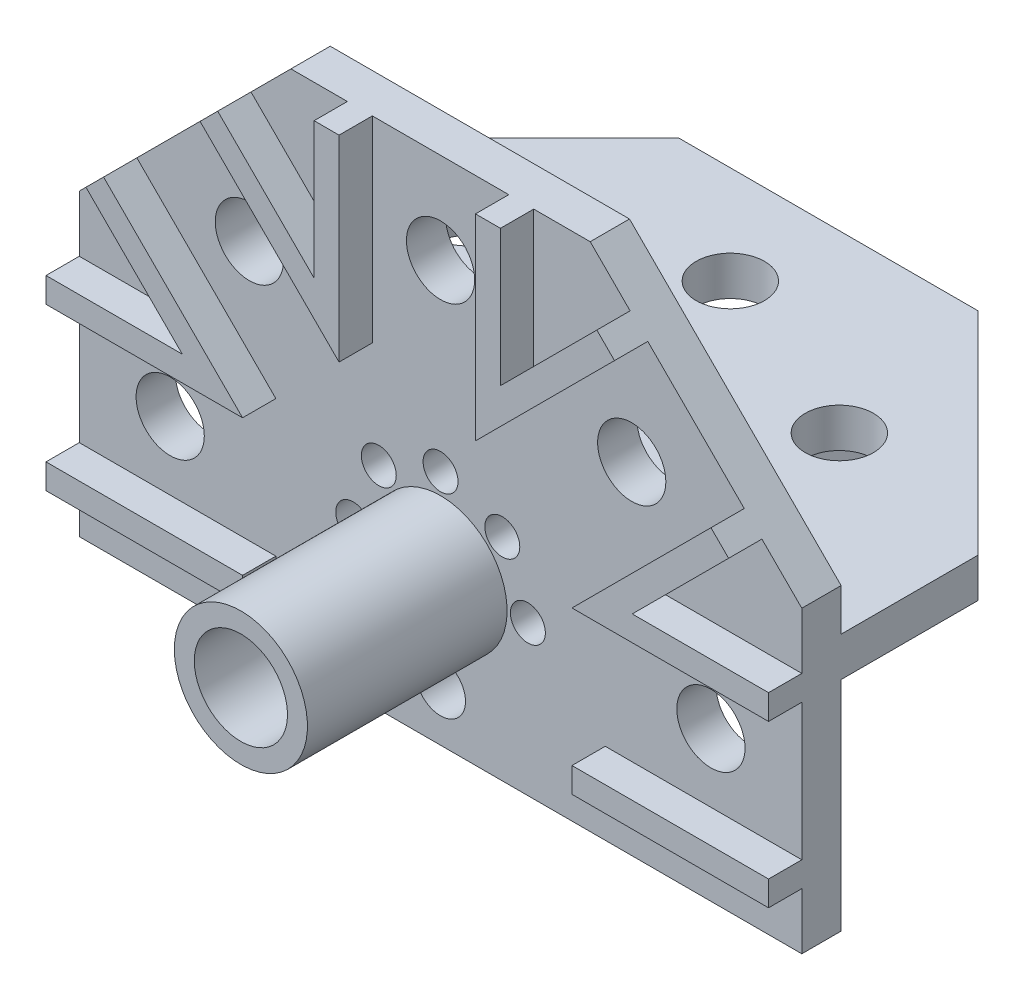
ISO-10303-21;
HEADER;
FILE_DESCRIPTION(('STEP AP214'),'2;1');
FILE_NAME('part.step','',(''),(''),'','','');
FILE_SCHEMA(('AUTOMOTIVE_DESIGN { 1 0 10303 214 1 1 1 1 }'));
ENDSEC;
DATA;
#1=APPLICATION_CONTEXT('core data for automotive mechanical design processes');
#2=APPLICATION_PROTOCOL_DEFINITION('international standard','automotive_design',2000,#1);
#3=PRODUCT_CONTEXT('',#1,'mechanical');
#4=PRODUCT('Part','Part','',(#3));
#5=PRODUCT_RELATED_PRODUCT_CATEGORY('part','',(#4));
#6=PRODUCT_DEFINITION_FORMATION('','',#4);
#7=PRODUCT_DEFINITION_CONTEXT('part definition',#1,'design');
#8=PRODUCT_DEFINITION('design','',#6,#7);
#9=PRODUCT_DEFINITION_SHAPE('','',#8);
#10=(LENGTH_UNIT() NAMED_UNIT(*) SI_UNIT(.MILLI.,.METRE.));
#11=(NAMED_UNIT(*) PLANE_ANGLE_UNIT() SI_UNIT($,.RADIAN.));
#12=(NAMED_UNIT(*) SI_UNIT($,.STERADIAN.) SOLID_ANGLE_UNIT());
#13=UNCERTAINTY_MEASURE_WITH_UNIT(LENGTH_MEASURE(1.E-05),#10,'distance_accuracy_value','');
#14=(GEOMETRIC_REPRESENTATION_CONTEXT(3) GLOBAL_UNCERTAINTY_ASSIGNED_CONTEXT((#13)) GLOBAL_UNIT_ASSIGNED_CONTEXT((#10,
#11,#12)) REPRESENTATION_CONTEXT('',''));
#15=CARTESIAN_POINT('',(0.,0.,0.));
#16=DIRECTION('',(0.,0.,1.));
#17=DIRECTION('',(1.,0.,0.));
#18=AXIS2_PLACEMENT_3D('',#15,#16,#17);
#19=CARTESIAN_POINT('',(27.575,16.6289389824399,-26.6));
#20=DIRECTION('',(0.,1.,0.));
#21=DIRECTION('',(0.,0.,1.));
#22=AXIS2_PLACEMENT_3D('',#19,#20,#21);
#23=PLANE('',#22);
#24=DIRECTION('',(0.707106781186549,0.,0.707106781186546));
#25=VECTOR('',#24,1.);
#26=CARTESIAN_POINT('',(-14.5791276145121,16.6289389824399,-23.4428113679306));
#27=LINE('',#26,#25);
#28=CARTESIAN_POINT('',(-14.5791276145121,16.6289389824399,-23.4428113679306));
#29=VERTEX_POINT('',#28);
#30=CARTESIAN_POINT('',(-6.95700000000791,16.6289389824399,-15.8206837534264));
#31=VERTEX_POINT('',#30);
#32=EDGE_CURVE('E1085',#29,#31,#27,.T.);
#33=ORIENTED_EDGE('',*,*,#32,.F.);
#34=DIRECTION('',(0.707106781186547,0.,-0.707106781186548));
#35=VECTOR('',#34,1.);
#36=CARTESIAN_POINT('',(-19.0109694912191,16.6289389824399,-19.0109694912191));
#37=LINE('',#36,#35);
#38=CARTESIAN_POINT('',(-11.4219389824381,16.6289389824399,-26.6));
#39=VERTEX_POINT('',#38);
#40=EDGE_CURVE('E462',#29,#39,#37,.T.);
#41=ORIENTED_EDGE('',*,*,#40,.T.);
#42=DIRECTION('',(-1.,0.,0.));
#43=VECTOR('',#42,1.);
#44=CARTESIAN_POINT('',(27.575,16.6289389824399,-26.6));
#45=LINE('',#44,#43);
#46=CARTESIAN_POINT('',(-6.95700000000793,16.6289389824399,-26.6));
#47=VERTEX_POINT('',#46);
#48=EDGE_CURVE('E605',#47,#39,#45,.T.);
#49=ORIENTED_EDGE('',*,*,#48,.F.);
#50=DIRECTION('',(0.,0.,-1.));
#51=VECTOR('',#50,1.);
#52=CARTESIAN_POINT('',(-6.95700000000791,16.6289389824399,-15.8206837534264));
#53=LINE('',#52,#51);
#54=EDGE_CURVE('E52',#31,#47,#53,.T.);
#55=ORIENTED_EDGE('',*,*,#54,.F.);
#56=EDGE_LOOP('',(#33,#41,#49,#55));
#57=FACE_BOUND('',#56,.T.);
#58=ADVANCED_FACE('F35',(#57),#23,.F.);
#59=CARTESIAN_POINT('',(-4.32332932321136,16.6289389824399,-3.35555697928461));
#60=DIRECTION('',(0.,-1.,0.));
#61=DIRECTION('',(0.,0.,-1.));
#62=AXIS2_PLACEMENT_3D('',#59,#60,#61);
#63=CIRCLE('',#62,1.275);
#64=CARTESIAN_POINT('',(-4.32332932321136,16.6289389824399,-4.63055697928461));
#65=VERTEX_POINT('',#64);
#66=EDGE_CURVE('E1314',#65,#65,#63,.T.);
#67=ORIENTED_EDGE('',*,*,#66,.F.);
#68=EDGE_LOOP('',(#67));
#69=FACE_BOUND('',#68,.T.);
#70=CARTESIAN_POINT('',(4.32332932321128,16.6289389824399,-3.35555697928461));
#71=DIRECTION('',(0.,-1.,0.));
#72=DIRECTION('',(0.,0.,-1.));
#73=AXIS2_PLACEMENT_3D('',#70,#71,#72);
#74=CIRCLE('',#73,1.275);
#75=CARTESIAN_POINT('',(4.32332932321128,16.6289389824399,-4.63055697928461));
#76=VERTEX_POINT('',#75);
#77=EDGE_CURVE('E1324',#76,#76,#74,.T.);
#78=ORIENTED_EDGE('',*,*,#77,.F.);
#79=EDGE_LOOP('',(#78));
#80=FACE_BOUND('',#79,.T.);
#81=CARTESIAN_POINT('',(0.,16.6289389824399,-5.14633861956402));
#82=DIRECTION('',(0.,-1.,0.));
#83=DIRECTION('',(0.,0.,-1.));
#84=AXIS2_PLACEMENT_3D('',#81,#82,#83);
#85=CIRCLE('',#84,1.275);
#86=CARTESIAN_POINT('',(0.,16.6289389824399,-6.42133861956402));
#87=VERTEX_POINT('',#86);
#88=EDGE_CURVE('E1313',#87,#87,#85,.T.);
#89=ORIENTED_EDGE('',*,*,#88,.F.);
#90=EDGE_LOOP('',(#89));
#91=FACE_BOUND('',#90,.T.);
#92=CARTESIAN_POINT('',(0.,16.6289389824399,-19.116338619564));
#93=DIRECTION('',(0.,-1.,0.));
#94=DIRECTION('',(0.,0.,-1.));
#95=AXIS2_PLACEMENT_3D('',#92,#93,#94);
#96=CIRCLE('',#95,2.6035);
#97=CARTESIAN_POINT('',(0.,16.6289389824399,-21.719838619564));
#98=VERTEX_POINT('',#97);
#99=EDGE_CURVE('E572',#98,#98,#96,.T.);
#100=ORIENTED_EDGE('',*,*,#99,.F.);
#101=EDGE_LOOP('',(#100));
#102=FACE_BOUND('',#101,.T.);
#103=CARTESIAN_POINT('',(14.2067217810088,16.6289389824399,-13.2317217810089));
#104=DIRECTION('',(0.,-1.,0.));
#105=DIRECTION('',(0.,0.,-1.));
#106=AXIS2_PLACEMENT_3D('',#103,#104,#105);
#107=CIRCLE('',#106,2.6035);
#108=CARTESIAN_POINT('',(14.2067217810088,16.6289389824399,-15.8352217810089));
#109=VERTEX_POINT('',#108);
#110=EDGE_CURVE('E571',#109,#109,#107,.T.);
#111=ORIENTED_EDGE('',*,*,#110,.F.);
#112=EDGE_LOOP('',(#111));
#113=FACE_BOUND('',#112,.T.);
#114=CARTESIAN_POINT('',(-14.2067217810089,16.6289389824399,-13.2317217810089));
#115=DIRECTION('',(0.,-1.,0.));
#116=DIRECTION('',(0.,0.,-1.));
#117=AXIS2_PLACEMENT_3D('',#114,#115,#116);
#118=CIRCLE('',#117,2.6035);
#119=CARTESIAN_POINT('',(-14.2067217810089,16.6289389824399,-15.8352217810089));
#120=VERTEX_POINT('',#119);
#121=EDGE_CURVE('E578',#120,#120,#118,.T.);
#122=ORIENTED_EDGE('',*,*,#121,.F.);
#123=EDGE_LOOP('',(#122));
#124=FACE_BOUND('',#123,.T.);
#125=DIRECTION('',(0.,0.,1.));
#126=VECTOR('',#125,1.);
#127=CARTESIAN_POINT('',(-5.2070000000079,16.6289389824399,-11.5958100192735));
#128=LINE('',#127,#126);
#129=CARTESIAN_POINT('',(-5.2070000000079,16.6289389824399,-26.6));
#130=VERTEX_POINT('',#129);
#131=CARTESIAN_POINT('',(-5.2070000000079,16.6289389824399,-11.5958100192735));
#132=VERTEX_POINT('',#131);
#133=EDGE_CURVE('E1094',#130,#132,#128,.T.);
#134=ORIENTED_EDGE('',*,*,#133,.F.);
#135=CARTESIAN_POINT('',(5.207,16.6289389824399,-26.6));
#136=VERTEX_POINT('',#135);
#137=EDGE_CURVE('E604',#136,#130,#45,.T.);
#138=ORIENTED_EDGE('',*,*,#137,.F.);
#139=DIRECTION('',(0.,0.,-1.));
#140=VECTOR('',#139,1.);
#141=CARTESIAN_POINT('',(5.207,16.6289389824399,-26.6));
#142=LINE('',#141,#140);
#143=CARTESIAN_POINT('',(5.207,16.6289389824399,-11.5958100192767));
#144=VERTEX_POINT('',#143);
#145=EDGE_CURVE('E533',#144,#136,#142,.T.);
#146=ORIENTED_EDGE('',*,*,#145,.F.);
#147=DIRECTION('',(-0.707106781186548,0.,0.707106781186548));
#148=VECTOR('',#147,1.);
#149=CARTESIAN_POINT('',(5.207,16.6289389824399,-11.5958100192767));
#150=LINE('',#149,#148);
#151=CARTESIAN_POINT('',(15.8165644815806,16.6289389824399,-22.2053745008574));
#152=VERTEX_POINT('',#151);
#153=EDGE_CURVE('E549',#152,#144,#150,.T.);
#154=ORIENTED_EDGE('',*,*,#153,.F.);
#155=DIRECTION('',(0.707106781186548,0.,0.707106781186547));
#156=VECTOR('',#155,1.);
#157=CARTESIAN_POINT('',(19.010969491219,16.6289389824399,-19.010969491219));
#158=LINE('',#157,#156);
#159=CARTESIAN_POINT('',(23.1803745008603,16.6289389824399,-14.8415644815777));
#160=VERTEX_POINT('',#159);
#161=EDGE_CURVE('E585',#152,#160,#158,.T.);
#162=ORIENTED_EDGE('',*,*,#161,.T.);
#163=DIRECTION('',(0.707106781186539,0.,-0.707106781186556));
#164=VECTOR('',#163,1.);
#165=CARTESIAN_POINT('',(23.180374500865,16.6289389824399,-14.8415644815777));
#166=LINE('',#165,#164);
#167=CARTESIAN_POINT('',(12.5708100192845,16.6289389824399,-4.23199999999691));
#168=VERTEX_POINT('',#167);
#169=EDGE_CURVE('E466',#168,#160,#166,.T.);
#170=ORIENTED_EDGE('',*,*,#169,.F.);
#171=DIRECTION('',(-0.707106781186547,0.,-0.707106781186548));
#172=VECTOR('',#171,1.);
#173=CARTESIAN_POINT('',(12.5708100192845,16.6289389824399,-4.23199999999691));
#174=LINE('',#173,#172);
#175=CARTESIAN_POINT('',(13.808246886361,16.6289389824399,-2.99456313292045));
#176=VERTEX_POINT('',#175);
#177=EDGE_CURVE('E463',#176,#168,#174,.T.);
#178=ORIENTED_EDGE('',*,*,#177,.F.);
#179=DIRECTION('',(-0.707106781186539,0.,0.707106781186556));
#180=VECTOR('',#179,1.);
#181=CARTESIAN_POINT('',(24.4178113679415,16.6289389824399,-13.6041276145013));
#182=LINE('',#181,#180);
#183=CARTESIAN_POINT('',(24.4178113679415,16.6289389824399,-13.6041276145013));
#184=VERTEX_POINT('',#183);
#185=EDGE_CURVE('E476',#184,#176,#182,.T.);
#186=ORIENTED_EDGE('',*,*,#185,.F.);
#187=CARTESIAN_POINT('',(27.575,16.6289389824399,-10.4469389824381));
#188=VERTEX_POINT('',#187);
#189=EDGE_CURVE('E586',#184,#188,#158,.T.);
#190=ORIENTED_EDGE('',*,*,#189,.T.);
#191=DIRECTION('',(0.,0.,1.));
#192=VECTOR('',#191,1.);
#193=CARTESIAN_POINT('',(27.575,16.6289389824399,-26.6));
#194=LINE('',#193,#192);
#195=CARTESIAN_POINT('',(27.575,16.6289389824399,0.));
#196=VERTEX_POINT('',#195);
#197=EDGE_CURVE('E619',#188,#196,#194,.T.);
#198=ORIENTED_EDGE('',*,*,#197,.T.);
#199=DIRECTION('',(-1.,0.,0.));
#200=VECTOR('',#199,1.);
#201=CARTESIAN_POINT('',(27.575,16.6289389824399,0.));
#202=LINE('',#201,#200);
#203=CARTESIAN_POINT('',(-27.575,16.6289389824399,0.));
#204=VERTEX_POINT('',#203);
#205=EDGE_CURVE('E599',#196,#204,#202,.T.);
#206=ORIENTED_EDGE('',*,*,#205,.T.);
#207=DIRECTION('',(0.,0.,1.));
#208=VECTOR('',#207,1.);
#209=CARTESIAN_POINT('',(-27.575,16.6289389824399,-26.6));
#210=LINE('',#209,#208);
#211=CARTESIAN_POINT('',(-27.575,16.6289389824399,-10.4469389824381));
#212=VERTEX_POINT('',#211);
#213=EDGE_CURVE('E617',#212,#204,#210,.T.);
#214=ORIENTED_EDGE('',*,*,#213,.F.);
#215=CARTESIAN_POINT('',(-24.417811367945,16.6289389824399,-13.6041276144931));
#216=VERTEX_POINT('',#215);
#217=EDGE_CURVE('E591',#212,#216,#37,.T.);
#218=ORIENTED_EDGE('',*,*,#217,.T.);
#219=DIRECTION('',(-0.70710678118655,0.,-0.707106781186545));
#220=VECTOR('',#219,1.);
#221=CARTESIAN_POINT('',(-16.7956837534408,16.6289389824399,-5.98199999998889));
#222=LINE('',#221,#220);
#223=CARTESIAN_POINT('',(-13.8082468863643,16.6289389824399,-2.99456313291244));
#224=VERTEX_POINT('',#223);
#225=EDGE_CURVE('E499',#224,#216,#222,.T.);
#226=ORIENTED_EDGE('',*,*,#225,.F.);
#227=DIRECTION('',(-0.707106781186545,0.,0.70710678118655));
#228=VECTOR('',#227,1.);
#229=CARTESIAN_POINT('',(-12.5708100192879,16.6289389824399,-4.23199999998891));
#230=LINE('',#229,#228);
#231=CARTESIAN_POINT('',(-12.5708100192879,16.6289389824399,-4.23199999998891));
#232=VERTEX_POINT('',#231);
#233=EDGE_CURVE('E503',#232,#224,#230,.T.);
#234=ORIENTED_EDGE('',*,*,#233,.F.);
#235=DIRECTION('',(0.70710678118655,0.,0.707106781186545));
#236=VECTOR('',#235,1.);
#237=CARTESIAN_POINT('',(-12.5708100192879,16.6289389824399,-4.23199999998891));
#238=LINE('',#237,#236);
#239=CARTESIAN_POINT('',(-23.1803745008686,16.6289389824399,-14.8415644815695));
#240=VERTEX_POINT('',#239);
#241=EDGE_CURVE('E512',#240,#232,#238,.T.);
#242=ORIENTED_EDGE('',*,*,#241,.F.);
#243=CARTESIAN_POINT('',(-15.8165644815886,16.6289389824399,-22.2053745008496));
#244=VERTEX_POINT('',#243);
#245=EDGE_CURVE('E594',#240,#244,#37,.T.);
#246=ORIENTED_EDGE('',*,*,#245,.T.);
#247=DIRECTION('',(-0.707106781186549,0.,-0.707106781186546));
#248=VECTOR('',#247,1.);
#249=CARTESIAN_POINT('',(-15.8165644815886,16.6289389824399,-22.2053745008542));
#250=LINE('',#249,#248);
#251=EDGE_CURVE('E60',#132,#244,#250,.T.);
#252=ORIENTED_EDGE('',*,*,#251,.F.);
#253=EDGE_LOOP('',(#134,#138,#146,#154,#162,#170,#178,#186,#190,#198,#206,#214,#218,#226,#234,
#242,#246,#252));
#254=FACE_BOUND('',#253,.T.);
#255=ADVANCED_FACE('F1014',(#69,#80,#91,#102,#113,#124,#254),#23,.F.);
#256=DIRECTION('',(0.,0.,1.));
#257=VECTOR('',#256,1.);
#258=CARTESIAN_POINT('',(6.957,16.6289389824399,-26.6));
#259=LINE('',#258,#257);
#260=CARTESIAN_POINT('',(6.957,16.6289389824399,-26.6));
#261=VERTEX_POINT('',#260);
#262=CARTESIAN_POINT('',(6.957,16.6289389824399,-15.8206837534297));
#263=VERTEX_POINT('',#262);
#264=EDGE_CURVE('E528',#261,#263,#259,.T.);
#265=ORIENTED_EDGE('',*,*,#264,.F.);
#266=CARTESIAN_POINT('',(11.421938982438,16.6289389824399,-26.6));
#267=VERTEX_POINT('',#266);
#268=EDGE_CURVE('E600',#267,#261,#45,.T.);
#269=ORIENTED_EDGE('',*,*,#268,.F.);
#270=CARTESIAN_POINT('',(14.5791276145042,16.6289389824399,-23.4428113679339));
#271=VERTEX_POINT('',#270);
#272=EDGE_CURVE('E582',#267,#271,#158,.T.);
#273=ORIENTED_EDGE('',*,*,#272,.T.);
#274=DIRECTION('',(0.707106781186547,0.,-0.707106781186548));
#275=VECTOR('',#274,1.);
#276=CARTESIAN_POINT('',(6.957,16.6289389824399,-15.8206837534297));
#277=LINE('',#276,#275);
#278=EDGE_CURVE('E546',#263,#271,#277,.T.);
#279=ORIENTED_EDGE('',*,*,#278,.F.);
#280=EDGE_LOOP('',(#265,#269,#273,#279));
#281=FACE_BOUND('',#280,.T.);
#282=ADVANCED_FACE('F1016',(#281),#23,.F.);
#283=CARTESIAN_POINT('',(27.575,19.6289389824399,-26.6));
#284=DIRECTION('',(0.,-1.,0.));
#285=DIRECTION('',(0.,0.,-1.));
#286=AXIS2_PLACEMENT_3D('',#283,#284,#285);
#287=PLANE('',#286);
#288=CARTESIAN_POINT('',(0.,19.6289389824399,-19.116338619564));
#289=DIRECTION('',(0.,-1.,0.));
#290=DIRECTION('',(0.,0.,-1.));
#291=AXIS2_PLACEMENT_3D('',#288,#289,#290);
#292=CIRCLE('',#291,2.6035);
#293=CARTESIAN_POINT('',(0.,19.6289389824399,-21.719838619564));
#294=VERTEX_POINT('',#293);
#295=EDGE_CURVE('E39',#294,#294,#292,.T.);
#296=ORIENTED_EDGE('',*,*,#295,.T.);
#297=EDGE_LOOP('',(#296));
#298=FACE_BOUND('',#297,.T.);
#299=CARTESIAN_POINT('',(14.2067217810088,19.6289389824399,-13.2317217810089));
#300=DIRECTION('',(0.,-1.,0.));
#301=DIRECTION('',(0.,0.,-1.));
#302=AXIS2_PLACEMENT_3D('',#299,#300,#301);
#303=CIRCLE('',#302,2.6035);
#304=CARTESIAN_POINT('',(14.2067217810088,19.6289389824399,-15.8352217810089));
#305=VERTEX_POINT('',#304);
#306=EDGE_CURVE('E575',#305,#305,#303,.T.);
#307=ORIENTED_EDGE('',*,*,#306,.T.);
#308=EDGE_LOOP('',(#307));
#309=FACE_BOUND('',#308,.T.);
#310=CARTESIAN_POINT('',(-14.2067217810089,19.6289389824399,-13.2317217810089));
#311=DIRECTION('',(0.,-1.,0.));
#312=DIRECTION('',(0.,0.,-1.));
#313=AXIS2_PLACEMENT_3D('',#310,#311,#312);
#314=CIRCLE('',#313,2.6035);
#315=CARTESIAN_POINT('',(-14.2067217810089,19.6289389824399,-15.8352217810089));
#316=VERTEX_POINT('',#315);
#317=EDGE_CURVE('E581',#316,#316,#314,.T.);
#318=ORIENTED_EDGE('',*,*,#317,.T.);
#319=EDGE_LOOP('',(#318));
#320=FACE_BOUND('',#319,.T.);
#321=DIRECTION('',(0.707106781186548,0.,0.707106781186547));
#322=VECTOR('',#321,1.);
#323=CARTESIAN_POINT('',(19.498469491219,19.6289389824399,-18.523469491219));
#324=LINE('',#323,#322);
#325=CARTESIAN_POINT('',(11.421938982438,19.6289389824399,-26.6));
#326=VERTEX_POINT('',#325);
#327=CARTESIAN_POINT('',(27.575,19.6289389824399,-10.446938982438));
#328=VERTEX_POINT('',#327);
#329=EDGE_CURVE('E589',#326,#328,#324,.T.);
#330=ORIENTED_EDGE('',*,*,#329,.F.);
#331=DIRECTION('',(1.,0.,0.));
#332=VECTOR('',#331,1.);
#333=CARTESIAN_POINT('',(27.575,19.6289389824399,-26.6));
#334=LINE('',#333,#332);
#335=CARTESIAN_POINT('',(-11.4219389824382,19.6289389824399,-26.6));
#336=VERTEX_POINT('',#335);
#337=EDGE_CURVE('E603',#336,#326,#334,.T.);
#338=ORIENTED_EDGE('',*,*,#337,.F.);
#339=DIRECTION('',(0.707106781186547,0.,-0.707106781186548));
#340=VECTOR('',#339,1.);
#341=CARTESIAN_POINT('',(8.07653050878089,19.6289389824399,-46.0984694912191));
#342=LINE('',#341,#340);
#343=CARTESIAN_POINT('',(-27.575,19.6289389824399,-10.4469389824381));
#344=VERTEX_POINT('',#343);
#345=EDGE_CURVE('E597',#344,#336,#342,.T.);
#346=ORIENTED_EDGE('',*,*,#345,.F.);
#347=DIRECTION('',(0.,0.,1.));
#348=VECTOR('',#347,1.);
#349=CARTESIAN_POINT('',(-27.575,19.6289389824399,-26.6));
#350=LINE('',#349,#348);
#351=CARTESIAN_POINT('',(-27.575,19.6289389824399,0.));
#352=VERTEX_POINT('',#351);
#353=EDGE_CURVE('E615',#344,#352,#350,.T.);
#354=ORIENTED_EDGE('',*,*,#353,.T.);
#355=DIRECTION('',(1.,0.,0.));
#356=VECTOR('',#355,1.);
#357=CARTESIAN_POINT('',(27.575,19.6289389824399,0.));
#358=LINE('',#357,#356);
#359=CARTESIAN_POINT('',(27.575,19.6289389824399,0.));
#360=VERTEX_POINT('',#359);
#361=EDGE_CURVE('E611',#352,#360,#358,.T.);
#362=ORIENTED_EDGE('',*,*,#361,.T.);
#363=DIRECTION('',(0.,0.,1.));
#364=VECTOR('',#363,1.);
#365=CARTESIAN_POINT('',(27.575,19.6289389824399,-26.6));
#366=LINE('',#365,#364);
#367=EDGE_CURVE('E608',#328,#360,#366,.T.);
#368=ORIENTED_EDGE('',*,*,#367,.F.);
#369=EDGE_LOOP('',(#330,#338,#346,#354,#362,#368));
#370=FACE_BOUND('',#369,.T.);
#371=ADVANCED_FACE('F995',(#298,#309,#320,#370),#287,.F.);
#372=CARTESIAN_POINT('',(0.,0.,-26.6));
#373=DIRECTION('',(0.,0.,1.));
#374=DIRECTION('',(1.,0.,0.));
#375=AXIS2_PLACEMENT_3D('',#372,#373,#374);
#376=PLANE('',#375);
#377=DIRECTION('',(0.,-1.,0.));
#378=VECTOR('',#377,1.);
#379=CARTESIAN_POINT('',(11.421938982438,38.9969389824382,-26.6));
#380=LINE('',#379,#378);
#381=EDGE_CURVE('E584',#326,#267,#380,.T.);
#382=ORIENTED_EDGE('',*,*,#381,.T.);
#383=ORIENTED_EDGE('',*,*,#268,.T.);
#384=DIRECTION('',(0.,1.,0.));
#385=VECTOR('',#384,1.);
#386=CARTESIAN_POINT('',(6.957,14.0889389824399,-26.6));
#387=LINE('',#386,#385);
#388=CARTESIAN_POINT('',(6.957,14.0889389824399,-26.6));
#389=VERTEX_POINT('',#388);
#390=EDGE_CURVE('E568',#389,#261,#387,.T.);
#391=ORIENTED_EDGE('',*,*,#390,.F.);
#392=DIRECTION('',(1.,0.,0.));
#393=VECTOR('',#392,1.);
#394=CARTESIAN_POINT('',(5.207,14.0889389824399,-26.6));
#395=LINE('',#394,#393);
#396=CARTESIAN_POINT('',(5.207,14.0889389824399,-26.6));
#397=VERTEX_POINT('',#396);
#398=EDGE_CURVE('E529',#397,#389,#395,.T.);
#399=ORIENTED_EDGE('',*,*,#398,.F.);
#400=DIRECTION('',(0.,1.,0.));
#401=VECTOR('',#400,1.);
#402=CARTESIAN_POINT('',(5.207,14.0889389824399,-26.6));
#403=LINE('',#402,#401);
#404=EDGE_CURVE('E543',#397,#136,#403,.T.);
#405=ORIENTED_EDGE('',*,*,#404,.T.);
#406=ORIENTED_EDGE('',*,*,#137,.T.);
#407=DIRECTION('',(0.,1.,0.));
#408=VECTOR('',#407,1.);
#409=CARTESIAN_POINT('',(-5.20700000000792,14.0889389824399,-26.5999999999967));
#410=LINE('',#409,#408);
#411=CARTESIAN_POINT('',(-5.20700000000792,14.0889389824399,-26.5999999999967));
#412=VERTEX_POINT('',#411);
#413=EDGE_CURVE('E1097',#412,#130,#410,.T.);
#414=ORIENTED_EDGE('',*,*,#413,.F.);
#415=DIRECTION('',(1.,0.,0.));
#416=VECTOR('',#415,1.);
#417=CARTESIAN_POINT('',(-6.95700000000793,14.0889389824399,-26.5999999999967));
#418=LINE('',#417,#416);
#419=CARTESIAN_POINT('',(-6.95700000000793,14.0889389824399,-26.5999999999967));
#420=VERTEX_POINT('',#419);
#421=EDGE_CURVE('E1106',#420,#412,#418,.T.);
#422=ORIENTED_EDGE('',*,*,#421,.F.);
#423=DIRECTION('',(0.,1.,0.));
#424=VECTOR('',#423,1.);
#425=CARTESIAN_POINT('',(-6.95700000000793,14.0889389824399,-26.5999999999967));
#426=LINE('',#425,#424);
#427=EDGE_CURVE('E468',#420,#47,#426,.T.);
#428=ORIENTED_EDGE('',*,*,#427,.T.);
#429=ORIENTED_EDGE('',*,*,#48,.T.);
#430=DIRECTION('',(0.,-1.,0.));
#431=VECTOR('',#430,1.);
#432=CARTESIAN_POINT('',(-11.4219389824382,0.,-26.6));
#433=LINE('',#432,#431);
#434=EDGE_CURVE('E44',#336,#39,#433,.T.);
#435=ORIENTED_EDGE('',*,*,#434,.F.);
#436=ORIENTED_EDGE('',*,*,#337,.T.);
#437=EDGE_LOOP('',(#382,#383,#391,#399,#405,#406,#414,#422,#428,#429,#435,#436));
#438=FACE_BOUND('',#437,.T.);
#439=ADVANCED_FACE('F1029',(#438),#376,.F.);
#440=CARTESIAN_POINT('',(27.575,22.8438779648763,3.));
#441=DIRECTION('',(-1.,0.,0.));
#442=DIRECTION('',(0.,-1.,0.));
#443=AXIS2_PLACEMENT_3D('',#440,#441,#442);
#444=PLANE('',#443);
#445=DIRECTION('',(0.,-1.,0.));
#446=VECTOR('',#445,1.);
#447=CARTESIAN_POINT('',(27.575,22.8438779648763,-10.446938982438));
#448=LINE('',#447,#446);
#449=EDGE_CURVE('E11',#328,#188,#448,.T.);
#450=ORIENTED_EDGE('',*,*,#449,.F.);
#451=ORIENTED_EDGE('',*,*,#367,.T.);
#452=DIRECTION('',(0.,1.,0.));
#453=VECTOR('',#452,1.);
#454=CARTESIAN_POINT('',(27.575,22.8438779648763,0.));
#455=LINE('',#454,#453);
#456=CARTESIAN_POINT('',(27.575,22.8438779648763,0.));
#457=VERTEX_POINT('',#456);
#458=EDGE_CURVE('E942',#360,#457,#455,.T.);
#459=ORIENTED_EDGE('',*,*,#458,.T.);
#460=DIRECTION('',(0.,0.,-1.));
#461=VECTOR('',#460,1.);
#462=CARTESIAN_POINT('',(27.575,22.8438779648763,3.));
#463=LINE('',#462,#461);
#464=CARTESIAN_POINT('',(27.575,22.8438779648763,3.));
#465=VERTEX_POINT('',#464);
#466=EDGE_CURVE('E960',#465,#457,#463,.T.);
#467=ORIENTED_EDGE('',*,*,#466,.F.);
#468=DIRECTION('',(0.,1.,0.));
#469=VECTOR('',#468,1.);
#470=CARTESIAN_POINT('',(27.575,22.8438779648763,3.));
#471=LINE('',#470,#469);
#472=CARTESIAN_POINT('',(27.575,18.5339389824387,3.));
#473=VERTEX_POINT('',#472);
#474=EDGE_CURVE('E920',#473,#465,#471,.T.);
#475=ORIENTED_EDGE('',*,*,#474,.F.);
#476=DIRECTION('',(0.,0.,-1.));
#477=VECTOR('',#476,1.);
#478=CARTESIAN_POINT('',(27.5750000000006,18.5339389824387,5.54));
#479=LINE('',#478,#477);
#480=CARTESIAN_POINT('',(27.5750000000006,18.5339389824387,5.54));
#481=VERTEX_POINT('',#480);
#482=EDGE_CURVE('E738',#481,#473,#479,.T.);
#483=ORIENTED_EDGE('',*,*,#482,.F.);
#484=DIRECTION('',(0.,1.,0.));
#485=VECTOR('',#484,1.);
#486=CARTESIAN_POINT('',(27.5750000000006,18.5339389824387,5.54));
#487=LINE('',#486,#485);
#488=CARTESIAN_POINT('',(27.5750000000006,16.6289389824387,5.54));
#489=VERTEX_POINT('',#488);
#490=EDGE_CURVE('E716',#489,#481,#487,.T.);
#491=ORIENTED_EDGE('',*,*,#490,.F.);
#492=DIRECTION('',(0.,0.,-1.));
#493=VECTOR('',#492,1.);
#494=CARTESIAN_POINT('',(27.5750000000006,16.6289389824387,5.54));
#495=LINE('',#494,#493);
#496=CARTESIAN_POINT('',(27.575,16.6289389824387,3.));
#497=VERTEX_POINT('',#496);
#498=EDGE_CURVE('E741',#489,#497,#495,.T.);
#499=ORIENTED_EDGE('',*,*,#498,.T.);
#500=CARTESIAN_POINT('',(27.5750000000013,6.2149389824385,3.));
#501=VERTEX_POINT('',#500);
#502=EDGE_CURVE('E924',#501,#497,#471,.T.);
#503=ORIENTED_EDGE('',*,*,#502,.F.);
#504=DIRECTION('',(0.,0.,-1.));
#505=VECTOR('',#504,1.);
#506=CARTESIAN_POINT('',(27.5750000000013,6.2149389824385,5.54));
#507=LINE('',#506,#505);
#508=CARTESIAN_POINT('',(27.5750000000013,6.2149389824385,5.54));
#509=VERTEX_POINT('',#508);
#510=EDGE_CURVE('E773',#509,#501,#507,.T.);
#511=ORIENTED_EDGE('',*,*,#510,.F.);
#512=DIRECTION('',(0.,1.,0.));
#513=VECTOR('',#512,1.);
#514=CARTESIAN_POINT('',(27.5750000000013,4.3099389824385,5.54));
#515=LINE('',#514,#513);
#516=CARTESIAN_POINT('',(27.5750000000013,4.3099389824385,5.54));
#517=VERTEX_POINT('',#516);
#518=EDGE_CURVE('E753',#517,#509,#515,.T.);
#519=ORIENTED_EDGE('',*,*,#518,.F.);
#520=DIRECTION('',(0.,0.,-1.));
#521=VECTOR('',#520,1.);
#522=CARTESIAN_POINT('',(27.5750000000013,4.3099389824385,5.54));
#523=LINE('',#522,#521);
#524=CARTESIAN_POINT('',(27.575,4.30993898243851,3.));
#525=VERTEX_POINT('',#524);
#526=EDGE_CURVE('E776',#517,#525,#523,.T.);
#527=ORIENTED_EDGE('',*,*,#526,.T.);
#528=CARTESIAN_POINT('',(27.575,0.,3.));
#529=VERTEX_POINT('',#528);
#530=EDGE_CURVE('E921',#529,#525,#471,.T.);
#531=ORIENTED_EDGE('',*,*,#530,.F.);
#532=DIRECTION('',(0.,0.,-1.));
#533=VECTOR('',#532,1.);
#534=CARTESIAN_POINT('',(27.575,0.,3.));
#535=LINE('',#534,#533);
#536=CARTESIAN_POINT('',(27.575,0.,0.));
#537=VERTEX_POINT('',#536);
#538=EDGE_CURVE('E963',#529,#537,#535,.T.);
#539=ORIENTED_EDGE('',*,*,#538,.T.);
#540=EDGE_CURVE('E943',#537,#196,#455,.T.);
#541=ORIENTED_EDGE('',*,*,#540,.T.);
#542=ORIENTED_EDGE('',*,*,#197,.F.);
#543=EDGE_LOOP('',(#450,#451,#459,#467,#475,#483,#491,#499,#503,#511,#519,#527,#531,#539,#541,#542));
#544=FACE_BOUND('',#543,.T.);
#545=ADVANCED_FACE('F1064',(#544),#444,.F.);
#546=CARTESIAN_POINT('',(-27.575,0.,3.));
#547=DIRECTION('',(1.,0.,0.));
#548=DIRECTION('',(0.,1.,0.));
#549=AXIS2_PLACEMENT_3D('',#546,#547,#548);
#550=PLANE('',#549);
#551=DIRECTION('',(0.,-1.,0.));
#552=VECTOR('',#551,1.);
#553=CARTESIAN_POINT('',(-27.575,38.9969389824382,-10.4469389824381));
#554=LINE('',#553,#552);
#555=EDGE_CURVE('E593',#344,#212,#554,.T.);
#556=ORIENTED_EDGE('',*,*,#555,.T.);
#557=ORIENTED_EDGE('',*,*,#213,.T.);
#558=DIRECTION('',(0.,-1.,0.));
#559=VECTOR('',#558,1.);
#560=CARTESIAN_POINT('',(-27.575,0.,0.));
#561=LINE('',#560,#559);
#562=CARTESIAN_POINT('',(-27.575,0.,0.));
#563=VERTEX_POINT('',#562);
#564=EDGE_CURVE('E913',#204,#563,#561,.T.);
#565=ORIENTED_EDGE('',*,*,#564,.T.);
#566=DIRECTION('',(0.,0.,-1.));
#567=VECTOR('',#566,1.);
#568=CARTESIAN_POINT('',(-27.575,0.,3.));
#569=LINE('',#568,#567);
#570=CARTESIAN_POINT('',(-27.575,0.,3.));
#571=VERTEX_POINT('',#570);
#572=EDGE_CURVE('E966',#571,#563,#569,.T.);
#573=ORIENTED_EDGE('',*,*,#572,.F.);
#574=DIRECTION('',(0.,-1.,0.));
#575=VECTOR('',#574,1.);
#576=CARTESIAN_POINT('',(-27.575,0.,3.));
#577=LINE('',#576,#575);
#578=CARTESIAN_POINT('',(-27.5749999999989,4.30993898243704,3.));
#579=VERTEX_POINT('',#578);
#580=EDGE_CURVE('E918',#579,#571,#577,.T.);
#581=ORIENTED_EDGE('',*,*,#580,.F.);
#582=DIRECTION('',(0.,0.,-1.));
#583=VECTOR('',#582,1.);
#584=CARTESIAN_POINT('',(-27.5749999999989,4.30993898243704,5.54));
#585=LINE('',#584,#583);
#586=CARTESIAN_POINT('',(-27.5749999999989,4.30993898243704,5.54));
#587=VERTEX_POINT('',#586);
#588=EDGE_CURVE('E791',#587,#579,#585,.T.);
#589=ORIENTED_EDGE('',*,*,#588,.F.);
#590=DIRECTION('',(0.,-1.,0.));
#591=VECTOR('',#590,1.);
#592=CARTESIAN_POINT('',(-27.5749999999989,4.30993898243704,5.54));
#593=LINE('',#592,#591);
#594=CARTESIAN_POINT('',(-27.5749999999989,6.21493898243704,5.54));
#595=VERTEX_POINT('',#594);
#596=EDGE_CURVE('E788',#595,#587,#593,.T.);
#597=ORIENTED_EDGE('',*,*,#596,.F.);
#598=DIRECTION('',(0.,0.,-1.));
#599=VECTOR('',#598,1.);
#600=CARTESIAN_POINT('',(-27.5749999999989,6.21493898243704,5.54));
#601=LINE('',#600,#599);
#602=CARTESIAN_POINT('',(-27.575,6.21493898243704,3.));
#603=VERTEX_POINT('',#602);
#604=EDGE_CURVE('E801',#595,#603,#601,.T.);
#605=ORIENTED_EDGE('',*,*,#604,.T.);
#606=CARTESIAN_POINT('',(-27.575,16.6289389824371,3.));
#607=VERTEX_POINT('',#606);
#608=EDGE_CURVE('E917',#607,#603,#577,.T.);
#609=ORIENTED_EDGE('',*,*,#608,.F.);
#610=DIRECTION('',(0.,0.,-1.));
#611=VECTOR('',#610,1.);
#612=CARTESIAN_POINT('',(-27.5749999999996,16.6289389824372,5.54));
#613=LINE('',#612,#611);
#614=CARTESIAN_POINT('',(-27.5749999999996,16.6289389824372,5.54));
#615=VERTEX_POINT('',#614);
#616=EDGE_CURVE('E704',#615,#607,#613,.T.);
#617=ORIENTED_EDGE('',*,*,#616,.F.);
#618=DIRECTION('',(0.,-1.,0.));
#619=VECTOR('',#618,1.);
#620=CARTESIAN_POINT('',(-27.5749999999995,18.5339389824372,5.54));
#621=LINE('',#620,#619);
#622=CARTESIAN_POINT('',(-27.5749999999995,18.5339389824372,5.54));
#623=VERTEX_POINT('',#622);
#624=EDGE_CURVE('E665',#623,#615,#621,.T.);
#625=ORIENTED_EDGE('',*,*,#624,.F.);
#626=DIRECTION('',(0.,0.,-1.));
#627=VECTOR('',#626,1.);
#628=CARTESIAN_POINT('',(-27.5749999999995,18.5339389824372,5.54));
#629=LINE('',#628,#627);
#630=CARTESIAN_POINT('',(-27.575,18.5339389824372,3.));
#631=VERTEX_POINT('',#630);
#632=EDGE_CURVE('E679',#623,#631,#629,.T.);
#633=ORIENTED_EDGE('',*,*,#632,.T.);
#634=CARTESIAN_POINT('',(-27.575,22.8438779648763,3.));
#635=VERTEX_POINT('',#634);
#636=EDGE_CURVE('E914',#635,#631,#577,.T.);
#637=ORIENTED_EDGE('',*,*,#636,.F.);
#638=DIRECTION('',(0.,0.,-1.));
#639=VECTOR('',#638,1.);
#640=CARTESIAN_POINT('',(-27.575,22.8438779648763,3.));
#641=LINE('',#640,#639);
#642=CARTESIAN_POINT('',(-27.575,22.8438779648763,0.));
#643=VERTEX_POINT('',#642);
#644=EDGE_CURVE('E935',#635,#643,#641,.T.);
#645=ORIENTED_EDGE('',*,*,#644,.T.);
#646=EDGE_CURVE('E937',#643,#352,#561,.T.);
#647=ORIENTED_EDGE('',*,*,#646,.T.);
#648=ORIENTED_EDGE('',*,*,#353,.F.);
#649=EDGE_LOOP('',(#556,#557,#565,#573,#581,#589,#597,#605,#609,#617,#625,#633,#637,#645,#647,#648));
#650=FACE_BOUND('',#649,.T.);
#651=ADVANCED_FACE('F37',(#650),#550,.F.);
#652=CARTESIAN_POINT('',(0.,0.,0.));
#653=DIRECTION('',(0.,0.,-1.));
#654=DIRECTION('',(-1.,0.,0.));
#655=AXIS2_PLACEMENT_3D('',#652,#653,#654);
#656=PLANE('',#655);
#657=ORIENTED_EDGE('',*,*,#361,.F.);
#658=ORIENTED_EDGE('',*,*,#646,.F.);
#659=DIRECTION('',(-0.707106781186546,-0.707106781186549,0.));
#660=VECTOR('',#659,1.);
#661=CARTESIAN_POINT('',(-27.575,22.8438779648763,0.));
#662=LINE('',#661,#660);
#663=CARTESIAN_POINT('',(-11.4219389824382,38.9969389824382,0.));
#664=VERTEX_POINT('',#663);
#665=EDGE_CURVE('E950',#664,#643,#662,.T.);
#666=ORIENTED_EDGE('',*,*,#665,.F.);
#667=DIRECTION('',(-1.,0.,0.));
#668=VECTOR('',#667,1.);
#669=CARTESIAN_POINT('',(-11.4219389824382,38.9969389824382,0.));
#670=LINE('',#669,#668);
#671=CARTESIAN_POINT('',(11.4219389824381,38.9969389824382,0.));
#672=VERTEX_POINT('',#671);
#673=EDGE_CURVE('E948',#672,#664,#670,.T.);
#674=ORIENTED_EDGE('',*,*,#673,.F.);
#675=DIRECTION('',(-0.707106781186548,0.707106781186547,0.));
#676=VECTOR('',#675,1.);
#677=CARTESIAN_POINT('',(11.4219389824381,38.9969389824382,0.));
#678=LINE('',#677,#676);
#679=EDGE_CURVE('E946',#457,#672,#678,.T.);
#680=ORIENTED_EDGE('',*,*,#679,.F.);
#681=ORIENTED_EDGE('',*,*,#458,.F.);
#682=EDGE_LOOP('',(#657,#658,#666,#674,#680,#681));
#683=FACE_BOUND('',#682,.T.);
#684=CARTESIAN_POINT('',(14.5921575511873,26.0140965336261,0.));
#685=DIRECTION('',(0.,0.,-1.));
#686=DIRECTION('',(-1.,0.,0.));
#687=AXIS2_PLACEMENT_3D('',#684,#685,#686);
#688=CIRCLE('',#687,2.6035);
#689=CARTESIAN_POINT('',(11.9886575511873,26.0140965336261,0.));
#690=VERTEX_POINT('',#689);
#691=EDGE_CURVE('E857',#690,#690,#688,.T.);
#692=ORIENTED_EDGE('',*,*,#691,.F.);
#693=EDGE_LOOP('',(#692));
#694=FACE_BOUND('',#693,.T.);
#695=CARTESIAN_POINT('',(-1.50573997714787E-12,32.0583660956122,0.));
#696=DIRECTION('',(0.,0.,-1.));
#697=DIRECTION('',(-1.,0.,0.));
#698=AXIS2_PLACEMENT_3D('',#695,#696,#697);
#699=CIRCLE('',#698,2.60350000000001);
#700=CARTESIAN_POINT('',(-2.60350000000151,32.0583660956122,0.));
#701=VERTEX_POINT('',#700);
#702=EDGE_CURVE('E976',#701,#701,#699,.T.);
#703=ORIENTED_EDGE('',*,*,#702,.F.);
#704=EDGE_LOOP('',(#703));
#705=FACE_BOUND('',#704,.T.);
#706=CARTESIAN_POINT('',(-14.5921575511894,26.014096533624,0.));
#707=DIRECTION('',(0.,0.,-1.));
#708=DIRECTION('',(-1.,0.,0.));
#709=AXIS2_PLACEMENT_3D('',#706,#707,#708);
#710=CIRCLE('',#709,2.6035);
#711=CARTESIAN_POINT('',(-17.1956575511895,26.014096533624,0.));
#712=VERTEX_POINT('',#711);
#713=EDGE_CURVE('E979',#712,#712,#710,.T.);
#714=ORIENTED_EDGE('',*,*,#713,.F.);
#715=EDGE_LOOP('',(#714));
#716=FACE_BOUND('',#715,.T.);
#717=ADVANCED_FACE('F1360',(#683,#694,#705,#716),#656,.T.);
#718=CARTESIAN_POINT('',(0.,0.,3.));
#719=DIRECTION('',(0.,0.,-1.));
#720=DIRECTION('',(-1.,0.,0.));
#721=AXIS2_PLACEMENT_3D('',#718,#719,#720);
#722=PLANE('',#721);
#723=CARTESIAN_POINT('',(0.,3.84938680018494,3.));
#724=DIRECTION('',(0.,0.,1.));
#725=DIRECTION('',(1.,0.,0.));
#726=AXIS2_PLACEMENT_3D('',#723,#724,#725);
#727=CIRCLE('',#726,1.905);
#728=CARTESIAN_POINT('',(1.90499999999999,3.84938680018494,3.));
#729=VERTEX_POINT('',#728);
#730=EDGE_CURVE('E854',#729,#729,#727,.T.);
#731=ORIENTED_EDGE('',*,*,#730,.F.);
#732=EDGE_LOOP('',(#731));
#733=FACE_BOUND('',#732,.T.);
#734=CARTESIAN_POINT('',(-20.6364271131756,11.4219389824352,3.));
#735=DIRECTION('',(0.,0.,1.));
#736=DIRECTION('',(1.,0.,0.));
#737=AXIS2_PLACEMENT_3D('',#734,#735,#736);
#738=CIRCLE('',#737,2.60350000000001);
#739=CARTESIAN_POINT('',(-18.0329271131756,11.4219389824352,3.));
#740=VERTEX_POINT('',#739);
#741=EDGE_CURVE('E858',#740,#740,#738,.T.);
#742=ORIENTED_EDGE('',*,*,#741,.F.);
#743=EDGE_LOOP('',(#742));
#744=FACE_BOUND('',#743,.T.);
#745=CARTESIAN_POINT('',(-14.5921575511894,26.014096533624,3.));
#746=DIRECTION('',(0.,0.,1.));
#747=DIRECTION('',(1.,0.,0.));
#748=AXIS2_PLACEMENT_3D('',#745,#746,#747);
#749=CIRCLE('',#748,2.6035);
#750=CARTESIAN_POINT('',(-11.9886575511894,26.014096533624,3.));
#751=VERTEX_POINT('',#750);
#752=EDGE_CURVE('E861',#751,#751,#749,.T.);
#753=ORIENTED_EDGE('',*,*,#752,.F.);
#754=EDGE_LOOP('',(#753));
#755=FACE_BOUND('',#754,.T.);
#756=CARTESIAN_POINT('',(-1.50573997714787E-12,32.0583660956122,3.));
#757=DIRECTION('',(0.,0.,1.));
#758=DIRECTION('',(1.,0.,0.));
#759=AXIS2_PLACEMENT_3D('',#756,#757,#758);
#760=CIRCLE('',#759,2.60350000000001);
#761=CARTESIAN_POINT('',(2.6034999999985,32.0583660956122,3.));
#762=VERTEX_POINT('',#761);
#763=EDGE_CURVE('E864',#762,#762,#760,.T.);
#764=ORIENTED_EDGE('',*,*,#763,.F.);
#765=EDGE_LOOP('',(#764));
#766=FACE_BOUND('',#765,.T.);
#767=CARTESIAN_POINT('',(14.5921575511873,26.0140965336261,3.));
#768=DIRECTION('',(0.,0.,1.));
#769=DIRECTION('',(1.,0.,0.));
#770=AXIS2_PLACEMENT_3D('',#767,#768,#769);
#771=CIRCLE('',#770,2.6035);
#772=CARTESIAN_POINT('',(17.1956575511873,26.0140965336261,3.));
#773=VERTEX_POINT('',#772);
#774=EDGE_CURVE('E853',#773,#773,#771,.T.);
#775=ORIENTED_EDGE('',*,*,#774,.F.);
#776=EDGE_LOOP('',(#775));
#777=FACE_BOUND('',#776,.T.);
#778=CARTESIAN_POINT('',(20.6364271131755,11.4219389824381,3.));
#779=DIRECTION('',(0.,0.,1.));
#780=DIRECTION('',(1.,0.,0.));
#781=AXIS2_PLACEMENT_3D('',#778,#779,#780);
#782=CIRCLE('',#781,2.6035);
#783=CARTESIAN_POINT('',(23.2399271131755,11.4219389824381,3.));
#784=VERTEX_POINT('',#783);
#785=EDGE_CURVE('E869',#784,#784,#782,.T.);
#786=ORIENTED_EDGE('',*,*,#785,.F.);
#787=EDGE_LOOP('',(#786));
#788=FACE_BOUND('',#787,.T.);
#789=CARTESIAN_POINT('',(-6.6664271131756,11.4219389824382,3.));
#790=DIRECTION('',(0.,0.,1.));
#791=DIRECTION('',(1.,0.,0.));
#792=AXIS2_PLACEMENT_3D('',#789,#790,#791);
#793=CIRCLE('',#792,1.3335);
#794=CARTESIAN_POINT('',(-5.3329271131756,11.4219389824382,3.));
#795=VERTEX_POINT('',#794);
#796=EDGE_CURVE('E878',#795,#795,#793,.T.);
#797=ORIENTED_EDGE('',*,*,#796,.F.);
#798=EDGE_LOOP('',(#797));
#799=FACE_BOUND('',#798,.T.);
#800=CARTESIAN_POINT('',(-4.7138758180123,16.1358148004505,3.));
#801=DIRECTION('',(0.,0.,1.));
#802=DIRECTION('',(1.,0.,0.));
#803=AXIS2_PLACEMENT_3D('',#800,#801,#802);
#804=CIRCLE('',#803,1.3335);
#805=CARTESIAN_POINT('',(-3.3803758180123,16.1358148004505,3.));
#806=VERTEX_POINT('',#805);
#807=EDGE_CURVE('E884',#806,#806,#804,.T.);
#808=ORIENTED_EDGE('',*,*,#807,.F.);
#809=EDGE_LOOP('',(#808));
#810=FACE_BOUND('',#809,.T.);
#811=CARTESIAN_POINT('',(0.,18.0883660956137,3.));
#812=DIRECTION('',(0.,0.,1.));
#813=DIRECTION('',(1.,0.,0.));
#814=AXIS2_PLACEMENT_3D('',#811,#812,#813);
#815=CIRCLE('',#814,1.3335);
#816=CARTESIAN_POINT('',(1.33350000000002,18.0883660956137,3.));
#817=VERTEX_POINT('',#816);
#818=EDGE_CURVE('E890',#817,#817,#815,.T.);
#819=ORIENTED_EDGE('',*,*,#818,.F.);
#820=EDGE_LOOP('',(#819));
#821=FACE_BOUND('',#820,.T.);
#822=CARTESIAN_POINT('',(4.71387581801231,16.1358148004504,3.));
#823=DIRECTION('',(0.,0.,1.));
#824=DIRECTION('',(1.,0.,0.));
#825=AXIS2_PLACEMENT_3D('',#822,#823,#824);
#826=CIRCLE('',#825,1.3335);
#827=CARTESIAN_POINT('',(6.04737581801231,16.1358148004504,3.));
#828=VERTEX_POINT('',#827);
#829=EDGE_CURVE('E896',#828,#828,#826,.T.);
#830=ORIENTED_EDGE('',*,*,#829,.F.);
#831=EDGE_LOOP('',(#830));
#832=FACE_BOUND('',#831,.T.);
#833=CARTESIAN_POINT('',(6.66642711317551,11.4219389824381,3.));
#834=DIRECTION('',(0.,0.,1.));
#835=DIRECTION('',(1.,0.,0.));
#836=AXIS2_PLACEMENT_3D('',#833,#834,#835);
#837=CIRCLE('',#836,1.3335);
#838=CARTESIAN_POINT('',(7.99992711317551,11.4219389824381,3.));
#839=VERTEX_POINT('',#838);
#840=EDGE_CURVE('E877',#839,#839,#837,.T.);
#841=ORIENTED_EDGE('',*,*,#840,.F.);
#842=EDGE_LOOP('',(#841));
#843=FACE_BOUND('',#842,.T.);
#844=CARTESIAN_POINT('',(0.,11.4219389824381,3.));
#845=DIRECTION('',(0.,0.,-1.));
#846=DIRECTION('',(-1.,0.,0.));
#847=AXIS2_PLACEMENT_3D('',#844,#845,#846);
#848=CIRCLE('',#847,5.08);
#849=CARTESIAN_POINT('',(-5.08000000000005,11.4219389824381,3.));
#850=VERTEX_POINT('',#849);
#851=EDGE_CURVE('E969',#850,#850,#848,.F.);
#852=ORIENTED_EDGE('',*,*,#851,.F.);
#853=EDGE_LOOP('',(#852));
#854=FACE_BOUND('',#853,.T.);
#855=DIRECTION('',(0.707106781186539,-0.707106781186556,0.));
#856=VECTOR('',#855,1.);
#857=CARTESIAN_POINT('',(-15.8165644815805,34.6023134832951,3.));
#858=LINE('',#857,#856);
#859=CARTESIAN_POINT('',(-15.8165644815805,34.6023134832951,3.));
#860=VERTEX_POINT('',#859);
#861=CARTESIAN_POINT('',(-5.20699999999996,23.9927490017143,3.));
#862=VERTEX_POINT('',#861);
#863=EDGE_CURVE('E621',#860,#862,#858,.T.);
#864=ORIENTED_EDGE('',*,*,#863,.F.);
#865=DIRECTION('',(-0.707106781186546,-0.707106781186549,0.));
#866=VECTOR('',#865,1.);
#867=CARTESIAN_POINT('',(-27.575,22.8438779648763,3.));
#868=LINE('',#867,#866);
#869=CARTESIAN_POINT('',(-23.1803745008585,27.2385034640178,3.));
#870=VERTEX_POINT('',#869);
#871=EDGE_CURVE('E936',#860,#870,#868,.T.);
#872=ORIENTED_EDGE('',*,*,#871,.T.);
#873=DIRECTION('',(-0.707106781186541,0.707106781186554,0.));
#874=VECTOR('',#873,1.);
#875=CARTESIAN_POINT('',(-12.5708100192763,16.6289389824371,3.));
#876=LINE('',#875,#874);
#877=CARTESIAN_POINT('',(-12.5708100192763,16.6289389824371,3.));
#878=VERTEX_POINT('',#877);
#879=EDGE_CURVE('E682',#878,#870,#876,.T.);
#880=ORIENTED_EDGE('',*,*,#879,.F.);
#881=DIRECTION('',(1.,0.,0.));
#882=VECTOR('',#881,1.);
#883=CARTESIAN_POINT('',(-27.5749999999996,16.6289389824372,3.));
#884=LINE('',#883,#882);
#885=EDGE_CURVE('E664',#607,#878,#884,.T.);
#886=ORIENTED_EDGE('',*,*,#885,.F.);
#887=ORIENTED_EDGE('',*,*,#608,.T.);
#888=DIRECTION('',(-1.,0.,0.));
#889=VECTOR('',#888,1.);
#890=CARTESIAN_POINT('',(-12.5708100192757,6.21493898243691,3.));
#891=LINE('',#890,#889);
#892=CARTESIAN_POINT('',(-12.5708100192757,6.21493898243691,3.));
#893=VERTEX_POINT('',#892);
#894=EDGE_CURVE('E794',#893,#603,#891,.T.);
#895=ORIENTED_EDGE('',*,*,#894,.F.);
#896=DIRECTION('',(0.,1.,0.));
#897=VECTOR('',#896,1.);
#898=CARTESIAN_POINT('',(-12.5708100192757,6.21493898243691,3.));
#899=LINE('',#898,#897);
#900=CARTESIAN_POINT('',(-12.5708100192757,4.30993898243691,3.));
#901=VERTEX_POINT('',#900);
#902=EDGE_CURVE('E779',#901,#893,#899,.T.);
#903=ORIENTED_EDGE('',*,*,#902,.F.);
#904=DIRECTION('',(1.,0.,0.));
#905=VECTOR('',#904,1.);
#906=CARTESIAN_POINT('',(-17.1698868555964,4.30993898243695,3.));
#907=LINE('',#906,#905);
#908=EDGE_CURVE('E784',#579,#901,#907,.T.);
#909=ORIENTED_EDGE('',*,*,#908,.F.);
#910=ORIENTED_EDGE('',*,*,#580,.T.);
#911=DIRECTION('',(1.,0.,0.));
#912=VECTOR('',#911,1.);
#913=CARTESIAN_POINT('',(-27.575,0.,3.));
#914=LINE('',#913,#912);
#915=EDGE_CURVE('E916',#571,#529,#914,.T.);
#916=ORIENTED_EDGE('',*,*,#915,.T.);
#917=ORIENTED_EDGE('',*,*,#530,.T.);
#918=DIRECTION('',(1.,0.,0.));
#919=VECTOR('',#918,1.);
#920=CARTESIAN_POINT('',(27.5750000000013,4.3099389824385,3.));
#921=LINE('',#920,#919);
#922=CARTESIAN_POINT('',(12.570810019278,4.30993898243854,3.));
#923=VERTEX_POINT('',#922);
#924=EDGE_CURVE('E750',#923,#525,#921,.T.);
#925=ORIENTED_EDGE('',*,*,#924,.F.);
#926=DIRECTION('',(0.,-1.,0.));
#927=VECTOR('',#926,1.);
#928=CARTESIAN_POINT('',(12.570810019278,6.21493898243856,3.));
#929=LINE('',#928,#927);
#930=CARTESIAN_POINT('',(12.570810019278,6.21493898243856,3.));
#931=VERTEX_POINT('',#930);
#932=EDGE_CURVE('E754',#931,#923,#929,.T.);
#933=ORIENTED_EDGE('',*,*,#932,.F.);
#934=DIRECTION('',(-1.,0.,0.));
#935=VECTOR('',#934,1.);
#936=CARTESIAN_POINT('',(27.5750000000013,6.2149389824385,3.));
#937=LINE('',#936,#935);
#938=EDGE_CURVE('E763',#501,#931,#937,.T.);
#939=ORIENTED_EDGE('',*,*,#938,.F.);
#940=ORIENTED_EDGE('',*,*,#502,.T.);
#941=DIRECTION('',(1.,0.,0.));
#942=VECTOR('',#941,1.);
#943=CARTESIAN_POINT('',(12.5708100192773,16.6289389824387,3.));
#944=LINE('',#943,#942);
#945=CARTESIAN_POINT('',(12.5708100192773,16.6289389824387,3.));
#946=VERTEX_POINT('',#945);
#947=EDGE_CURVE('E725',#946,#497,#944,.T.);
#948=ORIENTED_EDGE('',*,*,#947,.F.);
#949=DIRECTION('',(-0.707106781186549,-0.707106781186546,0.));
#950=VECTOR('',#949,1.);
#951=CARTESIAN_POINT('',(23.180374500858,27.2385034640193,3.));
#952=LINE('',#951,#950);
#953=CARTESIAN_POINT('',(23.180374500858,27.2385034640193,3.));
#954=VERTEX_POINT('',#953);
#955=EDGE_CURVE('E707',#954,#946,#952,.T.);
#956=ORIENTED_EDGE('',*,*,#955,.F.);
#957=DIRECTION('',(-0.707106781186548,0.707106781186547,0.));
#958=VECTOR('',#957,1.);
#959=CARTESIAN_POINT('',(11.4219389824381,38.9969389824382,3.));
#960=LINE('',#959,#958);
#961=CARTESIAN_POINT('',(15.8165644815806,34.6023134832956,3.));
#962=VERTEX_POINT('',#961);
#963=EDGE_CURVE('E928',#954,#962,#960,.T.);
#964=ORIENTED_EDGE('',*,*,#963,.T.);
#965=DIRECTION('',(0.707106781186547,0.707106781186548,0.));
#966=VECTOR('',#965,1.);
#967=CARTESIAN_POINT('',(5.207,23.992749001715,3.));
#968=LINE('',#967,#966);
#969=CARTESIAN_POINT('',(5.207,23.992749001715,3.));
#970=VERTEX_POINT('',#969);
#971=EDGE_CURVE('E828',#970,#962,#968,.T.);
#972=ORIENTED_EDGE('',*,*,#971,.F.);
#973=DIRECTION('',(0.,-1.,0.));
#974=VECTOR('',#973,1.);
#975=CARTESIAN_POINT('',(5.207,38.9969389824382,3.));
#976=LINE('',#975,#974);
#977=CARTESIAN_POINT('',(5.207,38.9969389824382,3.));
#978=VERTEX_POINT('',#977);
#979=EDGE_CURVE('E810',#978,#970,#976,.T.);
#980=ORIENTED_EDGE('',*,*,#979,.F.);
#981=DIRECTION('',(-1.,0.,0.));
#982=VECTOR('',#981,1.);
#983=CARTESIAN_POINT('',(-11.4219389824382,38.9969389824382,3.));
#984=LINE('',#983,#982);
#985=CARTESIAN_POINT('',(-5.20699999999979,38.9969389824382,3.));
#986=VERTEX_POINT('',#985);
#987=EDGE_CURVE('E932',#978,#986,#984,.T.);
#988=ORIENTED_EDGE('',*,*,#987,.T.);
#989=DIRECTION('',(0.,1.,0.));
#990=VECTOR('',#989,1.);
#991=CARTESIAN_POINT('',(-5.20699999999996,23.9927490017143,3.));
#992=LINE('',#991,#990);
#993=EDGE_CURVE('E639',#862,#986,#992,.T.);
#994=ORIENTED_EDGE('',*,*,#993,.F.);
#995=EDGE_LOOP('',(#864,#872,#880,#886,#887,#895,#903,#909,#910,#916,#917,#925,#933,#939,#940,
#948,#956,#964,#972,#980,#988,#994));
#996=FACE_BOUND('',#995,.T.);
#997=ADVANCED_FACE('F1384',(#733,#744,#755,#766,#777,#788,#799,#810,#821,#832,#843,#854,#996),
#722,.F.);
#998=DIRECTION('',(0.,-1.,0.));
#999=VECTOR('',#998,1.);
#1000=CARTESIAN_POINT('',(-7.11199999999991,28.5918258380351,3.));
#1001=LINE('',#1000,#999);
#1002=CARTESIAN_POINT('',(-7.11199999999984,38.9969389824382,3.));
#1003=VERTEX_POINT('',#1002);
#1004=CARTESIAN_POINT('',(-7.11199999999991,28.5918258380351,3.));
#1005=VERTEX_POINT('',#1004);
#1006=EDGE_CURVE('E642',#1003,#1005,#1001,.T.);
#1007=ORIENTED_EDGE('',*,*,#1006,.F.);
#1008=CARTESIAN_POINT('',(-11.4219389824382,38.9969389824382,3.));
#1009=VERTEX_POINT('',#1008);
#1010=EDGE_CURVE('E927',#1003,#1009,#984,.T.);
#1011=ORIENTED_EDGE('',*,*,#1010,.T.);
#1012=CARTESIAN_POINT('',(-14.4695260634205,35.9493519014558,3.));
#1013=VERTEX_POINT('',#1012);
#1014=EDGE_CURVE('E933',#1009,#1013,#868,.T.);
#1015=ORIENTED_EDGE('',*,*,#1014,.T.);
#1016=DIRECTION('',(-0.707106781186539,0.707106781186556,0.));
#1017=VECTOR('',#1016,1.);
#1018=CARTESIAN_POINT('',(-14.4695260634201,35.9493519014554,3.));
#1019=LINE('',#1018,#1017);
#1020=EDGE_CURVE('E626',#1005,#1013,#1019,.T.);
#1021=ORIENTED_EDGE('',*,*,#1020,.F.);
#1022=EDGE_LOOP('',(#1007,#1011,#1015,#1021));
#1023=FACE_BOUND('',#1022,.T.);
#1024=ADVANCED_FACE('F1504',(#1023),#722,.F.);
#1025=DIRECTION('',(0.70710678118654,-0.707106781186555,0.));
#1026=VECTOR('',#1025,1.);
#1027=CARTESIAN_POINT('',(-17.169886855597,18.5339389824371,3.));
#1028=LINE('',#1027,#1026);
#1029=CARTESIAN_POINT('',(-24.5274129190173,25.8914650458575,3.));
#1030=VERTEX_POINT('',#1029);
#1031=CARTESIAN_POINT('',(-17.169886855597,18.5339389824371,3.));
#1032=VERTEX_POINT('',#1031);
#1033=EDGE_CURVE('E685',#1030,#1032,#1028,.T.);
#1034=ORIENTED_EDGE('',*,*,#1033,.F.);
#1035=EDGE_CURVE('E931',#1030,#635,#868,.T.);
#1036=ORIENTED_EDGE('',*,*,#1035,.T.);
#1037=ORIENTED_EDGE('',*,*,#636,.T.);
#1038=DIRECTION('',(-1.,0.,0.));
#1039=VECTOR('',#1038,1.);
#1040=CARTESIAN_POINT('',(-27.5749999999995,18.5339389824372,3.));
#1041=LINE('',#1040,#1039);
#1042=EDGE_CURVE('E669',#1032,#631,#1041,.T.);
#1043=ORIENTED_EDGE('',*,*,#1042,.F.);
#1044=EDGE_LOOP('',(#1034,#1036,#1037,#1043));
#1045=FACE_BOUND('',#1044,.T.);
#1046=ADVANCED_FACE('F1534',(#1045),#722,.F.);
#1047=DIRECTION('',(-1.,0.,0.));
#1048=VECTOR('',#1047,1.);
#1049=CARTESIAN_POINT('',(17.1698868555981,18.5339389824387,3.));
#1050=LINE('',#1049,#1048);
#1051=CARTESIAN_POINT('',(17.1698868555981,18.5339389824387,3.));
#1052=VERTEX_POINT('',#1051);
#1053=EDGE_CURVE('E728',#473,#1052,#1050,.T.);
#1054=ORIENTED_EDGE('',*,*,#1053,.F.);
#1055=ORIENTED_EDGE('',*,*,#474,.T.);
#1056=CARTESIAN_POINT('',(24.5274129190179,25.8914650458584,3.));
#1057=VERTEX_POINT('',#1056);
#1058=EDGE_CURVE('E925',#465,#1057,#960,.T.);
#1059=ORIENTED_EDGE('',*,*,#1058,.T.);
#1060=DIRECTION('',(0.707106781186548,0.707106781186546,0.));
#1061=VECTOR('',#1060,1.);
#1062=CARTESIAN_POINT('',(24.5274129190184,25.891465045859,3.));
#1063=LINE('',#1062,#1061);
#1064=EDGE_CURVE('E712',#1052,#1057,#1063,.T.);
#1065=ORIENTED_EDGE('',*,*,#1064,.F.);
#1066=EDGE_LOOP('',(#1054,#1055,#1059,#1065));
#1067=FACE_BOUND('',#1066,.T.);
#1068=ADVANCED_FACE('F1374',(#1067),#722,.F.);
#1069=DIRECTION('',(-0.707106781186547,-0.707106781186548,0.));
#1070=VECTOR('',#1069,1.);
#1071=CARTESIAN_POINT('',(7.112,28.5918258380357,3.));
#1072=LINE('',#1071,#1070);
#1073=CARTESIAN_POINT('',(14.4695260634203,35.949351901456,3.));
#1074=VERTEX_POINT('',#1073);
#1075=CARTESIAN_POINT('',(7.112,28.5918258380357,3.));
#1076=VERTEX_POINT('',#1075);
#1077=EDGE_CURVE('E831',#1074,#1076,#1072,.T.);
#1078=ORIENTED_EDGE('',*,*,#1077,.F.);
#1079=CARTESIAN_POINT('',(11.4219389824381,38.9969389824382,3.));
#1080=VERTEX_POINT('',#1079);
#1081=EDGE_CURVE('E923',#1074,#1080,#960,.T.);
#1082=ORIENTED_EDGE('',*,*,#1081,.T.);
#1083=CARTESIAN_POINT('',(7.112,38.9969389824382,3.));
#1084=VERTEX_POINT('',#1083);
#1085=EDGE_CURVE('E929',#1080,#1084,#984,.T.);
#1086=ORIENTED_EDGE('',*,*,#1085,.T.);
#1087=DIRECTION('',(0.,1.,0.));
#1088=VECTOR('',#1087,1.);
#1089=CARTESIAN_POINT('',(7.112,38.9969389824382,3.));
#1090=LINE('',#1089,#1088);
#1091=EDGE_CURVE('E815',#1076,#1084,#1090,.T.);
#1092=ORIENTED_EDGE('',*,*,#1091,.F.);
#1093=EDGE_LOOP('',(#1078,#1082,#1086,#1092));
#1094=FACE_BOUND('',#1093,.T.);
#1095=ADVANCED_FACE('F1366',(#1094),#722,.F.);
#1096=CARTESIAN_POINT('',(-27.575,0.,3.));
#1097=DIRECTION('',(0.,1.,0.));
#1098=DIRECTION('',(-1.,0.,0.));
#1099=AXIS2_PLACEMENT_3D('',#1096,#1097,#1098);
#1100=PLANE('',#1099);
#1101=DIRECTION('',(1.,0.,0.));
#1102=VECTOR('',#1101,1.);
#1103=CARTESIAN_POINT('',(-27.575,0.,0.));
#1104=LINE('',#1103,#1102);
#1105=EDGE_CURVE('E940',#563,#537,#1104,.T.);
#1106=ORIENTED_EDGE('',*,*,#1105,.T.);
#1107=ORIENTED_EDGE('',*,*,#538,.F.);
#1108=ORIENTED_EDGE('',*,*,#915,.F.);
#1109=ORIENTED_EDGE('',*,*,#572,.T.);
#1110=EDGE_LOOP('',(#1106,#1107,#1108,#1109));
#1111=FACE_BOUND('',#1110,.T.);
#1112=ADVANCED_FACE('F1364',(#1111),#1100,.F.);
#1113=CARTESIAN_POINT('',(11.4219389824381,38.9969389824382,3.));
#1114=DIRECTION('',(-0.707106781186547,-0.707106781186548,0.));
#1115=DIRECTION('',(0.707106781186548,-0.707106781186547,0.));
#1116=AXIS2_PLACEMENT_3D('',#1113,#1114,#1115);
#1117=PLANE('',#1116);
#1118=ORIENTED_EDGE('',*,*,#679,.T.);
#1119=DIRECTION('',(0.,0.,-1.));
#1120=VECTOR('',#1119,1.);
#1121=CARTESIAN_POINT('',(11.4219389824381,38.9969389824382,3.));
#1122=LINE('',#1121,#1120);
#1123=EDGE_CURVE('E957',#1080,#672,#1122,.T.);
#1124=ORIENTED_EDGE('',*,*,#1123,.F.);
#1125=ORIENTED_EDGE('',*,*,#1081,.F.);
#1126=DIRECTION('',(0.,0.,-1.));
#1127=VECTOR('',#1126,1.);
#1128=CARTESIAN_POINT('',(14.4695260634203,35.949351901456,5.54));
#1129=LINE('',#1128,#1127);
#1130=CARTESIAN_POINT('',(14.4695260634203,35.949351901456,5.54));
#1131=VERTEX_POINT('',#1130);
#1132=EDGE_CURVE('E841',#1131,#1074,#1129,.T.);
#1133=ORIENTED_EDGE('',*,*,#1132,.F.);
#1134=DIRECTION('',(-0.707106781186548,0.707106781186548,0.));
#1135=VECTOR('',#1134,1.);
#1136=CARTESIAN_POINT('',(14.4695260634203,35.949351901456,5.54));
#1137=LINE('',#1136,#1135);
#1138=CARTESIAN_POINT('',(15.8165644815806,34.6023134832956,5.54));
#1139=VERTEX_POINT('',#1138);
#1140=EDGE_CURVE('E819',#1139,#1131,#1137,.T.);
#1141=ORIENTED_EDGE('',*,*,#1140,.F.);
#1142=DIRECTION('',(0.,0.,-1.));
#1143=VECTOR('',#1142,1.);
#1144=CARTESIAN_POINT('',(15.8165644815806,34.6023134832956,5.54));
#1145=LINE('',#1144,#1143);
#1146=EDGE_CURVE('E844',#1139,#962,#1145,.T.);
#1147=ORIENTED_EDGE('',*,*,#1146,.T.);
#1148=ORIENTED_EDGE('',*,*,#963,.F.);
#1149=DIRECTION('',(0.,0.,-1.));
#1150=VECTOR('',#1149,1.);
#1151=CARTESIAN_POINT('',(23.180374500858,27.2385034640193,5.54));
#1152=LINE('',#1151,#1150);
#1153=CARTESIAN_POINT('',(23.180374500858,27.2385034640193,5.54));
#1154=VERTEX_POINT('',#1153);
#1155=EDGE_CURVE('E747',#1154,#954,#1152,.T.);
#1156=ORIENTED_EDGE('',*,*,#1155,.F.);
#1157=DIRECTION('',(-0.707106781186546,0.707106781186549,0.));
#1158=VECTOR('',#1157,1.);
#1159=CARTESIAN_POINT('',(24.5274129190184,25.891465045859,5.54));
#1160=LINE('',#1159,#1158);
#1161=CARTESIAN_POINT('',(24.5274129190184,25.891465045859,5.54));
#1162=VERTEX_POINT('',#1161);
#1163=EDGE_CURVE('E708',#1162,#1154,#1160,.T.);
#1164=ORIENTED_EDGE('',*,*,#1163,.F.);
#1165=DIRECTION('',(0.,0.,-1.));
#1166=VECTOR('',#1165,1.);
#1167=CARTESIAN_POINT('',(24.5274129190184,25.891465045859,5.54));
#1168=LINE('',#1167,#1166);
#1169=EDGE_CURVE('E722',#1162,#1057,#1168,.T.);
#1170=ORIENTED_EDGE('',*,*,#1169,.T.);
#1171=ORIENTED_EDGE('',*,*,#1058,.F.);
#1172=ORIENTED_EDGE('',*,*,#466,.T.);
#1173=EDGE_LOOP('',(#1118,#1124,#1125,#1133,#1141,#1147,#1148,#1156,#1164,#1170,#1171,#1172));
#1174=FACE_BOUND('',#1173,.T.);
#1175=ADVANCED_FACE('F1362',(#1174),#1117,.F.);
#1176=CARTESIAN_POINT('',(-11.4219389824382,38.9969389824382,3.));
#1177=DIRECTION('',(0.,-1.,0.));
#1178=DIRECTION('',(1.,0.,0.));
#1179=AXIS2_PLACEMENT_3D('',#1176,#1177,#1178);
#1180=PLANE('',#1179);
#1181=ORIENTED_EDGE('',*,*,#673,.T.);
#1182=DIRECTION('',(0.,0.,-1.));
#1183=VECTOR('',#1182,1.);
#1184=CARTESIAN_POINT('',(-11.4219389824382,38.9969389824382,3.));
#1185=LINE('',#1184,#1183);
#1186=EDGE_CURVE('E954',#1009,#664,#1185,.T.);
#1187=ORIENTED_EDGE('',*,*,#1186,.F.);
#1188=ORIENTED_EDGE('',*,*,#1010,.F.);
#1189=DIRECTION('',(0.,0.,-1.));
#1190=VECTOR('',#1189,1.);
#1191=CARTESIAN_POINT('',(-7.11199999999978,38.9969389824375,5.54));
#1192=LINE('',#1191,#1190);
#1193=CARTESIAN_POINT('',(-7.11199999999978,38.9969389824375,5.54));
#1194=VERTEX_POINT('',#1193);
#1195=EDGE_CURVE('E652',#1194,#1003,#1192,.T.);
#1196=ORIENTED_EDGE('',*,*,#1195,.F.);
#1197=DIRECTION('',(-1.,0.,0.));
#1198=VECTOR('',#1197,1.);
#1199=CARTESIAN_POINT('',(-7.11199999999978,38.9969389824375,5.54));
#1200=LINE('',#1199,#1198);
#1201=CARTESIAN_POINT('',(-5.20699999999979,38.9969389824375,5.54));
#1202=VERTEX_POINT('',#1201);
#1203=EDGE_CURVE('E630',#1202,#1194,#1200,.T.);
#1204=ORIENTED_EDGE('',*,*,#1203,.F.);
#1205=DIRECTION('',(0.,0.,-1.));
#1206=VECTOR('',#1205,1.);
#1207=CARTESIAN_POINT('',(-5.20699999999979,38.9969389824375,5.54));
#1208=LINE('',#1207,#1206);
#1209=EDGE_CURVE('E655',#1202,#986,#1208,.T.);
#1210=ORIENTED_EDGE('',*,*,#1209,.T.);
#1211=ORIENTED_EDGE('',*,*,#987,.F.);
#1212=DIRECTION('',(0.,0.,-1.));
#1213=VECTOR('',#1212,1.);
#1214=CARTESIAN_POINT('',(5.207,38.9969389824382,5.54));
#1215=LINE('',#1214,#1213);
#1216=CARTESIAN_POINT('',(5.207,38.9969389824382,5.54));
#1217=VERTEX_POINT('',#1216);
#1218=EDGE_CURVE('E850',#1217,#978,#1215,.T.);
#1219=ORIENTED_EDGE('',*,*,#1218,.F.);
#1220=DIRECTION('',(-1.,0.,0.));
#1221=VECTOR('',#1220,1.);
#1222=CARTESIAN_POINT('',(7.112,38.9969389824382,5.54));
#1223=LINE('',#1222,#1221);
#1224=CARTESIAN_POINT('',(7.112,38.9969389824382,5.54));
#1225=VERTEX_POINT('',#1224);
#1226=EDGE_CURVE('E811',#1225,#1217,#1223,.T.);
#1227=ORIENTED_EDGE('',*,*,#1226,.F.);
#1228=DIRECTION('',(0.,0.,-1.));
#1229=VECTOR('',#1228,1.);
#1230=CARTESIAN_POINT('',(7.112,38.9969389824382,5.54));
#1231=LINE('',#1230,#1229);
#1232=EDGE_CURVE('E825',#1225,#1084,#1231,.T.);
#1233=ORIENTED_EDGE('',*,*,#1232,.T.);
#1234=ORIENTED_EDGE('',*,*,#1085,.F.);
#1235=ORIENTED_EDGE('',*,*,#1123,.T.);
#1236=EDGE_LOOP('',(#1181,#1187,#1188,#1196,#1204,#1210,#1211,#1219,#1227,#1233,#1234,#1235));
#1237=FACE_BOUND('',#1236,.T.);
#1238=ADVANCED_FACE('F1372',(#1237),#1180,.F.);
#1239=CARTESIAN_POINT('',(-27.575,22.8438779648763,3.));
#1240=DIRECTION('',(0.707106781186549,-0.707106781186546,0.));
#1241=DIRECTION('',(0.707106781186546,0.707106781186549,0.));
#1242=AXIS2_PLACEMENT_3D('',#1239,#1240,#1241);
#1243=PLANE('',#1242);
#1244=ORIENTED_EDGE('',*,*,#665,.T.);
#1245=ORIENTED_EDGE('',*,*,#644,.F.);
#1246=ORIENTED_EDGE('',*,*,#1035,.F.);
#1247=DIRECTION('',(0.,0.,-1.));
#1248=VECTOR('',#1247,1.);
#1249=CARTESIAN_POINT('',(-24.5274129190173,25.8914650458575,5.54));
#1250=LINE('',#1249,#1248);
#1251=CARTESIAN_POINT('',(-24.5274129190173,25.8914650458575,5.54));
#1252=VERTEX_POINT('',#1251);
#1253=EDGE_CURVE('E695',#1252,#1030,#1250,.T.);
#1254=ORIENTED_EDGE('',*,*,#1253,.F.);
#1255=DIRECTION('',(-0.707106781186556,-0.707106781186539,0.));
#1256=VECTOR('',#1255,1.);
#1257=CARTESIAN_POINT('',(-24.5274129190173,25.8914650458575,5.54));
#1258=LINE('',#1257,#1256);
#1259=CARTESIAN_POINT('',(-23.1803745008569,27.2385034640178,5.54));
#1260=VERTEX_POINT('',#1259);
#1261=EDGE_CURVE('E673',#1260,#1252,#1258,.T.);
#1262=ORIENTED_EDGE('',*,*,#1261,.F.);
#1263=DIRECTION('',(0.,0.,-1.));
#1264=VECTOR('',#1263,1.);
#1265=CARTESIAN_POINT('',(-23.1803745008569,27.2385034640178,5.54));
#1266=LINE('',#1265,#1264);
#1267=EDGE_CURVE('E698',#1260,#870,#1266,.T.);
#1268=ORIENTED_EDGE('',*,*,#1267,.T.);
#1269=ORIENTED_EDGE('',*,*,#871,.F.);
#1270=DIRECTION('',(0.,0.,-1.));
#1271=VECTOR('',#1270,1.);
#1272=CARTESIAN_POINT('',(-15.8165644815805,34.6023134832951,5.54));
#1273=LINE('',#1272,#1271);
#1274=CARTESIAN_POINT('',(-15.8165644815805,34.6023134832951,5.54));
#1275=VERTEX_POINT('',#1274);
#1276=EDGE_CURVE('E661',#1275,#860,#1273,.T.);
#1277=ORIENTED_EDGE('',*,*,#1276,.F.);
#1278=DIRECTION('',(-0.707106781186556,-0.707106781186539,0.));
#1279=VECTOR('',#1278,1.);
#1280=CARTESIAN_POINT('',(-14.4695260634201,35.9493519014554,5.54));
#1281=LINE('',#1280,#1279);
#1282=CARTESIAN_POINT('',(-14.4695260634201,35.9493519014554,5.54));
#1283=VERTEX_POINT('',#1282);
#1284=EDGE_CURVE('E622',#1283,#1275,#1281,.T.);
#1285=ORIENTED_EDGE('',*,*,#1284,.F.);
#1286=DIRECTION('',(0.,0.,-1.));
#1287=VECTOR('',#1286,1.);
#1288=CARTESIAN_POINT('',(-14.4695260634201,35.9493519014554,5.54));
#1289=LINE('',#1288,#1287);
#1290=EDGE_CURVE('E636',#1283,#1013,#1289,.T.);
#1291=ORIENTED_EDGE('',*,*,#1290,.T.);
#1292=ORIENTED_EDGE('',*,*,#1014,.F.);
#1293=ORIENTED_EDGE('',*,*,#1186,.T.);
#1294=EDGE_LOOP('',(#1244,#1245,#1246,#1254,#1262,#1268,#1269,#1277,#1285,#1291,#1292,#1293));
#1295=FACE_BOUND('',#1294,.T.);
#1296=ADVANCED_FACE('F1508',(#1295),#1243,.F.);
#1297=ORIENTED_EDGE('',*,*,#205,.F.);
#1298=ORIENTED_EDGE('',*,*,#540,.F.);
#1299=ORIENTED_EDGE('',*,*,#1105,.F.);
#1300=ORIENTED_EDGE('',*,*,#564,.F.);
#1301=EDGE_LOOP('',(#1297,#1298,#1299,#1300));
#1302=FACE_BOUND('',#1301,.T.);
#1303=CARTESIAN_POINT('',(0.,3.84938680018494,0.));
#1304=DIRECTION('',(0.,0.,-1.));
#1305=DIRECTION('',(-1.,0.,0.));
#1306=AXIS2_PLACEMENT_3D('',#1303,#1304,#1305);
#1307=CIRCLE('',#1306,1.905);
#1308=CARTESIAN_POINT('',(-1.90500000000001,3.84938680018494,0.));
#1309=VERTEX_POINT('',#1308);
#1310=EDGE_CURVE('E873',#1309,#1309,#1307,.T.);
#1311=ORIENTED_EDGE('',*,*,#1310,.F.);
#1312=EDGE_LOOP('',(#1311));
#1313=FACE_BOUND('',#1312,.T.);
#1314=CARTESIAN_POINT('',(-20.6364271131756,11.4219389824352,0.));
#1315=DIRECTION('',(0.,0.,-1.));
#1316=DIRECTION('',(-1.,0.,0.));
#1317=AXIS2_PLACEMENT_3D('',#1314,#1315,#1316);
#1318=CIRCLE('',#1317,2.60350000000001);
#1319=CARTESIAN_POINT('',(-23.2399271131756,11.4219389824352,0.));
#1320=VERTEX_POINT('',#1319);
#1321=EDGE_CURVE('E982',#1320,#1320,#1318,.T.);
#1322=ORIENTED_EDGE('',*,*,#1321,.F.);
#1323=EDGE_LOOP('',(#1322));
#1324=FACE_BOUND('',#1323,.T.);
#1325=CARTESIAN_POINT('',(20.6364271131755,11.4219389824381,0.));
#1326=DIRECTION('',(0.,0.,-1.));
#1327=DIRECTION('',(-1.,0.,0.));
#1328=AXIS2_PLACEMENT_3D('',#1325,#1326,#1327);
#1329=CIRCLE('',#1328,2.6035);
#1330=CARTESIAN_POINT('',(18.0329271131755,11.4219389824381,0.));
#1331=VERTEX_POINT('',#1330);
#1332=EDGE_CURVE('E872',#1331,#1331,#1329,.T.);
#1333=ORIENTED_EDGE('',*,*,#1332,.F.);
#1334=EDGE_LOOP('',(#1333));
#1335=FACE_BOUND('',#1334,.T.);
#1336=ADVANCED_FACE('F1070',(#1302,#1313,#1324,#1335),#656,.T.);
#1337=CARTESIAN_POINT('',(0.,11.4219389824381,18.24));
#1338=DIRECTION('',(0.,0.,1.));
#1339=DIRECTION('',(1.,0.,0.));
#1340=AXIS2_PLACEMENT_3D('',#1337,#1338,#1339);
#1341=PLANE('',#1340);
#1342=CARTESIAN_POINT('',(0.,11.4219389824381,18.24));
#1343=DIRECTION('',(0.,0.,1.));
#1344=DIRECTION('',(1.,0.,0.));
#1345=AXIS2_PLACEMENT_3D('',#1342,#1343,#1344);
#1346=CIRCLE('',#1345,5.08);
#1347=CARTESIAN_POINT('',(-5.08000000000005,11.4219389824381,18.24));
#1348=VERTEX_POINT('',#1347);
#1349=EDGE_CURVE('E908',#1348,#1348,#1346,.T.);
#1350=ORIENTED_EDGE('',*,*,#1349,.T.);
#1351=EDGE_LOOP('',(#1350));
#1352=FACE_BOUND('',#1351,.T.);
#1353=CARTESIAN_POINT('',(0.,11.4219389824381,18.24));
#1354=DIRECTION('',(0.,0.,1.));
#1355=DIRECTION('',(1.,0.,0.));
#1356=AXIS2_PLACEMENT_3D('',#1353,#1354,#1355);
#1357=CIRCLE('',#1356,3.556);
#1358=CARTESIAN_POINT('',(-3.55600000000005,11.4219389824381,18.24));
#1359=VERTEX_POINT('',#1358);
#1360=EDGE_CURVE('E905',#1359,#1359,#1357,.T.);
#1361=ORIENTED_EDGE('',*,*,#1360,.F.);
#1362=EDGE_LOOP('',(#1361));
#1363=FACE_BOUND('',#1362,.T.);
#1364=ADVANCED_FACE('F1496',(#1352,#1363),#1341,.T.);
#1365=CARTESIAN_POINT('',(0.,11.4219389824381,18.24));
#1366=DIRECTION('',(0.,0.,-1.));
#1367=DIRECTION('',(-1.,0.,0.));
#1368=AXIS2_PLACEMENT_3D('',#1365,#1366,#1367);
#1369=CYLINDRICAL_SURFACE('',#1368,5.08);
#1370=CARTESIAN_POINT('',(-5.08000000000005,11.4219389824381,18.24));
#1371=CARTESIAN_POINT('',(-5.08000000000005,11.4219389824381,18.08125));
#1372=CARTESIAN_POINT('',(-5.08000000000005,11.4219389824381,17.9225));
#1373=CARTESIAN_POINT('',(-5.08000000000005,11.4219389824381,17.605));
#1374=CARTESIAN_POINT('',(-5.08000000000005,11.4219389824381,17.44625));
#1375=CARTESIAN_POINT('',(-5.08000000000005,11.4219389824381,17.12875));
#1376=CARTESIAN_POINT('',(-5.08000000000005,11.4219389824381,16.97));
#1377=CARTESIAN_POINT('',(-5.08000000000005,11.4219389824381,16.6525));
#1378=CARTESIAN_POINT('',(-5.08000000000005,11.4219389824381,16.49375));
#1379=CARTESIAN_POINT('',(-5.08000000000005,11.4219389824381,16.17625));
#1380=CARTESIAN_POINT('',(-5.08000000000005,11.4219389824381,16.0175));
#1381=CARTESIAN_POINT('',(-5.08000000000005,11.4219389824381,15.7));
#1382=CARTESIAN_POINT('',(-5.08000000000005,11.4219389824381,15.54125));
#1383=CARTESIAN_POINT('',(-5.08000000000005,11.4219389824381,15.22375));
#1384=CARTESIAN_POINT('',(-5.08000000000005,11.4219389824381,15.065));
#1385=CARTESIAN_POINT('',(-5.08000000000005,11.4219389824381,14.7475));
#1386=CARTESIAN_POINT('',(-5.08000000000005,11.4219389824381,14.58875));
#1387=CARTESIAN_POINT('',(-5.08000000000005,11.4219389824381,14.27125));
#1388=CARTESIAN_POINT('',(-5.08000000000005,11.4219389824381,14.1125));
#1389=CARTESIAN_POINT('',(-5.08000000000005,11.4219389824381,13.795));
#1390=CARTESIAN_POINT('',(-5.08000000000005,11.4219389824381,13.63625));
#1391=CARTESIAN_POINT('',(-5.08000000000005,11.4219389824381,13.31875));
#1392=CARTESIAN_POINT('',(-5.08000000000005,11.4219389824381,13.16));
#1393=CARTESIAN_POINT('',(-5.08000000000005,11.4219389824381,12.8425));
#1394=CARTESIAN_POINT('',(-5.08000000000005,11.4219389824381,12.68375));
#1395=CARTESIAN_POINT('',(-5.08000000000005,11.4219389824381,12.36625));
#1396=CARTESIAN_POINT('',(-5.08000000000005,11.4219389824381,12.2075));
#1397=CARTESIAN_POINT('',(-5.08000000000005,11.4219389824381,11.89));
#1398=CARTESIAN_POINT('',(-5.08000000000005,11.4219389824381,11.73125));
#1399=CARTESIAN_POINT('',(-5.08000000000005,11.4219389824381,11.41375));
#1400=CARTESIAN_POINT('',(-5.08000000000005,11.4219389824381,11.255));
#1401=CARTESIAN_POINT('',(-5.08000000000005,11.4219389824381,10.9375));
#1402=CARTESIAN_POINT('',(-5.08000000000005,11.4219389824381,10.77875));
#1403=CARTESIAN_POINT('',(-5.08000000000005,11.4219389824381,10.46125));
#1404=CARTESIAN_POINT('',(-5.08000000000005,11.4219389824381,10.3025));
#1405=CARTESIAN_POINT('',(-5.08000000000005,11.4219389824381,9.985));
#1406=CARTESIAN_POINT('',(-5.08000000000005,11.4219389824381,9.82625));
#1407=CARTESIAN_POINT('',(-5.08000000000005,11.4219389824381,9.50875));
#1408=CARTESIAN_POINT('',(-5.08000000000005,11.4219389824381,9.35));
#1409=CARTESIAN_POINT('',(-5.08000000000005,11.4219389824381,9.0325));
#1410=CARTESIAN_POINT('',(-5.08000000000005,11.4219389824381,8.87375));
#1411=CARTESIAN_POINT('',(-5.08000000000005,11.4219389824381,8.55625));
#1412=CARTESIAN_POINT('',(-5.08000000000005,11.4219389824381,8.3975));
#1413=CARTESIAN_POINT('',(-5.08000000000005,11.4219389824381,8.08));
#1414=CARTESIAN_POINT('',(-5.08000000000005,11.4219389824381,7.92125));
#1415=CARTESIAN_POINT('',(-5.08000000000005,11.4219389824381,7.60375));
#1416=CARTESIAN_POINT('',(-5.08000000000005,11.4219389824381,7.445));
#1417=CARTESIAN_POINT('',(-5.08000000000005,11.4219389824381,7.1275));
#1418=CARTESIAN_POINT('',(-5.08000000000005,11.4219389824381,6.96875));
#1419=CARTESIAN_POINT('',(-5.08000000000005,11.4219389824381,6.65125));
#1420=CARTESIAN_POINT('',(-5.08000000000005,11.4219389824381,6.4925));
#1421=CARTESIAN_POINT('',(-5.08000000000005,11.4219389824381,6.175));
#1422=CARTESIAN_POINT('',(-5.08000000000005,11.4219389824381,6.01625));
#1423=CARTESIAN_POINT('',(-5.08000000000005,11.4219389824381,5.69875));
#1424=CARTESIAN_POINT('',(-5.08000000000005,11.4219389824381,5.54));
#1425=CARTESIAN_POINT('',(-5.08000000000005,11.4219389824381,5.2225));
#1426=CARTESIAN_POINT('',(-5.08000000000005,11.4219389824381,5.06375));
#1427=CARTESIAN_POINT('',(-5.08000000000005,11.4219389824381,4.74625));
#1428=CARTESIAN_POINT('',(-5.08000000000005,11.4219389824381,4.5875));
#1429=CARTESIAN_POINT('',(-5.08000000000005,11.4219389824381,4.27));
#1430=CARTESIAN_POINT('',(-5.08000000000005,11.4219389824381,4.11125));
#1431=CARTESIAN_POINT('',(-5.08000000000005,11.4219389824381,3.79375));
#1432=CARTESIAN_POINT('',(-5.08000000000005,11.4219389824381,3.635));
#1433=CARTESIAN_POINT('',(-5.08000000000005,11.4219389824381,3.3175));
#1434=CARTESIAN_POINT('',(-5.08000000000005,11.4219389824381,3.15875));
#1435=CARTESIAN_POINT('',(-5.08000000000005,11.4219389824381,3.));
#1436=B_SPLINE_CURVE_WITH_KNOTS('',3,(#1370,#1371,#1372,#1373,#1374,#1375,#1376,#1377,#1378,
#1379,#1380,#1381,#1382,#1383,#1384,#1385,#1386,#1387,#1388,#1389,#1390,#1391,#1392,#1393,#1394,
#1395,#1396,#1397,#1398,#1399,#1400,#1401,#1402,#1403,#1404,#1405,#1406,#1407,#1408,#1409,#1410,
#1411,#1412,#1413,#1414,#1415,#1416,#1417,#1418,#1419,#1420,#1421,#1422,#1423,#1424,#1425,#1426,
#1427,#1428,#1429,#1430,#1431,#1432,#1433,#1434,#1435),.UNSPECIFIED.,.F.,.F.,(4,2,2,2,2,2,2,2,2,
2,2,2,2,2,2,2,2,2,2,2,2,2,2,2,2,2,2,2,2,2,2,2,4),(0.,0.476249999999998,0.952499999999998,
1.42875,1.905,2.38125,2.8575,3.33375,3.81,4.28625,4.7625,5.23875,5.715,6.19125,6.6675,7.14375,
7.62,8.09625,8.57249999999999,9.04875,9.525,10.00125,10.4775,10.95375,11.43,11.90625,12.3825,
12.85875,13.335,13.81125,14.2875,14.76375,15.24),.UNSPECIFIED.);
#1437=EDGE_CURVE('BSEAM1494',#1348,#850,#1436,.T.);
#1438=ORIENTED_EDGE('',*,*,#1349,.F.);
#1439=ORIENTED_EDGE('',*,*,#851,.T.);
#1440=ORIENTED_EDGE('',*,*,#1437,.T.);
#1441=ORIENTED_EDGE('',*,*,#1437,.F.);
#1442=EDGE_LOOP('',(#1438,#1440,#1439,#1441));
#1443=FACE_BOUND('',#1442,.T.);
#1444=ADVANCED_FACE('F1494',(#1443),#1369,.T.);
#1445=CARTESIAN_POINT('',(0.,11.4219389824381,18.24));
#1446=DIRECTION('',(0.,0.,-1.));
#1447=DIRECTION('',(-1.,0.,0.));
#1448=AXIS2_PLACEMENT_3D('',#1445,#1446,#1447);
#1449=CYLINDRICAL_SURFACE('',#1448,3.556);
#1450=CARTESIAN_POINT('',(0.,11.4219389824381,3.));
#1451=DIRECTION('',(0.,0.,1.));
#1452=DIRECTION('',(1.,0.,0.));
#1453=AXIS2_PLACEMENT_3D('',#1450,#1451,#1452);
#1454=CIRCLE('',#1453,3.556);
#1455=CARTESIAN_POINT('',(-3.55600000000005,11.4219389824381,3.));
#1456=VERTEX_POINT('',#1455);
#1457=EDGE_CURVE('E902',#1456,#1456,#1454,.T.);
#1458=CARTESIAN_POINT('',(-3.55600000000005,11.4219389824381,18.24));
#1459=CARTESIAN_POINT('',(-3.55600000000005,11.4219389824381,18.08125));
#1460=CARTESIAN_POINT('',(-3.55600000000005,11.4219389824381,17.9225));
#1461=CARTESIAN_POINT('',(-3.55600000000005,11.4219389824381,17.605));
#1462=CARTESIAN_POINT('',(-3.55600000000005,11.4219389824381,17.44625));
#1463=CARTESIAN_POINT('',(-3.55600000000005,11.4219389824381,17.12875));
#1464=CARTESIAN_POINT('',(-3.55600000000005,11.4219389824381,16.97));
#1465=CARTESIAN_POINT('',(-3.55600000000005,11.4219389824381,16.6525));
#1466=CARTESIAN_POINT('',(-3.55600000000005,11.4219389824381,16.49375));
#1467=CARTESIAN_POINT('',(-3.55600000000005,11.4219389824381,16.17625));
#1468=CARTESIAN_POINT('',(-3.55600000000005,11.4219389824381,16.0175));
#1469=CARTESIAN_POINT('',(-3.55600000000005,11.4219389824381,15.7));
#1470=CARTESIAN_POINT('',(-3.55600000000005,11.4219389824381,15.54125));
#1471=CARTESIAN_POINT('',(-3.55600000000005,11.4219389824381,15.22375));
#1472=CARTESIAN_POINT('',(-3.55600000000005,11.4219389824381,15.065));
#1473=CARTESIAN_POINT('',(-3.55600000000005,11.4219389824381,14.7475));
#1474=CARTESIAN_POINT('',(-3.55600000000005,11.4219389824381,14.58875));
#1475=CARTESIAN_POINT('',(-3.55600000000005,11.4219389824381,14.27125));
#1476=CARTESIAN_POINT('',(-3.55600000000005,11.4219389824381,14.1125));
#1477=CARTESIAN_POINT('',(-3.55600000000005,11.4219389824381,13.795));
#1478=CARTESIAN_POINT('',(-3.55600000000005,11.4219389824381,13.63625));
#1479=CARTESIAN_POINT('',(-3.55600000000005,11.4219389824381,13.31875));
#1480=CARTESIAN_POINT('',(-3.55600000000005,11.4219389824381,13.16));
#1481=CARTESIAN_POINT('',(-3.55600000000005,11.4219389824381,12.8425));
#1482=CARTESIAN_POINT('',(-3.55600000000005,11.4219389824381,12.68375));
#1483=CARTESIAN_POINT('',(-3.55600000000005,11.4219389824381,12.36625));
#1484=CARTESIAN_POINT('',(-3.55600000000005,11.4219389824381,12.2075));
#1485=CARTESIAN_POINT('',(-3.55600000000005,11.4219389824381,11.89));
#1486=CARTESIAN_POINT('',(-3.55600000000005,11.4219389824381,11.73125));
#1487=CARTESIAN_POINT('',(-3.55600000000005,11.4219389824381,11.41375));
#1488=CARTESIAN_POINT('',(-3.55600000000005,11.4219389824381,11.255));
#1489=CARTESIAN_POINT('',(-3.55600000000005,11.4219389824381,10.9375));
#1490=CARTESIAN_POINT('',(-3.55600000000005,11.4219389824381,10.77875));
#1491=CARTESIAN_POINT('',(-3.55600000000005,11.4219389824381,10.46125));
#1492=CARTESIAN_POINT('',(-3.55600000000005,11.4219389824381,10.3025));
#1493=CARTESIAN_POINT('',(-3.55600000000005,11.4219389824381,9.985));
#1494=CARTESIAN_POINT('',(-3.55600000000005,11.4219389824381,9.82625));
#1495=CARTESIAN_POINT('',(-3.55600000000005,11.4219389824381,9.50875));
#1496=CARTESIAN_POINT('',(-3.55600000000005,11.4219389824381,9.35));
#1497=CARTESIAN_POINT('',(-3.55600000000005,11.4219389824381,9.0325));
#1498=CARTESIAN_POINT('',(-3.55600000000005,11.4219389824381,8.87375));
#1499=CARTESIAN_POINT('',(-3.55600000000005,11.4219389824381,8.55625));
#1500=CARTESIAN_POINT('',(-3.55600000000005,11.4219389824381,8.3975));
#1501=CARTESIAN_POINT('',(-3.55600000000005,11.4219389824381,8.08));
#1502=CARTESIAN_POINT('',(-3.55600000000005,11.4219389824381,7.92125));
#1503=CARTESIAN_POINT('',(-3.55600000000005,11.4219389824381,7.60375));
#1504=CARTESIAN_POINT('',(-3.55600000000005,11.4219389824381,7.445));
#1505=CARTESIAN_POINT('',(-3.55600000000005,11.4219389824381,7.1275));
#1506=CARTESIAN_POINT('',(-3.55600000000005,11.4219389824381,6.96875));
#1507=CARTESIAN_POINT('',(-3.55600000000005,11.4219389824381,6.65125));
#1508=CARTESIAN_POINT('',(-3.55600000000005,11.4219389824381,6.4925));
#1509=CARTESIAN_POINT('',(-3.55600000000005,11.4219389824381,6.175));
#1510=CARTESIAN_POINT('',(-3.55600000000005,11.4219389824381,6.01625));
#1511=CARTESIAN_POINT('',(-3.55600000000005,11.4219389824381,5.69875));
#1512=CARTESIAN_POINT('',(-3.55600000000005,11.4219389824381,5.54));
#1513=CARTESIAN_POINT('',(-3.55600000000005,11.4219389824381,5.2225));
#1514=CARTESIAN_POINT('',(-3.55600000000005,11.4219389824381,5.06375));
#1515=CARTESIAN_POINT('',(-3.55600000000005,11.4219389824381,4.74625));
#1516=CARTESIAN_POINT('',(-3.55600000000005,11.4219389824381,4.5875));
#1517=CARTESIAN_POINT('',(-3.55600000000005,11.4219389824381,4.27));
#1518=CARTESIAN_POINT('',(-3.55600000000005,11.4219389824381,4.11125));
#1519=CARTESIAN_POINT('',(-3.55600000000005,11.4219389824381,3.79375));
#1520=CARTESIAN_POINT('',(-3.55600000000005,11.4219389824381,3.635));
#1521=CARTESIAN_POINT('',(-3.55600000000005,11.4219389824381,3.3175));
#1522=CARTESIAN_POINT('',(-3.55600000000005,11.4219389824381,3.15875));
#1523=CARTESIAN_POINT('',(-3.55600000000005,11.4219389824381,3.));
#1524=B_SPLINE_CURVE_WITH_KNOTS('',3,(#1458,#1459,#1460,#1461,#1462,#1463,#1464,#1465,#1466,
#1467,#1468,#1469,#1470,#1471,#1472,#1473,#1474,#1475,#1476,#1477,#1478,#1479,#1480,#1481,#1482,
#1483,#1484,#1485,#1486,#1487,#1488,#1489,#1490,#1491,#1492,#1493,#1494,#1495,#1496,#1497,#1498,
#1499,#1500,#1501,#1502,#1503,#1504,#1505,#1506,#1507,#1508,#1509,#1510,#1511,#1512,#1513,#1514,
#1515,#1516,#1517,#1518,#1519,#1520,#1521,#1522,#1523),.UNSPECIFIED.,.F.,.F.,(4,2,2,2,2,2,2,2,2,
2,2,2,2,2,2,2,2,2,2,2,2,2,2,2,2,2,2,2,2,2,2,2,4),(0.,0.476250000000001,0.952500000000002,
1.42875,1.905,2.38125,2.8575,3.33375,3.81,4.28625,4.7625,5.23875,5.715,6.19125,6.6675,7.14375,
7.62,8.09625,8.5725,9.04875,9.525,10.00125,10.4775,10.95375,11.43,11.90625,12.3825,12.85875,
13.335,13.81125,14.2875,14.76375,15.24),.UNSPECIFIED.);
#1525=EDGE_CURVE('BSEAM1491',#1359,#1456,#1524,.T.);
#1526=ORIENTED_EDGE('',*,*,#1360,.T.);
#1527=ORIENTED_EDGE('',*,*,#1457,.F.);
#1528=ORIENTED_EDGE('',*,*,#1525,.T.);
#1529=ORIENTED_EDGE('',*,*,#1525,.F.);
#1530=EDGE_LOOP('',(#1526,#1528,#1527,#1529));
#1531=FACE_BOUND('',#1530,.T.);
#1532=ADVANCED_FACE('F1491',(#1531),#1449,.F.);
#1533=ORIENTED_EDGE('',*,*,#1457,.T.);
#1534=EDGE_LOOP('',(#1533));
#1535=FACE_BOUND('',#1534,.T.);
#1536=ADVANCED_FACE('F1377',(#1535),#722,.F.);
#1537=CARTESIAN_POINT('',(6.66642711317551,11.4219389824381,0.8));
#1538=DIRECTION('',(0.,0.,1.));
#1539=DIRECTION('',(1.,0.,0.));
#1540=AXIS2_PLACEMENT_3D('',#1537,#1538,#1539);
#1541=CYLINDRICAL_SURFACE('',#1540,1.3335);
#1542=CARTESIAN_POINT('',(6.66642711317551,11.4219389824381,0.8));
#1543=DIRECTION('',(0.,0.,1.));
#1544=DIRECTION('',(1.,0.,0.));
#1545=AXIS2_PLACEMENT_3D('',#1542,#1543,#1544);
#1546=CIRCLE('',#1545,1.3335);
#1547=CARTESIAN_POINT('',(7.99992711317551,11.4219389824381,0.8));
#1548=VERTEX_POINT('',#1547);
#1549=EDGE_CURVE('E899',#1548,#1548,#1546,.T.);
#1550=ORIENTED_EDGE('',*,*,#1549,.F.);
#1551=EDGE_LOOP('',(#1550));
#1552=FACE_BOUND('',#1551,.T.);
#1553=ORIENTED_EDGE('',*,*,#840,.T.);
#1554=EDGE_LOOP('',(#1553));
#1555=FACE_BOUND('',#1554,.T.);
#1556=ADVANCED_FACE('F1486',(#1552,#1555),#1541,.F.);
#1557=CARTESIAN_POINT('',(6.66642711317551,11.4219389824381,0.8));
#1558=DIRECTION('',(0.,0.,1.));
#1559=DIRECTION('',(1.,0.,0.));
#1560=AXIS2_PLACEMENT_3D('',#1557,#1558,#1559);
#1561=PLANE('',#1560);
#1562=ORIENTED_EDGE('',*,*,#1549,.T.);
#1563=EDGE_LOOP('',(#1562));
#1564=FACE_BOUND('',#1563,.T.);
#1565=ADVANCED_FACE('F1482',(#1564),#1561,.T.);
#1566=CARTESIAN_POINT('',(4.71387581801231,16.1358148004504,0.8));
#1567=DIRECTION('',(0.,0.,1.));
#1568=DIRECTION('',(1.,0.,0.));
#1569=AXIS2_PLACEMENT_3D('',#1566,#1567,#1568);
#1570=CYLINDRICAL_SURFACE('',#1569,1.3335);
#1571=CARTESIAN_POINT('',(4.71387581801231,16.1358148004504,0.8));
#1572=DIRECTION('',(0.,0.,1.));
#1573=DIRECTION('',(1.,0.,0.));
#1574=AXIS2_PLACEMENT_3D('',#1571,#1572,#1573);
#1575=CIRCLE('',#1574,1.3335);
#1576=CARTESIAN_POINT('',(6.04737581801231,16.1358148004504,0.8));
#1577=VERTEX_POINT('',#1576);
#1578=EDGE_CURVE('E893',#1577,#1577,#1575,.T.);
#1579=ORIENTED_EDGE('',*,*,#1578,.F.);
#1580=EDGE_LOOP('',(#1579));
#1581=FACE_BOUND('',#1580,.T.);
#1582=ORIENTED_EDGE('',*,*,#829,.T.);
#1583=EDGE_LOOP('',(#1582));
#1584=FACE_BOUND('',#1583,.T.);
#1585=ADVANCED_FACE('F1478',(#1581,#1584),#1570,.F.);
#1586=CARTESIAN_POINT('',(4.71387581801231,16.1358148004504,0.8));
#1587=DIRECTION('',(0.,0.,1.));
#1588=DIRECTION('',(1.,0.,0.));
#1589=AXIS2_PLACEMENT_3D('',#1586,#1587,#1588);
#1590=PLANE('',#1589);
#1591=ORIENTED_EDGE('',*,*,#1578,.T.);
#1592=EDGE_LOOP('',(#1591));
#1593=FACE_BOUND('',#1592,.T.);
#1594=ADVANCED_FACE('F1474',(#1593),#1590,.T.);
#1595=CARTESIAN_POINT('',(0.,18.0883660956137,0.8));
#1596=DIRECTION('',(0.,0.,1.));
#1597=DIRECTION('',(1.,0.,0.));
#1598=AXIS2_PLACEMENT_3D('',#1595,#1596,#1597);
#1599=CYLINDRICAL_SURFACE('',#1598,1.3335);
#1600=CARTESIAN_POINT('',(0.,18.0883660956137,0.8));
#1601=DIRECTION('',(0.,0.,1.));
#1602=DIRECTION('',(1.,0.,0.));
#1603=AXIS2_PLACEMENT_3D('',#1600,#1601,#1602);
#1604=CIRCLE('',#1603,1.3335);
#1605=CARTESIAN_POINT('',(1.33350000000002,18.0883660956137,0.8));
#1606=VERTEX_POINT('',#1605);
#1607=EDGE_CURVE('E887',#1606,#1606,#1604,.T.);
#1608=ORIENTED_EDGE('',*,*,#1607,.F.);
#1609=EDGE_LOOP('',(#1608));
#1610=FACE_BOUND('',#1609,.T.);
#1611=ORIENTED_EDGE('',*,*,#818,.T.);
#1612=EDGE_LOOP('',(#1611));
#1613=FACE_BOUND('',#1612,.T.);
#1614=ADVANCED_FACE('F1470',(#1610,#1613),#1599,.F.);
#1615=CARTESIAN_POINT('',(0.,18.0883660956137,0.8));
#1616=DIRECTION('',(0.,0.,1.));
#1617=DIRECTION('',(1.,0.,0.));
#1618=AXIS2_PLACEMENT_3D('',#1615,#1616,#1617);
#1619=PLANE('',#1618);
#1620=ORIENTED_EDGE('',*,*,#1607,.T.);
#1621=EDGE_LOOP('',(#1620));
#1622=FACE_BOUND('',#1621,.T.);
#1623=ADVANCED_FACE('F1466',(#1622),#1619,.T.);
#1624=CARTESIAN_POINT('',(-4.7138758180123,16.1358148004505,0.8));
#1625=DIRECTION('',(0.,0.,1.));
#1626=DIRECTION('',(1.,0.,0.));
#1627=AXIS2_PLACEMENT_3D('',#1624,#1625,#1626);
#1628=CYLINDRICAL_SURFACE('',#1627,1.3335);
#1629=CARTESIAN_POINT('',(-4.7138758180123,16.1358148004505,0.8));
#1630=DIRECTION('',(0.,0.,1.));
#1631=DIRECTION('',(1.,0.,0.));
#1632=AXIS2_PLACEMENT_3D('',#1629,#1630,#1631);
#1633=CIRCLE('',#1632,1.3335);
#1634=CARTESIAN_POINT('',(-3.3803758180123,16.1358148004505,0.8));
#1635=VERTEX_POINT('',#1634);
#1636=EDGE_CURVE('E881',#1635,#1635,#1633,.T.);
#1637=ORIENTED_EDGE('',*,*,#1636,.F.);
#1638=EDGE_LOOP('',(#1637));
#1639=FACE_BOUND('',#1638,.T.);
#1640=ORIENTED_EDGE('',*,*,#807,.T.);
#1641=EDGE_LOOP('',(#1640));
#1642=FACE_BOUND('',#1641,.T.);
#1643=ADVANCED_FACE('F1462',(#1639,#1642),#1628,.F.);
#1644=CARTESIAN_POINT('',(-4.7138758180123,16.1358148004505,0.8));
#1645=DIRECTION('',(0.,0.,1.));
#1646=DIRECTION('',(1.,0.,0.));
#1647=AXIS2_PLACEMENT_3D('',#1644,#1645,#1646);
#1648=PLANE('',#1647);
#1649=ORIENTED_EDGE('',*,*,#1636,.T.);
#1650=EDGE_LOOP('',(#1649));
#1651=FACE_BOUND('',#1650,.T.);
#1652=ADVANCED_FACE('F1458',(#1651),#1648,.T.);
#1653=CARTESIAN_POINT('',(-6.6664271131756,11.4219389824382,0.8));
#1654=DIRECTION('',(0.,0.,1.));
#1655=DIRECTION('',(1.,0.,0.));
#1656=AXIS2_PLACEMENT_3D('',#1653,#1654,#1655);
#1657=CYLINDRICAL_SURFACE('',#1656,1.3335);
#1658=CARTESIAN_POINT('',(-6.6664271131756,11.4219389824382,0.8));
#1659=DIRECTION('',(0.,0.,1.));
#1660=DIRECTION('',(1.,0.,0.));
#1661=AXIS2_PLACEMENT_3D('',#1658,#1659,#1660);
#1662=CIRCLE('',#1661,1.3335);
#1663=CARTESIAN_POINT('',(-5.3329271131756,11.4219389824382,0.8));
#1664=VERTEX_POINT('',#1663);
#1665=EDGE_CURVE('E874',#1664,#1664,#1662,.T.);
#1666=ORIENTED_EDGE('',*,*,#1665,.F.);
#1667=EDGE_LOOP('',(#1666));
#1668=FACE_BOUND('',#1667,.T.);
#1669=ORIENTED_EDGE('',*,*,#796,.T.);
#1670=EDGE_LOOP('',(#1669));
#1671=FACE_BOUND('',#1670,.T.);
#1672=ADVANCED_FACE('F1454',(#1668,#1671),#1657,.F.);
#1673=CARTESIAN_POINT('',(-6.6664271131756,11.4219389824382,0.8));
#1674=DIRECTION('',(0.,0.,1.));
#1675=DIRECTION('',(1.,0.,0.));
#1676=AXIS2_PLACEMENT_3D('',#1673,#1674,#1675);
#1677=PLANE('',#1676);
#1678=ORIENTED_EDGE('',*,*,#1665,.T.);
#1679=EDGE_LOOP('',(#1678));
#1680=FACE_BOUND('',#1679,.T.);
#1681=ADVANCED_FACE('F1450',(#1680),#1677,.T.);
#1682=CARTESIAN_POINT('',(20.6364271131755,11.4219389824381,-13.637));
#1683=DIRECTION('',(0.,0.,1.));
#1684=DIRECTION('',(1.,0.,0.));
#1685=AXIS2_PLACEMENT_3D('',#1682,#1683,#1684);
#1686=CYLINDRICAL_SURFACE('',#1685,2.6035);
#1687=ORIENTED_EDGE('',*,*,#1332,.T.);
#1688=EDGE_LOOP('',(#1687));
#1689=FACE_BOUND('',#1688,.T.);
#1690=ORIENTED_EDGE('',*,*,#785,.T.);
#1691=EDGE_LOOP('',(#1690));
#1692=FACE_BOUND('',#1691,.T.);
#1693=ADVANCED_FACE('F1446',(#1689,#1692),#1686,.F.);
#1694=CARTESIAN_POINT('',(14.5921575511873,26.0140965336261,-13.637));
#1695=DIRECTION('',(0.,0.,1.));
#1696=DIRECTION('',(1.,0.,0.));
#1697=AXIS2_PLACEMENT_3D('',#1694,#1695,#1696);
#1698=CYLINDRICAL_SURFACE('',#1697,2.6035);
#1699=ORIENTED_EDGE('',*,*,#691,.T.);
#1700=EDGE_LOOP('',(#1699));
#1701=FACE_BOUND('',#1700,.T.);
#1702=ORIENTED_EDGE('',*,*,#774,.T.);
#1703=EDGE_LOOP('',(#1702));
#1704=FACE_BOUND('',#1703,.T.);
#1705=ADVANCED_FACE('F1442',(#1701,#1704),#1698,.F.);
#1706=CARTESIAN_POINT('',(-1.50573997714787E-12,32.0583660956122,-13.637));
#1707=DIRECTION('',(0.,0.,1.));
#1708=DIRECTION('',(1.,0.,0.));
#1709=AXIS2_PLACEMENT_3D('',#1706,#1707,#1708);
#1710=CYLINDRICAL_SURFACE('',#1709,2.60350000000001);
#1711=ORIENTED_EDGE('',*,*,#702,.T.);
#1712=EDGE_LOOP('',(#1711));
#1713=FACE_BOUND('',#1712,.T.);
#1714=ORIENTED_EDGE('',*,*,#763,.T.);
#1715=EDGE_LOOP('',(#1714));
#1716=FACE_BOUND('',#1715,.T.);
#1717=ADVANCED_FACE('F1438',(#1713,#1716),#1710,.F.);
#1718=CARTESIAN_POINT('',(-14.5921575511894,26.014096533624,-13.637));
#1719=DIRECTION('',(0.,0.,1.));
#1720=DIRECTION('',(1.,0.,0.));
#1721=AXIS2_PLACEMENT_3D('',#1718,#1719,#1720);
#1722=CYLINDRICAL_SURFACE('',#1721,2.6035);
#1723=ORIENTED_EDGE('',*,*,#713,.T.);
#1724=EDGE_LOOP('',(#1723));
#1725=FACE_BOUND('',#1724,.T.);
#1726=ORIENTED_EDGE('',*,*,#752,.T.);
#1727=EDGE_LOOP('',(#1726));
#1728=FACE_BOUND('',#1727,.T.);
#1729=ADVANCED_FACE('F1434',(#1725,#1728),#1722,.F.);
#1730=CARTESIAN_POINT('',(-20.6364271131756,11.4219389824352,-13.637));
#1731=DIRECTION('',(0.,0.,1.));
#1732=DIRECTION('',(1.,0.,0.));
#1733=AXIS2_PLACEMENT_3D('',#1730,#1731,#1732);
#1734=CYLINDRICAL_SURFACE('',#1733,2.60350000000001);
#1735=ORIENTED_EDGE('',*,*,#1321,.T.);
#1736=EDGE_LOOP('',(#1735));
#1737=FACE_BOUND('',#1736,.T.);
#1738=ORIENTED_EDGE('',*,*,#741,.T.);
#1739=EDGE_LOOP('',(#1738));
#1740=FACE_BOUND('',#1739,.T.);
#1741=ADVANCED_FACE('F1430',(#1737,#1740),#1734,.F.);
#1742=CARTESIAN_POINT('',(0.,3.84938680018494,-13.637));
#1743=DIRECTION('',(0.,0.,1.));
#1744=DIRECTION('',(1.,0.,0.));
#1745=AXIS2_PLACEMENT_3D('',#1742,#1743,#1744);
#1746=CYLINDRICAL_SURFACE('',#1745,1.905);
#1747=ORIENTED_EDGE('',*,*,#1310,.T.);
#1748=EDGE_LOOP('',(#1747));
#1749=FACE_BOUND('',#1748,.T.);
#1750=ORIENTED_EDGE('',*,*,#730,.T.);
#1751=EDGE_LOOP('',(#1750));
#1752=FACE_BOUND('',#1751,.T.);
#1753=ADVANCED_FACE('F1426',(#1749,#1752),#1746,.F.);
#1754=CARTESIAN_POINT('',(5.207,38.9969389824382,5.54));
#1755=DIRECTION('',(1.,0.,0.));
#1756=DIRECTION('',(0.,0.,-1.));
#1757=AXIS2_PLACEMENT_3D('',#1754,#1755,#1756);
#1758=PLANE('',#1757);
#1759=ORIENTED_EDGE('',*,*,#979,.T.);
#1760=DIRECTION('',(0.,0.,-1.));
#1761=VECTOR('',#1760,1.);
#1762=CARTESIAN_POINT('',(5.207,23.992749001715,5.54));
#1763=LINE('',#1762,#1761);
#1764=CARTESIAN_POINT('',(5.207,23.992749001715,5.54));
#1765=VERTEX_POINT('',#1764);
#1766=EDGE_CURVE('E847',#1765,#970,#1763,.T.);
#1767=ORIENTED_EDGE('',*,*,#1766,.F.);
#1768=DIRECTION('',(0.,-1.,0.));
#1769=VECTOR('',#1768,1.);
#1770=CARTESIAN_POINT('',(5.207,38.9969389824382,5.54));
#1771=LINE('',#1770,#1769);
#1772=EDGE_CURVE('E814',#1217,#1765,#1771,.T.);
#1773=ORIENTED_EDGE('',*,*,#1772,.F.);
#1774=ORIENTED_EDGE('',*,*,#1218,.T.);
#1775=EDGE_LOOP('',(#1759,#1767,#1773,#1774));
#1776=FACE_BOUND('',#1775,.T.);
#1777=ADVANCED_FACE('F1422',(#1776),#1758,.F.);
#1778=CARTESIAN_POINT('',(5.207,23.992749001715,5.54));
#1779=DIRECTION('',(-0.707106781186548,0.707106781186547,0.));
#1780=DIRECTION('',(-0.707106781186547,-0.707106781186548,0.));
#1781=AXIS2_PLACEMENT_3D('',#1778,#1779,#1780);
#1782=PLANE('',#1781);
#1783=ORIENTED_EDGE('',*,*,#971,.T.);
#1784=ORIENTED_EDGE('',*,*,#1146,.F.);
#1785=DIRECTION('',(0.707106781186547,0.707106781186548,0.));
#1786=VECTOR('',#1785,1.);
#1787=CARTESIAN_POINT('',(5.207,23.992749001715,5.54));
#1788=LINE('',#1787,#1786);
#1789=EDGE_CURVE('E817',#1765,#1139,#1788,.T.);
#1790=ORIENTED_EDGE('',*,*,#1789,.F.);
#1791=ORIENTED_EDGE('',*,*,#1766,.T.);
#1792=EDGE_LOOP('',(#1783,#1784,#1790,#1791));
#1793=FACE_BOUND('',#1792,.T.);
#1794=ADVANCED_FACE('F1418',(#1793),#1782,.F.);
#1795=CARTESIAN_POINT('',(7.112,28.5918258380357,5.54));
#1796=DIRECTION('',(0.707106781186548,-0.707106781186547,0.));
#1797=DIRECTION('',(0.707106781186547,0.707106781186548,0.));
#1798=AXIS2_PLACEMENT_3D('',#1795,#1796,#1797);
#1799=PLANE('',#1798);
#1800=ORIENTED_EDGE('',*,*,#1077,.T.);
#1801=DIRECTION('',(0.,0.,-1.));
#1802=VECTOR('',#1801,1.);
#1803=CARTESIAN_POINT('',(7.112,28.5918258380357,5.54));
#1804=LINE('',#1803,#1802);
#1805=CARTESIAN_POINT('',(7.112,28.5918258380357,5.54));
#1806=VERTEX_POINT('',#1805);
#1807=EDGE_CURVE('E838',#1806,#1076,#1804,.T.);
#1808=ORIENTED_EDGE('',*,*,#1807,.F.);
#1809=DIRECTION('',(-0.707106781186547,-0.707106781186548,0.));
#1810=VECTOR('',#1809,1.);
#1811=CARTESIAN_POINT('',(7.112,28.5918258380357,5.54));
#1812=LINE('',#1811,#1810);
#1813=EDGE_CURVE('E821',#1131,#1806,#1812,.T.);
#1814=ORIENTED_EDGE('',*,*,#1813,.F.);
#1815=ORIENTED_EDGE('',*,*,#1132,.T.);
#1816=EDGE_LOOP('',(#1800,#1808,#1814,#1815));
#1817=FACE_BOUND('',#1816,.T.);
#1818=ADVANCED_FACE('F1414',(#1817),#1799,.F.);
#1819=CARTESIAN_POINT('',(7.112,38.9969389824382,5.54));
#1820=DIRECTION('',(-1.,0.,0.));
#1821=DIRECTION('',(0.,0.,1.));
#1822=AXIS2_PLACEMENT_3D('',#1819,#1820,#1821);
#1823=PLANE('',#1822);
#1824=ORIENTED_EDGE('',*,*,#1091,.T.);
#1825=ORIENTED_EDGE('',*,*,#1232,.F.);
#1826=DIRECTION('',(0.,1.,0.));
#1827=VECTOR('',#1826,1.);
#1828=CARTESIAN_POINT('',(7.112,38.9969389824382,5.54));
#1829=LINE('',#1828,#1827);
#1830=EDGE_CURVE('E823',#1806,#1225,#1829,.T.);
#1831=ORIENTED_EDGE('',*,*,#1830,.F.);
#1832=ORIENTED_EDGE('',*,*,#1807,.T.);
#1833=EDGE_LOOP('',(#1824,#1825,#1831,#1832));
#1834=FACE_BOUND('',#1833,.T.);
#1835=ADVANCED_FACE('F1407',(#1834),#1823,.F.);
#1836=CARTESIAN_POINT('',(0.,0.,5.54));
#1837=DIRECTION('',(0.,0.,1.));
#1838=DIRECTION('',(1.,0.,0.));
#1839=AXIS2_PLACEMENT_3D('',#1836,#1837,#1838);
#1840=PLANE('',#1839);
#1841=ORIENTED_EDGE('',*,*,#1226,.T.);
#1842=ORIENTED_EDGE('',*,*,#1772,.T.);
#1843=ORIENTED_EDGE('',*,*,#1789,.T.);
#1844=ORIENTED_EDGE('',*,*,#1140,.T.);
#1845=ORIENTED_EDGE('',*,*,#1813,.T.);
#1846=ORIENTED_EDGE('',*,*,#1830,.T.);
#1847=EDGE_LOOP('',(#1841,#1842,#1843,#1844,#1845,#1846));
#1848=FACE_BOUND('',#1847,.T.);
#1849=ADVANCED_FACE('F1400',(#1848),#1840,.T.);
#1850=CARTESIAN_POINT('',(-12.5708100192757,6.21493898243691,5.54));
#1851=DIRECTION('',(-1.,0.,0.));
#1852=DIRECTION('',(0.,0.,1.));
#1853=AXIS2_PLACEMENT_3D('',#1850,#1851,#1852);
#1854=PLANE('',#1853);
#1855=ORIENTED_EDGE('',*,*,#902,.T.);
#1856=DIRECTION('',(0.,0.,-1.));
#1857=VECTOR('',#1856,1.);
#1858=CARTESIAN_POINT('',(-12.5708100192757,6.21493898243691,5.54));
#1859=LINE('',#1858,#1857);
#1860=CARTESIAN_POINT('',(-12.5708100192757,6.21493898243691,5.54));
#1861=VERTEX_POINT('',#1860);
#1862=EDGE_CURVE('E804',#1861,#893,#1859,.T.);
#1863=ORIENTED_EDGE('',*,*,#1862,.F.);
#1864=DIRECTION('',(0.,1.,0.));
#1865=VECTOR('',#1864,1.);
#1866=CARTESIAN_POINT('',(-12.5708100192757,6.21493898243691,5.54));
#1867=LINE('',#1866,#1865);
#1868=CARTESIAN_POINT('',(-12.5708100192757,4.30993898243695,5.54));
#1869=VERTEX_POINT('',#1868);
#1870=EDGE_CURVE('E783',#1869,#1861,#1867,.T.);
#1871=ORIENTED_EDGE('',*,*,#1870,.F.);
#1872=DIRECTION('',(0.,0.,-1.));
#1873=VECTOR('',#1872,1.);
#1874=CARTESIAN_POINT('',(-12.5708100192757,4.30993898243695,5.54));
#1875=LINE('',#1874,#1873);
#1876=EDGE_CURVE('E807',#1869,#901,#1875,.T.);
#1877=ORIENTED_EDGE('',*,*,#1876,.T.);
#1878=EDGE_LOOP('',(#1855,#1863,#1871,#1877));
#1879=FACE_BOUND('',#1878,.T.);
#1880=ADVANCED_FACE('F1398',(#1879),#1854,.F.);
#1881=CARTESIAN_POINT('',(-12.5708100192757,6.21493898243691,5.54));
#1882=DIRECTION('',(0.,-1.,0.));
#1883=DIRECTION('',(1.,0.,0.));
#1884=AXIS2_PLACEMENT_3D('',#1881,#1882,#1883);
#1885=PLANE('',#1884);
#1886=ORIENTED_EDGE('',*,*,#894,.T.);
#1887=ORIENTED_EDGE('',*,*,#604,.F.);
#1888=DIRECTION('',(-1.,0.,0.));
#1889=VECTOR('',#1888,1.);
#1890=CARTESIAN_POINT('',(-12.5708100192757,6.21493898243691,5.54));
#1891=LINE('',#1890,#1889);
#1892=EDGE_CURVE('E786',#1861,#595,#1891,.T.);
#1893=ORIENTED_EDGE('',*,*,#1892,.F.);
#1894=ORIENTED_EDGE('',*,*,#1862,.T.);
#1895=EDGE_LOOP('',(#1886,#1887,#1893,#1894));
#1896=FACE_BOUND('',#1895,.T.);
#1897=ADVANCED_FACE('F1395',(#1896),#1885,.F.);
#1898=CARTESIAN_POINT('',(-17.1698868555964,4.30993898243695,5.54));
#1899=DIRECTION('',(0.,1.,0.));
#1900=DIRECTION('',(-1.,0.,0.));
#1901=AXIS2_PLACEMENT_3D('',#1898,#1899,#1900);
#1902=PLANE('',#1901);
#1903=ORIENTED_EDGE('',*,*,#908,.T.);
#1904=ORIENTED_EDGE('',*,*,#1876,.F.);
#1905=DIRECTION('',(1.,0.,0.));
#1906=VECTOR('',#1905,1.);
#1907=CARTESIAN_POINT('',(-12.5708100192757,4.30993898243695,5.54));
#1908=LINE('',#1907,#1906);
#1909=EDGE_CURVE('E780',#587,#1869,#1908,.T.);
#1910=ORIENTED_EDGE('',*,*,#1909,.F.);
#1911=ORIENTED_EDGE('',*,*,#588,.T.);
#1912=EDGE_LOOP('',(#1903,#1904,#1910,#1911));
#1913=FACE_BOUND('',#1912,.T.);
#1914=ADVANCED_FACE('F1387',(#1913),#1902,.F.);
#1915=CARTESIAN_POINT('',(0.,0.,5.54));
#1916=DIRECTION('',(0.,0.,-1.));
#1917=DIRECTION('',(-1.,0.,0.));
#1918=AXIS2_PLACEMENT_3D('',#1915,#1916,#1917);
#1919=PLANE('',#1918);
#1920=ORIENTED_EDGE('',*,*,#1909,.T.);
#1921=ORIENTED_EDGE('',*,*,#1870,.T.);
#1922=ORIENTED_EDGE('',*,*,#1892,.T.);
#1923=ORIENTED_EDGE('',*,*,#596,.T.);
#1924=EDGE_LOOP('',(#1920,#1921,#1922,#1923));
#1925=FACE_BOUND('',#1924,.T.);
#1926=ADVANCED_FACE('F1389',(#1925),#1919,.F.);
#1927=CARTESIAN_POINT('',(27.5750000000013,4.3099389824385,5.54));
#1928=DIRECTION('',(0.,1.,0.));
#1929=DIRECTION('',(-1.,0.,0.));
#1930=AXIS2_PLACEMENT_3D('',#1927,#1928,#1929);
#1931=PLANE('',#1930);
#1932=ORIENTED_EDGE('',*,*,#924,.T.);
#1933=ORIENTED_EDGE('',*,*,#526,.F.);
#1934=DIRECTION('',(1.,0.,0.));
#1935=VECTOR('',#1934,1.);
#1936=CARTESIAN_POINT('',(12.570810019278,4.30993898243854,5.54));
#1937=LINE('',#1936,#1935);
#1938=CARTESIAN_POINT('',(12.570810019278,4.30993898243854,5.54));
#1939=VERTEX_POINT('',#1938);
#1940=EDGE_CURVE('E751',#1939,#517,#1937,.T.);
#1941=ORIENTED_EDGE('',*,*,#1940,.F.);
#1942=DIRECTION('',(0.,0.,-1.));
#1943=VECTOR('',#1942,1.);
#1944=CARTESIAN_POINT('',(12.570810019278,4.30993898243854,5.54));
#1945=LINE('',#1944,#1943);
#1946=EDGE_CURVE('E760',#1939,#923,#1945,.T.);
#1947=ORIENTED_EDGE('',*,*,#1946,.T.);
#1948=EDGE_LOOP('',(#1932,#1933,#1941,#1947));
#1949=FACE_BOUND('',#1948,.T.);
#1950=ADVANCED_FACE('F1599',(#1949),#1931,.F.);
#1951=CARTESIAN_POINT('',(27.5750000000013,6.2149389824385,5.54));
#1952=DIRECTION('',(0.,-1.,0.));
#1953=DIRECTION('',(1.,0.,0.));
#1954=AXIS2_PLACEMENT_3D('',#1951,#1952,#1953);
#1955=PLANE('',#1954);
#1956=ORIENTED_EDGE('',*,*,#938,.T.);
#1957=DIRECTION('',(0.,0.,-1.));
#1958=VECTOR('',#1957,1.);
#1959=CARTESIAN_POINT('',(12.570810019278,6.21493898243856,5.54));
#1960=LINE('',#1959,#1958);
#1961=CARTESIAN_POINT('',(12.570810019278,6.21493898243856,5.54));
#1962=VERTEX_POINT('',#1961);
#1963=EDGE_CURVE('E770',#1962,#931,#1960,.T.);
#1964=ORIENTED_EDGE('',*,*,#1963,.F.);
#1965=DIRECTION('',(-1.,0.,0.));
#1966=VECTOR('',#1965,1.);
#1967=CARTESIAN_POINT('',(27.5750000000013,6.2149389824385,5.54));
#1968=LINE('',#1967,#1966);
#1969=EDGE_CURVE('E756',#509,#1962,#1968,.T.);
#1970=ORIENTED_EDGE('',*,*,#1969,.F.);
#1971=ORIENTED_EDGE('',*,*,#510,.T.);
#1972=EDGE_LOOP('',(#1956,#1964,#1970,#1971));
#1973=FACE_BOUND('',#1972,.T.);
#1974=ADVANCED_FACE('F1595',(#1973),#1955,.F.);
#1975=CARTESIAN_POINT('',(12.570810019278,6.21493898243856,5.54));
#1976=DIRECTION('',(1.,0.,0.));
#1977=DIRECTION('',(0.,0.,-1.));
#1978=AXIS2_PLACEMENT_3D('',#1975,#1976,#1977);
#1979=PLANE('',#1978);
#1980=ORIENTED_EDGE('',*,*,#932,.T.);
#1981=ORIENTED_EDGE('',*,*,#1946,.F.);
#1982=DIRECTION('',(0.,-1.,0.));
#1983=VECTOR('',#1982,1.);
#1984=CARTESIAN_POINT('',(12.570810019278,6.21493898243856,5.54));
#1985=LINE('',#1984,#1983);
#1986=EDGE_CURVE('E758',#1962,#1939,#1985,.T.);
#1987=ORIENTED_EDGE('',*,*,#1986,.F.);
#1988=ORIENTED_EDGE('',*,*,#1963,.T.);
#1989=EDGE_LOOP('',(#1980,#1981,#1987,#1988));
#1990=FACE_BOUND('',#1989,.T.);
#1991=ADVANCED_FACE('F1591',(#1990),#1979,.F.);
#1992=CARTESIAN_POINT('',(0.,0.,5.54));
#1993=DIRECTION('',(0.,0.,1.));
#1994=DIRECTION('',(1.,0.,0.));
#1995=AXIS2_PLACEMENT_3D('',#1992,#1993,#1994);
#1996=PLANE('',#1995);
#1997=ORIENTED_EDGE('',*,*,#1940,.T.);
#1998=ORIENTED_EDGE('',*,*,#518,.T.);
#1999=ORIENTED_EDGE('',*,*,#1969,.T.);
#2000=ORIENTED_EDGE('',*,*,#1986,.T.);
#2001=EDGE_LOOP('',(#1997,#1998,#1999,#2000));
#2002=FACE_BOUND('',#2001,.T.);
#2003=ADVANCED_FACE('F1587',(#2002),#1996,.T.);
#2004=CARTESIAN_POINT('',(23.180374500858,27.2385034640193,5.54));
#2005=DIRECTION('',(0.707106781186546,-0.707106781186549,0.));
#2006=DIRECTION('',(0.707106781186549,0.707106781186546,0.));
#2007=AXIS2_PLACEMENT_3D('',#2004,#2005,#2006);
#2008=PLANE('',#2007);
#2009=ORIENTED_EDGE('',*,*,#955,.T.);
#2010=DIRECTION('',(0.,0.,-1.));
#2011=VECTOR('',#2010,1.);
#2012=CARTESIAN_POINT('',(12.5708100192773,16.6289389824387,5.54));
#2013=LINE('',#2012,#2011);
#2014=CARTESIAN_POINT('',(12.5708100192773,16.6289389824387,5.54));
#2015=VERTEX_POINT('',#2014);
#2016=EDGE_CURVE('E744',#2015,#946,#2013,.T.);
#2017=ORIENTED_EDGE('',*,*,#2016,.F.);
#2018=DIRECTION('',(-0.707106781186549,-0.707106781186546,0.));
#2019=VECTOR('',#2018,1.);
#2020=CARTESIAN_POINT('',(23.180374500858,27.2385034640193,5.54));
#2021=LINE('',#2020,#2019);
#2022=EDGE_CURVE('E711',#1154,#2015,#2021,.T.);
#2023=ORIENTED_EDGE('',*,*,#2022,.F.);
#2024=ORIENTED_EDGE('',*,*,#1155,.T.);
#2025=EDGE_LOOP('',(#2009,#2017,#2023,#2024));
#2026=FACE_BOUND('',#2025,.T.);
#2027=ADVANCED_FACE('F1583',(#2026),#2008,.F.);
#2028=CARTESIAN_POINT('',(12.5708100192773,16.6289389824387,5.54));
#2029=DIRECTION('',(0.,1.,0.));
#2030=DIRECTION('',(-1.,0.,0.));
#2031=AXIS2_PLACEMENT_3D('',#2028,#2029,#2030);
#2032=PLANE('',#2031);
#2033=ORIENTED_EDGE('',*,*,#947,.T.);
#2034=ORIENTED_EDGE('',*,*,#498,.F.);
#2035=DIRECTION('',(1.,0.,0.));
#2036=VECTOR('',#2035,1.);
#2037=CARTESIAN_POINT('',(12.5708100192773,16.6289389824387,5.54));
#2038=LINE('',#2037,#2036);
#2039=EDGE_CURVE('E714',#2015,#489,#2038,.T.);
#2040=ORIENTED_EDGE('',*,*,#2039,.F.);
#2041=ORIENTED_EDGE('',*,*,#2016,.T.);
#2042=EDGE_LOOP('',(#2033,#2034,#2040,#2041));
#2043=FACE_BOUND('',#2042,.T.);
#2044=ADVANCED_FACE('F1579',(#2043),#2032,.F.);
#2045=CARTESIAN_POINT('',(17.1698868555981,18.5339389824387,5.54));
#2046=DIRECTION('',(0.,-1.,0.));
#2047=DIRECTION('',(1.,0.,0.));
#2048=AXIS2_PLACEMENT_3D('',#2045,#2046,#2047);
#2049=PLANE('',#2048);
#2050=ORIENTED_EDGE('',*,*,#1053,.T.);
#2051=DIRECTION('',(0.,0.,-1.));
#2052=VECTOR('',#2051,1.);
#2053=CARTESIAN_POINT('',(17.1698868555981,18.5339389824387,5.54));
#2054=LINE('',#2053,#2052);
#2055=CARTESIAN_POINT('',(17.1698868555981,18.5339389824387,5.54));
#2056=VERTEX_POINT('',#2055);
#2057=EDGE_CURVE('E735',#2056,#1052,#2054,.T.);
#2058=ORIENTED_EDGE('',*,*,#2057,.F.);
#2059=DIRECTION('',(-1.,0.,0.));
#2060=VECTOR('',#2059,1.);
#2061=CARTESIAN_POINT('',(17.1698868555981,18.5339389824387,5.54));
#2062=LINE('',#2061,#2060);
#2063=EDGE_CURVE('E718',#481,#2056,#2062,.T.);
#2064=ORIENTED_EDGE('',*,*,#2063,.F.);
#2065=ORIENTED_EDGE('',*,*,#482,.T.);
#2066=EDGE_LOOP('',(#2050,#2058,#2064,#2065));
#2067=FACE_BOUND('',#2066,.T.);
#2068=ADVANCED_FACE('F1575',(#2067),#2049,.F.);
#2069=CARTESIAN_POINT('',(24.5274129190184,25.891465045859,5.54));
#2070=DIRECTION('',(-0.707106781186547,0.707106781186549,0.));
#2071=DIRECTION('',(-0.707106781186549,-0.707106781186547,0.));
#2072=AXIS2_PLACEMENT_3D('',#2069,#2070,#2071);
#2073=PLANE('',#2072);
#2074=ORIENTED_EDGE('',*,*,#1064,.T.);
#2075=ORIENTED_EDGE('',*,*,#1169,.F.);
#2076=DIRECTION('',(0.707106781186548,0.707106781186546,0.));
#2077=VECTOR('',#2076,1.);
#2078=CARTESIAN_POINT('',(24.5274129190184,25.891465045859,5.54));
#2079=LINE('',#2078,#2077);
#2080=EDGE_CURVE('E720',#2056,#1162,#2079,.T.);
#2081=ORIENTED_EDGE('',*,*,#2080,.F.);
#2082=ORIENTED_EDGE('',*,*,#2057,.T.);
#2083=EDGE_LOOP('',(#2074,#2075,#2081,#2082));
#2084=FACE_BOUND('',#2083,.T.);
#2085=ADVANCED_FACE('F1571',(#2084),#2073,.F.);
#2086=CARTESIAN_POINT('',(0.,0.,5.54));
#2087=DIRECTION('',(0.,0.,1.));
#2088=DIRECTION('',(1.,0.,0.));
#2089=AXIS2_PLACEMENT_3D('',#2086,#2087,#2088);
#2090=PLANE('',#2089);
#2091=ORIENTED_EDGE('',*,*,#1163,.T.);
#2092=ORIENTED_EDGE('',*,*,#2022,.T.);
#2093=ORIENTED_EDGE('',*,*,#2039,.T.);
#2094=ORIENTED_EDGE('',*,*,#490,.T.);
#2095=ORIENTED_EDGE('',*,*,#2063,.T.);
#2096=ORIENTED_EDGE('',*,*,#2080,.T.);
#2097=EDGE_LOOP('',(#2091,#2092,#2093,#2094,#2095,#2096));
#2098=FACE_BOUND('',#2097,.T.);
#2099=ADVANCED_FACE('F1568',(#2098),#2090,.T.);
#2100=CARTESIAN_POINT('',(-27.5749999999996,16.6289389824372,5.54));
#2101=DIRECTION('',(0.,1.,0.));
#2102=DIRECTION('',(-1.,0.,0.));
#2103=AXIS2_PLACEMENT_3D('',#2100,#2101,#2102);
#2104=PLANE('',#2103);
#2105=ORIENTED_EDGE('',*,*,#885,.T.);
#2106=DIRECTION('',(0.,0.,-1.));
#2107=VECTOR('',#2106,1.);
#2108=CARTESIAN_POINT('',(-12.5708100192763,16.6289389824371,5.54));
#2109=LINE('',#2108,#2107);
#2110=CARTESIAN_POINT('',(-12.5708100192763,16.6289389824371,5.54));
#2111=VERTEX_POINT('',#2110);
#2112=EDGE_CURVE('E701',#2111,#878,#2109,.T.);
#2113=ORIENTED_EDGE('',*,*,#2112,.F.);
#2114=DIRECTION('',(1.,0.,0.));
#2115=VECTOR('',#2114,1.);
#2116=CARTESIAN_POINT('',(-27.5749999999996,16.6289389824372,5.54));
#2117=LINE('',#2116,#2115);
#2118=EDGE_CURVE('E668',#615,#2111,#2117,.T.);
#2119=ORIENTED_EDGE('',*,*,#2118,.F.);
#2120=ORIENTED_EDGE('',*,*,#616,.T.);
#2121=EDGE_LOOP('',(#2105,#2113,#2119,#2120));
#2122=FACE_BOUND('',#2121,.T.);
#2123=ADVANCED_FACE('F1549',(#2122),#2104,.F.);
#2124=CARTESIAN_POINT('',(-12.5708100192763,16.6289389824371,5.54));
#2125=DIRECTION('',(-0.707106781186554,-0.707106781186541,0.));
#2126=DIRECTION('',(0.707106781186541,-0.707106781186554,0.));
#2127=AXIS2_PLACEMENT_3D('',#2124,#2125,#2126);
#2128=PLANE('',#2127);
#2129=ORIENTED_EDGE('',*,*,#879,.T.);
#2130=ORIENTED_EDGE('',*,*,#1267,.F.);
#2131=DIRECTION('',(-0.707106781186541,0.707106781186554,0.));
#2132=VECTOR('',#2131,1.);
#2133=CARTESIAN_POINT('',(-12.5708100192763,16.6289389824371,5.54));
#2134=LINE('',#2133,#2132);
#2135=EDGE_CURVE('E671',#2111,#1260,#2134,.T.);
#2136=ORIENTED_EDGE('',*,*,#2135,.F.);
#2137=ORIENTED_EDGE('',*,*,#2112,.T.);
#2138=EDGE_LOOP('',(#2129,#2130,#2136,#2137));
#2139=FACE_BOUND('',#2138,.T.);
#2140=ADVANCED_FACE('F1546',(#2139),#2128,.F.);
#2141=CARTESIAN_POINT('',(-17.169886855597,18.5339389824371,5.54));
#2142=DIRECTION('',(0.707106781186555,0.70710678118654,0.));
#2143=DIRECTION('',(-0.70710678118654,0.707106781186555,0.));
#2144=AXIS2_PLACEMENT_3D('',#2141,#2142,#2143);
#2145=PLANE('',#2144);
#2146=ORIENTED_EDGE('',*,*,#1033,.T.);
#2147=DIRECTION('',(0.,0.,-1.));
#2148=VECTOR('',#2147,1.);
#2149=CARTESIAN_POINT('',(-17.169886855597,18.5339389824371,5.54));
#2150=LINE('',#2149,#2148);
#2151=CARTESIAN_POINT('',(-17.169886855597,18.5339389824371,5.54));
#2152=VERTEX_POINT('',#2151);
#2153=EDGE_CURVE('E692',#2152,#1032,#2150,.T.);
#2154=ORIENTED_EDGE('',*,*,#2153,.F.);
#2155=DIRECTION('',(0.70710678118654,-0.707106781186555,0.));
#2156=VECTOR('',#2155,1.);
#2157=CARTESIAN_POINT('',(-17.169886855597,18.5339389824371,5.54));
#2158=LINE('',#2157,#2156);
#2159=EDGE_CURVE('E675',#1252,#2152,#2158,.T.);
#2160=ORIENTED_EDGE('',*,*,#2159,.F.);
#2161=ORIENTED_EDGE('',*,*,#1253,.T.);
#2162=EDGE_LOOP('',(#2146,#2154,#2160,#2161));
#2163=FACE_BOUND('',#2162,.T.);
#2164=ADVANCED_FACE('F1537',(#2163),#2145,.F.);
#2165=CARTESIAN_POINT('',(-27.5749999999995,18.5339389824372,5.54));
#2166=DIRECTION('',(0.,-1.,0.));
#2167=DIRECTION('',(1.,0.,0.));
#2168=AXIS2_PLACEMENT_3D('',#2165,#2166,#2167);
#2169=PLANE('',#2168);
#2170=ORIENTED_EDGE('',*,*,#1042,.T.);
#2171=ORIENTED_EDGE('',*,*,#632,.F.);
#2172=DIRECTION('',(-1.,0.,0.));
#2173=VECTOR('',#2172,1.);
#2174=CARTESIAN_POINT('',(-27.5749999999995,18.5339389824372,5.54));
#2175=LINE('',#2174,#2173);
#2176=EDGE_CURVE('E677',#2152,#623,#2175,.T.);
#2177=ORIENTED_EDGE('',*,*,#2176,.F.);
#2178=ORIENTED_EDGE('',*,*,#2153,.T.);
#2179=EDGE_LOOP('',(#2170,#2171,#2177,#2178));
#2180=FACE_BOUND('',#2179,.T.);
#2181=ADVANCED_FACE('F1552',(#2180),#2169,.F.);
#2182=CARTESIAN_POINT('',(0.,0.,5.54));
#2183=DIRECTION('',(0.,0.,1.));
#2184=DIRECTION('',(1.,0.,0.));
#2185=AXIS2_PLACEMENT_3D('',#2182,#2183,#2184);
#2186=PLANE('',#2185);
#2187=ORIENTED_EDGE('',*,*,#624,.T.);
#2188=ORIENTED_EDGE('',*,*,#2118,.T.);
#2189=ORIENTED_EDGE('',*,*,#2135,.T.);
#2190=ORIENTED_EDGE('',*,*,#1261,.T.);
#2191=ORIENTED_EDGE('',*,*,#2159,.T.);
#2192=ORIENTED_EDGE('',*,*,#2176,.T.);
#2193=EDGE_LOOP('',(#2187,#2188,#2189,#2190,#2191,#2192));
#2194=FACE_BOUND('',#2193,.T.);
#2195=ADVANCED_FACE('F1540',(#2194),#2186,.T.);
#2196=CARTESIAN_POINT('',(-15.8165644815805,34.6023134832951,5.54));
#2197=DIRECTION('',(0.707106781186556,0.707106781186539,0.));
#2198=DIRECTION('',(-0.707106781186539,0.707106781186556,0.));
#2199=AXIS2_PLACEMENT_3D('',#2196,#2197,#2198);
#2200=PLANE('',#2199);
#2201=ORIENTED_EDGE('',*,*,#863,.T.);
#2202=DIRECTION('',(0.,0.,-1.));
#2203=VECTOR('',#2202,1.);
#2204=CARTESIAN_POINT('',(-5.20699999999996,23.9927490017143,5.54));
#2205=LINE('',#2204,#2203);
#2206=CARTESIAN_POINT('',(-5.20699999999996,23.9927490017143,5.54));
#2207=VERTEX_POINT('',#2206);
#2208=EDGE_CURVE('E658',#2207,#862,#2205,.T.);
#2209=ORIENTED_EDGE('',*,*,#2208,.F.);
#2210=DIRECTION('',(0.707106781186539,-0.707106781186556,0.));
#2211=VECTOR('',#2210,1.);
#2212=CARTESIAN_POINT('',(-15.8165644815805,34.6023134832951,5.54));
#2213=LINE('',#2212,#2211);
#2214=EDGE_CURVE('E625',#1275,#2207,#2213,.T.);
#2215=ORIENTED_EDGE('',*,*,#2214,.F.);
#2216=ORIENTED_EDGE('',*,*,#1276,.T.);
#2217=EDGE_LOOP('',(#2201,#2209,#2215,#2216));
#2218=FACE_BOUND('',#2217,.T.);
#2219=ADVANCED_FACE('F1559',(#2218),#2200,.F.);
#2220=CARTESIAN_POINT('',(-5.20699999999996,23.9927490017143,5.54));
#2221=DIRECTION('',(-1.,0.,0.));
#2222=DIRECTION('',(0.,-1.,0.));
#2223=AXIS2_PLACEMENT_3D('',#2220,#2221,#2222);
#2224=PLANE('',#2223);
#2225=ORIENTED_EDGE('',*,*,#993,.T.);
#2226=ORIENTED_EDGE('',*,*,#1209,.F.);
#2227=DIRECTION('',(0.,1.,0.));
#2228=VECTOR('',#2227,1.);
#2229=CARTESIAN_POINT('',(-5.20699999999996,23.9927490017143,5.54));
#2230=LINE('',#2229,#2228);
#2231=EDGE_CURVE('E628',#2207,#1202,#2230,.T.);
#2232=ORIENTED_EDGE('',*,*,#2231,.F.);
#2233=ORIENTED_EDGE('',*,*,#2208,.T.);
#2234=EDGE_LOOP('',(#2225,#2226,#2232,#2233));
#2235=FACE_BOUND('',#2234,.T.);
#2236=ADVANCED_FACE('F1681',(#2235),#2224,.F.);
#2237=CARTESIAN_POINT('',(-7.11199999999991,28.5918258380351,5.54));
#2238=DIRECTION('',(1.,0.,0.));
#2239=DIRECTION('',(0.,1.,0.));
#2240=AXIS2_PLACEMENT_3D('',#2237,#2238,#2239);
#2241=PLANE('',#2240);
#2242=ORIENTED_EDGE('',*,*,#1006,.T.);
#2243=DIRECTION('',(0.,0.,-1.));
#2244=VECTOR('',#2243,1.);
#2245=CARTESIAN_POINT('',(-7.11199999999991,28.5918258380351,5.54));
#2246=LINE('',#2245,#2244);
#2247=CARTESIAN_POINT('',(-7.11199999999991,28.5918258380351,5.54));
#2248=VERTEX_POINT('',#2247);
#2249=EDGE_CURVE('E649',#2248,#1005,#2246,.T.);
#2250=ORIENTED_EDGE('',*,*,#2249,.F.);
#2251=DIRECTION('',(0.,-1.,0.));
#2252=VECTOR('',#2251,1.);
#2253=CARTESIAN_POINT('',(-7.11199999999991,28.5918258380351,5.54));
#2254=LINE('',#2253,#2252);
#2255=EDGE_CURVE('E632',#1194,#2248,#2254,.T.);
#2256=ORIENTED_EDGE('',*,*,#2255,.F.);
#2257=ORIENTED_EDGE('',*,*,#1195,.T.);
#2258=EDGE_LOOP('',(#2242,#2250,#2256,#2257));
#2259=FACE_BOUND('',#2258,.T.);
#2260=ADVANCED_FACE('F1690',(#2259),#2241,.F.);
#2261=CARTESIAN_POINT('',(-14.4695260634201,35.9493519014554,5.54));
#2262=DIRECTION('',(-0.707106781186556,-0.707106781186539,0.));
#2263=DIRECTION('',(0.707106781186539,-0.707106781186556,0.));
#2264=AXIS2_PLACEMENT_3D('',#2261,#2262,#2263);
#2265=PLANE('',#2264);
#2266=ORIENTED_EDGE('',*,*,#1020,.T.);
#2267=ORIENTED_EDGE('',*,*,#1290,.F.);
#2268=DIRECTION('',(-0.707106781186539,0.707106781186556,0.));
#2269=VECTOR('',#2268,1.);
#2270=CARTESIAN_POINT('',(-14.4695260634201,35.9493519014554,5.54));
#2271=LINE('',#2270,#2269);
#2272=EDGE_CURVE('E634',#2248,#1283,#2271,.T.);
#2273=ORIENTED_EDGE('',*,*,#2272,.F.);
#2274=ORIENTED_EDGE('',*,*,#2249,.T.);
#2275=EDGE_LOOP('',(#2266,#2267,#2273,#2274));
#2276=FACE_BOUND('',#2275,.T.);
#2277=ADVANCED_FACE('F1700',(#2276),#2265,.F.);
#2278=CARTESIAN_POINT('',(0.,0.,5.54));
#2279=DIRECTION('',(0.,0.,1.));
#2280=DIRECTION('',(1.,0.,0.));
#2281=AXIS2_PLACEMENT_3D('',#2278,#2279,#2280);
#2282=PLANE('',#2281);
#2283=ORIENTED_EDGE('',*,*,#1284,.T.);
#2284=ORIENTED_EDGE('',*,*,#2214,.T.);
#2285=ORIENTED_EDGE('',*,*,#2231,.T.);
#2286=ORIENTED_EDGE('',*,*,#1203,.T.);
#2287=ORIENTED_EDGE('',*,*,#2255,.T.);
#2288=ORIENTED_EDGE('',*,*,#2272,.T.);
#2289=EDGE_LOOP('',(#2283,#2284,#2285,#2286,#2287,#2288));
#2290=FACE_BOUND('',#2289,.T.);
#2291=ADVANCED_FACE('F1351',(#2290),#2282,.T.);
#2292=CARTESIAN_POINT('',(-19.0109694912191,38.9969389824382,-19.0109694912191));
#2293=DIRECTION('',(-0.707106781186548,0.,-0.707106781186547));
#2294=DIRECTION('',(-0.707106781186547,0.,0.707106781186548));
#2295=AXIS2_PLACEMENT_3D('',#2292,#2293,#2294);
#2296=PLANE('',#2295);
#2297=ORIENTED_EDGE('',*,*,#345,.T.);
#2298=ORIENTED_EDGE('',*,*,#434,.T.);
#2299=ORIENTED_EDGE('',*,*,#40,.F.);
#2300=DIRECTION('',(0.,1.,0.));
#2301=VECTOR('',#2300,1.);
#2302=CARTESIAN_POINT('',(-14.5791276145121,14.0889389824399,-23.4428113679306));
#2303=LINE('',#2302,#2301);
#2304=CARTESIAN_POINT('',(-14.5791276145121,14.0889389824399,-23.4428113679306));
#2305=VERTEX_POINT('',#2304);
#2306=EDGE_CURVE('E443',#2305,#29,#2303,.T.);
#2307=ORIENTED_EDGE('',*,*,#2306,.F.);
#2308=DIRECTION('',(0.707106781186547,0.,-0.707106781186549));
#2309=VECTOR('',#2308,1.);
#2310=CARTESIAN_POINT('',(-15.8165644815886,14.0889389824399,-22.2053745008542));
#2311=LINE('',#2310,#2309);
#2312=CARTESIAN_POINT('',(-15.8165644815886,14.0889389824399,-22.2053745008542));
#2313=VERTEX_POINT('',#2312);
#2314=EDGE_CURVE('E449',#2313,#2305,#2311,.T.);
#2315=ORIENTED_EDGE('',*,*,#2314,.F.);
#2316=DIRECTION('',(0.,1.,0.));
#2317=VECTOR('',#2316,1.);
#2318=CARTESIAN_POINT('',(-15.8165644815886,14.0889389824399,-22.2053745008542));
#2319=LINE('',#2318,#2317);
#2320=EDGE_CURVE('E1091',#2313,#244,#2319,.T.);
#2321=ORIENTED_EDGE('',*,*,#2320,.T.);
#2322=ORIENTED_EDGE('',*,*,#245,.F.);
#2323=DIRECTION('',(0.,1.,0.));
#2324=VECTOR('',#2323,1.);
#2325=CARTESIAN_POINT('',(-23.1803745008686,14.0889389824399,-14.8415644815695));
#2326=LINE('',#2325,#2324);
#2327=CARTESIAN_POINT('',(-23.1803745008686,14.0889389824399,-14.8415644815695));
#2328=VERTEX_POINT('',#2327);
#2329=EDGE_CURVE('E522',#2328,#240,#2326,.T.);
#2330=ORIENTED_EDGE('',*,*,#2329,.F.);
#2331=DIRECTION('',(0.707106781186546,0.,-0.70710678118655));
#2332=VECTOR('',#2331,1.);
#2333=CARTESIAN_POINT('',(-24.417811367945,14.0889389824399,-13.6041276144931));
#2334=LINE('',#2333,#2332);
#2335=CARTESIAN_POINT('',(-24.417811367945,14.0889389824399,-13.6041276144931));
#2336=VERTEX_POINT('',#2335);
#2337=EDGE_CURVE('E502',#2336,#2328,#2334,.T.);
#2338=ORIENTED_EDGE('',*,*,#2337,.F.);
#2339=DIRECTION('',(0.,1.,0.));
#2340=VECTOR('',#2339,1.);
#2341=CARTESIAN_POINT('',(-24.417811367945,14.0889389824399,-13.6041276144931));
#2342=LINE('',#2341,#2340);
#2343=EDGE_CURVE('E525',#2336,#216,#2342,.T.);
#2344=ORIENTED_EDGE('',*,*,#2343,.T.);
#2345=ORIENTED_EDGE('',*,*,#217,.F.);
#2346=ORIENTED_EDGE('',*,*,#555,.F.);
#2347=EDGE_LOOP('',(#2297,#2298,#2299,#2307,#2315,#2321,#2322,#2330,#2338,#2344,#2345,#2346));
#2348=FACE_BOUND('',#2347,.T.);
#2349=ADVANCED_FACE('F459',(#2348),#2296,.T.);
#2350=CARTESIAN_POINT('',(19.010969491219,38.9969389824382,-19.010969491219));
#2351=DIRECTION('',(0.707106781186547,0.,-0.707106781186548));
#2352=DIRECTION('',(-0.707106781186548,0.,-0.707106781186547));
#2353=AXIS2_PLACEMENT_3D('',#2350,#2351,#2352);
#2354=PLANE('',#2353);
#2355=ORIENTED_EDGE('',*,*,#329,.T.);
#2356=ORIENTED_EDGE('',*,*,#449,.T.);
#2357=ORIENTED_EDGE('',*,*,#189,.F.);
#2358=DIRECTION('',(0.,1.,0.));
#2359=VECTOR('',#2358,1.);
#2360=CARTESIAN_POINT('',(24.4178113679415,14.0889389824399,-13.6041276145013));
#2361=LINE('',#2360,#2359);
#2362=CARTESIAN_POINT('',(24.4178113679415,14.0889389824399,-13.6041276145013));
#2363=VERTEX_POINT('',#2362);
#2364=EDGE_CURVE('E482',#2363,#184,#2361,.T.);
#2365=ORIENTED_EDGE('',*,*,#2364,.F.);
#2366=DIRECTION('',(0.707106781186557,0.,0.707106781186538));
#2367=VECTOR('',#2366,1.);
#2368=CARTESIAN_POINT('',(23.180374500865,14.0889389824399,-14.8415644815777));
#2369=LINE('',#2368,#2367);
#2370=CARTESIAN_POINT('',(23.180374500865,14.0889389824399,-14.8415644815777));
#2371=VERTEX_POINT('',#2370);
#2372=EDGE_CURVE('E480',#2371,#2363,#2369,.T.);
#2373=ORIENTED_EDGE('',*,*,#2372,.F.);
#2374=DIRECTION('',(0.,1.,0.));
#2375=VECTOR('',#2374,1.);
#2376=CARTESIAN_POINT('',(23.180374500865,14.0889389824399,-14.8415644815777));
#2377=LINE('',#2376,#2375);
#2378=EDGE_CURVE('E490',#2371,#160,#2377,.T.);
#2379=ORIENTED_EDGE('',*,*,#2378,.T.);
#2380=ORIENTED_EDGE('',*,*,#161,.F.);
#2381=DIRECTION('',(0.,1.,0.));
#2382=VECTOR('',#2381,1.);
#2383=CARTESIAN_POINT('',(15.8165644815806,14.0889389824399,-22.2053745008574));
#2384=LINE('',#2383,#2382);
#2385=CARTESIAN_POINT('',(15.8165644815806,14.0889389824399,-22.2053745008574));
#2386=VERTEX_POINT('',#2385);
#2387=EDGE_CURVE('E559',#2386,#152,#2384,.T.);
#2388=ORIENTED_EDGE('',*,*,#2387,.F.);
#2389=DIRECTION('',(0.707106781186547,0.,0.707106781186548));
#2390=VECTOR('',#2389,1.);
#2391=CARTESIAN_POINT('',(14.5791276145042,14.0889389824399,-23.4428113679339));
#2392=LINE('',#2391,#2390);
#2393=CARTESIAN_POINT('',(14.5791276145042,14.0889389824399,-23.4428113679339));
#2394=VERTEX_POINT('',#2393);
#2395=EDGE_CURVE('E537',#2394,#2386,#2392,.T.);
#2396=ORIENTED_EDGE('',*,*,#2395,.F.);
#2397=DIRECTION('',(0.,1.,0.));
#2398=VECTOR('',#2397,1.);
#2399=CARTESIAN_POINT('',(14.5791276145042,14.0889389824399,-23.4428113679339));
#2400=LINE('',#2399,#2398);
#2401=EDGE_CURVE('E562',#2394,#271,#2400,.T.);
#2402=ORIENTED_EDGE('',*,*,#2401,.T.);
#2403=ORIENTED_EDGE('',*,*,#272,.F.);
#2404=ORIENTED_EDGE('',*,*,#381,.F.);
#2405=EDGE_LOOP('',(#2355,#2356,#2357,#2365,#2373,#2379,#2380,#2388,#2396,#2402,#2403,#2404));
#2406=FACE_BOUND('',#2405,.T.);
#2407=ADVANCED_FACE('F1053',(#2406),#2354,.T.);
#2408=CARTESIAN_POINT('',(-14.2067217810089,38.9969389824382,-13.2317217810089));
#2409=DIRECTION('',(0.,-1.,0.));
#2410=DIRECTION('',(0.,0.,-1.));
#2411=AXIS2_PLACEMENT_3D('',#2408,#2409,#2410);
#2412=CYLINDRICAL_SURFACE('',#2411,2.6035);
#2413=ORIENTED_EDGE('',*,*,#121,.T.);
#2414=EDGE_LOOP('',(#2413));
#2415=FACE_BOUND('',#2414,.T.);
#2416=ORIENTED_EDGE('',*,*,#317,.F.);
#2417=EDGE_LOOP('',(#2416));
#2418=FACE_BOUND('',#2417,.T.);
#2419=ADVANCED_FACE('F1010',(#2415,#2418),#2412,.F.);
#2420=CARTESIAN_POINT('',(14.2067217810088,38.9969389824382,-13.2317217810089));
#2421=DIRECTION('',(0.,-1.,0.));
#2422=DIRECTION('',(0.,0.,-1.));
#2423=AXIS2_PLACEMENT_3D('',#2420,#2421,#2422);
#2424=CYLINDRICAL_SURFACE('',#2423,2.6035);
#2425=ORIENTED_EDGE('',*,*,#110,.T.);
#2426=EDGE_LOOP('',(#2425));
#2427=FACE_BOUND('',#2426,.T.);
#2428=ORIENTED_EDGE('',*,*,#306,.F.);
#2429=EDGE_LOOP('',(#2428));
#2430=FACE_BOUND('',#2429,.T.);
#2431=ADVANCED_FACE('F1000',(#2427,#2430),#2424,.F.);
#2432=CARTESIAN_POINT('',(0.,38.9969389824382,-19.116338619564));
#2433=DIRECTION('',(0.,-1.,0.));
#2434=DIRECTION('',(0.,0.,-1.));
#2435=AXIS2_PLACEMENT_3D('',#2432,#2433,#2434);
#2436=CYLINDRICAL_SURFACE('',#2435,2.6035);
#2437=ORIENTED_EDGE('',*,*,#99,.T.);
#2438=EDGE_LOOP('',(#2437));
#2439=FACE_BOUND('',#2438,.T.);
#2440=ORIENTED_EDGE('',*,*,#295,.F.);
#2441=EDGE_LOOP('',(#2440));
#2442=FACE_BOUND('',#2441,.T.);
#2443=ADVANCED_FACE('F997',(#2439,#2442),#2436,.F.);
#2444=CARTESIAN_POINT('',(6.957,14.0889389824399,-26.6));
#2445=DIRECTION('',(-1.,0.,0.));
#2446=DIRECTION('',(0.,0.,1.));
#2447=AXIS2_PLACEMENT_3D('',#2444,#2445,#2446);
#2448=PLANE('',#2447);
#2449=ORIENTED_EDGE('',*,*,#264,.T.);
#2450=DIRECTION('',(0.,1.,0.));
#2451=VECTOR('',#2450,1.);
#2452=CARTESIAN_POINT('',(6.957,14.0889389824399,-15.8206837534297));
#2453=LINE('',#2452,#2451);
#2454=CARTESIAN_POINT('',(6.957,14.0889389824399,-15.8206837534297));
#2455=VERTEX_POINT('',#2454);
#2456=EDGE_CURVE('E565',#2455,#263,#2453,.T.);
#2457=ORIENTED_EDGE('',*,*,#2456,.F.);
#2458=DIRECTION('',(0.,0.,1.));
#2459=VECTOR('',#2458,1.);
#2460=CARTESIAN_POINT('',(6.957,14.0889389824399,-26.6));
#2461=LINE('',#2460,#2459);
#2462=EDGE_CURVE('E532',#389,#2455,#2461,.T.);
#2463=ORIENTED_EDGE('',*,*,#2462,.F.);
#2464=ORIENTED_EDGE('',*,*,#390,.T.);
#2465=EDGE_LOOP('',(#2449,#2457,#2463,#2464));
#2466=FACE_BOUND('',#2465,.T.);
#2467=ADVANCED_FACE('F999',(#2466),#2448,.F.);
#2468=CARTESIAN_POINT('',(6.957,14.0889389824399,-15.8206837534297));
#2469=DIRECTION('',(0.707106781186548,0.,0.707106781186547));
#2470=DIRECTION('',(0.707106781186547,0.,-0.707106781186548));
#2471=AXIS2_PLACEMENT_3D('',#2468,#2469,#2470);
#2472=PLANE('',#2471);
#2473=ORIENTED_EDGE('',*,*,#278,.T.);
#2474=ORIENTED_EDGE('',*,*,#2401,.F.);
#2475=DIRECTION('',(0.707106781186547,0.,-0.707106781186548));
#2476=VECTOR('',#2475,1.);
#2477=CARTESIAN_POINT('',(6.957,14.0889389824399,-15.8206837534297));
#2478=LINE('',#2477,#2476);
#2479=EDGE_CURVE('E535',#2455,#2394,#2478,.T.);
#2480=ORIENTED_EDGE('',*,*,#2479,.F.);
#2481=ORIENTED_EDGE('',*,*,#2456,.T.);
#2482=EDGE_LOOP('',(#2473,#2474,#2480,#2481));
#2483=FACE_BOUND('',#2482,.T.);
#2484=ADVANCED_FACE('F1007',(#2483),#2472,.F.);
#2485=CARTESIAN_POINT('',(5.207,14.0889389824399,-11.5958100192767));
#2486=DIRECTION('',(-0.707106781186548,0.,-0.707106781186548));
#2487=DIRECTION('',(-0.707106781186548,0.,0.707106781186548));
#2488=AXIS2_PLACEMENT_3D('',#2485,#2486,#2487);
#2489=PLANE('',#2488);
#2490=ORIENTED_EDGE('',*,*,#153,.T.);
#2491=DIRECTION('',(0.,1.,0.));
#2492=VECTOR('',#2491,1.);
#2493=CARTESIAN_POINT('',(5.207,14.0889389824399,-11.5958100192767));
#2494=LINE('',#2493,#2492);
#2495=CARTESIAN_POINT('',(5.207,14.0889389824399,-11.5958100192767));
#2496=VERTEX_POINT('',#2495);
#2497=EDGE_CURVE('E556',#2496,#144,#2494,.T.);
#2498=ORIENTED_EDGE('',*,*,#2497,.F.);
#2499=DIRECTION('',(-0.707106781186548,0.,0.707106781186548));
#2500=VECTOR('',#2499,1.);
#2501=CARTESIAN_POINT('',(5.207,14.0889389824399,-11.5958100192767));
#2502=LINE('',#2501,#2500);
#2503=EDGE_CURVE('E539',#2386,#2496,#2502,.T.);
#2504=ORIENTED_EDGE('',*,*,#2503,.F.);
#2505=ORIENTED_EDGE('',*,*,#2387,.T.);
#2506=EDGE_LOOP('',(#2490,#2498,#2504,#2505));
#2507=FACE_BOUND('',#2506,.T.);
#2508=ADVANCED_FACE('F1048',(#2507),#2489,.F.);
#2509=CARTESIAN_POINT('',(5.207,14.0889389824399,-26.6));
#2510=DIRECTION('',(1.,0.,0.));
#2511=DIRECTION('',(0.,0.,-1.));
#2512=AXIS2_PLACEMENT_3D('',#2509,#2510,#2511);
#2513=PLANE('',#2512);
#2514=ORIENTED_EDGE('',*,*,#145,.T.);
#2515=ORIENTED_EDGE('',*,*,#404,.F.);
#2516=DIRECTION('',(0.,0.,-1.));
#2517=VECTOR('',#2516,1.);
#2518=CARTESIAN_POINT('',(5.207,14.0889389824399,-26.6));
#2519=LINE('',#2518,#2517);
#2520=EDGE_CURVE('E541',#2496,#397,#2519,.T.);
#2521=ORIENTED_EDGE('',*,*,#2520,.F.);
#2522=ORIENTED_EDGE('',*,*,#2497,.T.);
#2523=EDGE_LOOP('',(#2514,#2515,#2521,#2522));
#2524=FACE_BOUND('',#2523,.T.);
#2525=ADVANCED_FACE('F1044',(#2524),#2513,.F.);
#2526=CARTESIAN_POINT('',(0.,14.0889389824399,0.));
#2527=DIRECTION('',(0.,-1.,0.));
#2528=DIRECTION('',(0.,0.,-1.));
#2529=AXIS2_PLACEMENT_3D('',#2526,#2527,#2528);
#2530=PLANE('',#2529);
#2531=ORIENTED_EDGE('',*,*,#398,.T.);
#2532=ORIENTED_EDGE('',*,*,#2462,.T.);
#2533=ORIENTED_EDGE('',*,*,#2479,.T.);
#2534=ORIENTED_EDGE('',*,*,#2395,.T.);
#2535=ORIENTED_EDGE('',*,*,#2503,.T.);
#2536=ORIENTED_EDGE('',*,*,#2520,.T.);
#2537=EDGE_LOOP('',(#2531,#2532,#2533,#2534,#2535,#2536));
#2538=FACE_BOUND('',#2537,.T.);
#2539=ADVANCED_FACE('F1037',(#2538),#2530,.T.);
#2540=CARTESIAN_POINT('',(-16.7956837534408,14.0889389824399,-5.98199999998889));
#2541=DIRECTION('',(0.707106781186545,0.,-0.70710678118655));
#2542=DIRECTION('',(-0.70710678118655,0.,-0.707106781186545));
#2543=AXIS2_PLACEMENT_3D('',#2540,#2541,#2542);
#2544=PLANE('',#2543);
#2545=ORIENTED_EDGE('',*,*,#225,.T.);
#2546=ORIENTED_EDGE('',*,*,#2343,.F.);
#2547=DIRECTION('',(-0.707106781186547,0.,-0.707106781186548));
#2548=VECTOR('',#2547,1.);
#2549=CARTESIAN_POINT('',(-13.8082468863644,14.0889389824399,-2.99456313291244));
#2550=LINE('',#2549,#2548);
#2551=CARTESIAN_POINT('',(-13.8082468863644,14.0889389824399,-2.99456313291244));
#2552=VERTEX_POINT('',#2551);
#2553=EDGE_CURVE('E500',#2552,#2336,#2550,.T.);
#2554=ORIENTED_EDGE('',*,*,#2553,.F.);
#2555=DIRECTION('',(0.,1.,0.));
#2556=VECTOR('',#2555,1.);
#2557=CARTESIAN_POINT('',(-13.8082468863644,14.0889389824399,-2.99456313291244));
#2558=LINE('',#2557,#2556);
#2559=EDGE_CURVE('E509',#2552,#224,#2558,.T.);
#2560=ORIENTED_EDGE('',*,*,#2559,.T.);
#2561=EDGE_LOOP('',(#2545,#2546,#2554,#2560));
#2562=FACE_BOUND('',#2561,.T.);
#2563=ADVANCED_FACE('F1152',(#2562),#2544,.F.);
#2564=CARTESIAN_POINT('',(-12.5708100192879,14.0889389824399,-4.23199999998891));
#2565=DIRECTION('',(-0.707106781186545,0.,0.70710678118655));
#2566=DIRECTION('',(0.70710678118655,0.,0.707106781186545));
#2567=AXIS2_PLACEMENT_3D('',#2564,#2565,#2566);
#2568=PLANE('',#2567);
#2569=ORIENTED_EDGE('',*,*,#241,.T.);
#2570=DIRECTION('',(0.,1.,0.));
#2571=VECTOR('',#2570,1.);
#2572=CARTESIAN_POINT('',(-12.5708100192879,14.0889389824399,-4.23199999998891));
#2573=LINE('',#2572,#2571);
#2574=CARTESIAN_POINT('',(-12.5708100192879,14.0889389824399,-4.23199999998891));
#2575=VERTEX_POINT('',#2574);
#2576=EDGE_CURVE('E519',#2575,#232,#2573,.T.);
#2577=ORIENTED_EDGE('',*,*,#2576,.F.);
#2578=DIRECTION('',(0.70710678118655,0.,0.707106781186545));
#2579=VECTOR('',#2578,1.);
#2580=CARTESIAN_POINT('',(-12.5708100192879,14.0889389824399,-4.23199999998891));
#2581=LINE('',#2580,#2579);
#2582=EDGE_CURVE('E505',#2328,#2575,#2581,.T.);
#2583=ORIENTED_EDGE('',*,*,#2582,.F.);
#2584=ORIENTED_EDGE('',*,*,#2329,.T.);
#2585=EDGE_LOOP('',(#2569,#2577,#2583,#2584));
#2586=FACE_BOUND('',#2585,.T.);
#2587=ADVANCED_FACE('F1148',(#2586),#2568,.F.);
#2588=CARTESIAN_POINT('',(-12.5708100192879,14.0889389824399,-4.23199999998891));
#2589=DIRECTION('',(-0.70710678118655,0.,-0.707106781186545));
#2590=DIRECTION('',(-0.707106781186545,0.,0.70710678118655));
#2591=AXIS2_PLACEMENT_3D('',#2588,#2589,#2590);
#2592=PLANE('',#2591);
#2593=ORIENTED_EDGE('',*,*,#233,.T.);
#2594=ORIENTED_EDGE('',*,*,#2559,.F.);
#2595=DIRECTION('',(-0.707106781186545,0.,0.70710678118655));
#2596=VECTOR('',#2595,1.);
#2597=CARTESIAN_POINT('',(-12.5708100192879,14.0889389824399,-4.23199999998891));
#2598=LINE('',#2597,#2596);
#2599=EDGE_CURVE('E507',#2575,#2552,#2598,.T.);
#2600=ORIENTED_EDGE('',*,*,#2599,.F.);
#2601=ORIENTED_EDGE('',*,*,#2576,.T.);
#2602=EDGE_LOOP('',(#2593,#2594,#2600,#2601));
#2603=FACE_BOUND('',#2602,.T.);
#2604=ADVANCED_FACE('F1144',(#2603),#2592,.F.);
#2605=CARTESIAN_POINT('',(0.,14.0889389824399,0.));
#2606=DIRECTION('',(0.,-1.,0.));
#2607=DIRECTION('',(0.,0.,-1.));
#2608=AXIS2_PLACEMENT_3D('',#2605,#2606,#2607);
#2609=PLANE('',#2608);
#2610=ORIENTED_EDGE('',*,*,#2553,.T.);
#2611=ORIENTED_EDGE('',*,*,#2337,.T.);
#2612=ORIENTED_EDGE('',*,*,#2582,.T.);
#2613=ORIENTED_EDGE('',*,*,#2599,.T.);
#2614=EDGE_LOOP('',(#2610,#2611,#2612,#2613));
#2615=FACE_BOUND('',#2614,.T.);
#2616=ADVANCED_FACE('F1140',(#2615),#2609,.T.);
#2617=CARTESIAN_POINT('',(12.5708100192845,14.0889389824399,-4.23199999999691));
#2618=DIRECTION('',(0.707106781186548,0.,-0.707106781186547));
#2619=DIRECTION('',(-0.707106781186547,0.,-0.707106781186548));
#2620=AXIS2_PLACEMENT_3D('',#2617,#2618,#2619);
#2621=PLANE('',#2620);
#2622=ORIENTED_EDGE('',*,*,#177,.T.);
#2623=DIRECTION('',(0.,1.,0.));
#2624=VECTOR('',#2623,1.);
#2625=CARTESIAN_POINT('',(12.5708100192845,14.0889389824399,-4.23199999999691));
#2626=LINE('',#2625,#2624);
#2627=CARTESIAN_POINT('',(12.5708100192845,14.0889389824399,-4.23199999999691));
#2628=VERTEX_POINT('',#2627);
#2629=EDGE_CURVE('E493',#2628,#168,#2626,.T.);
#2630=ORIENTED_EDGE('',*,*,#2629,.F.);
#2631=DIRECTION('',(-0.707106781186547,0.,-0.707106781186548));
#2632=VECTOR('',#2631,1.);
#2633=CARTESIAN_POINT('',(12.5708100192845,14.0889389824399,-4.23199999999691));
#2634=LINE('',#2633,#2632);
#2635=CARTESIAN_POINT('',(13.808246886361,14.0889389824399,-2.99456313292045));
#2636=VERTEX_POINT('',#2635);
#2637=EDGE_CURVE('E475',#2636,#2628,#2634,.T.);
#2638=ORIENTED_EDGE('',*,*,#2637,.F.);
#2639=DIRECTION('',(0.,1.,0.));
#2640=VECTOR('',#2639,1.);
#2641=CARTESIAN_POINT('',(13.808246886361,14.0889389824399,-2.99456313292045));
#2642=LINE('',#2641,#2640);
#2643=EDGE_CURVE('E496',#2636,#176,#2642,.T.);
#2644=ORIENTED_EDGE('',*,*,#2643,.T.);
#2645=EDGE_LOOP('',(#2622,#2630,#2638,#2644));
#2646=FACE_BOUND('',#2645,.T.);
#2647=ADVANCED_FACE('F1136',(#2646),#2621,.F.);
#2648=CARTESIAN_POINT('',(23.180374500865,14.0889389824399,-14.8415644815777));
#2649=DIRECTION('',(0.707106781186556,0.,0.707106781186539));
#2650=DIRECTION('',(0.707106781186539,0.,-0.707106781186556));
#2651=AXIS2_PLACEMENT_3D('',#2648,#2649,#2650);
#2652=PLANE('',#2651);
#2653=ORIENTED_EDGE('',*,*,#169,.T.);
#2654=ORIENTED_EDGE('',*,*,#2378,.F.);
#2655=DIRECTION('',(0.707106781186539,0.,-0.707106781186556));
#2656=VECTOR('',#2655,1.);
#2657=CARTESIAN_POINT('',(23.180374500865,14.0889389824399,-14.8415644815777));
#2658=LINE('',#2657,#2656);
#2659=EDGE_CURVE('E478',#2628,#2371,#2658,.T.);
#2660=ORIENTED_EDGE('',*,*,#2659,.F.);
#2661=ORIENTED_EDGE('',*,*,#2629,.T.);
#2662=EDGE_LOOP('',(#2653,#2654,#2660,#2661));
#2663=FACE_BOUND('',#2662,.T.);
#2664=ADVANCED_FACE('F1132',(#2663),#2652,.F.);
#2665=CARTESIAN_POINT('',(24.4178113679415,14.0889389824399,-13.6041276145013));
#2666=DIRECTION('',(-0.707106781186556,0.,-0.707106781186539));
#2667=DIRECTION('',(-0.707106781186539,0.,0.707106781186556));
#2668=AXIS2_PLACEMENT_3D('',#2665,#2666,#2667);
#2669=PLANE('',#2668);
#2670=ORIENTED_EDGE('',*,*,#185,.T.);
#2671=ORIENTED_EDGE('',*,*,#2643,.F.);
#2672=DIRECTION('',(-0.707106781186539,0.,0.707106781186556));
#2673=VECTOR('',#2672,1.);
#2674=CARTESIAN_POINT('',(13.808246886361,14.0889389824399,-2.99456313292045));
#2675=LINE('',#2674,#2673);
#2676=EDGE_CURVE('E472',#2363,#2636,#2675,.T.);
#2677=ORIENTED_EDGE('',*,*,#2676,.F.);
#2678=ORIENTED_EDGE('',*,*,#2364,.T.);
#2679=EDGE_LOOP('',(#2670,#2671,#2677,#2678));
#2680=FACE_BOUND('',#2679,.T.);
#2681=ADVANCED_FACE('F1128',(#2680),#2669,.F.);
#2682=CARTESIAN_POINT('',(0.,14.0889389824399,0.));
#2683=DIRECTION('',(0.,-1.,0.));
#2684=DIRECTION('',(0.,0.,-1.));
#2685=AXIS2_PLACEMENT_3D('',#2682,#2683,#2684);
#2686=PLANE('',#2685);
#2687=ORIENTED_EDGE('',*,*,#2676,.T.);
#2688=ORIENTED_EDGE('',*,*,#2637,.T.);
#2689=ORIENTED_EDGE('',*,*,#2659,.T.);
#2690=ORIENTED_EDGE('',*,*,#2372,.T.);
#2691=EDGE_LOOP('',(#2687,#2688,#2689,#2690));
#2692=FACE_BOUND('',#2691,.T.);
#2693=ADVANCED_FACE('F1122',(#2692),#2686,.T.);
#2694=CARTESIAN_POINT('',(-14.5791276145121,14.0889389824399,-23.4428113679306));
#2695=DIRECTION('',(-0.707106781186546,0.,0.707106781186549));
#2696=DIRECTION('',(0.707106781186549,0.,0.707106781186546));
#2697=AXIS2_PLACEMENT_3D('',#2694,#2695,#2696);
#2698=PLANE('',#2697);
#2699=ORIENTED_EDGE('',*,*,#32,.T.);
#2700=DIRECTION('',(0.,1.,0.));
#2701=VECTOR('',#2700,1.);
#2702=CARTESIAN_POINT('',(-6.95700000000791,14.0889389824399,-15.8206837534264));
#2703=LINE('',#2702,#2701);
#2704=CARTESIAN_POINT('',(-6.95700000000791,14.0889389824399,-15.8206837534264));
#2705=VERTEX_POINT('',#2704);
#2706=EDGE_CURVE('E445',#2705,#31,#2703,.T.);
#2707=ORIENTED_EDGE('',*,*,#2706,.F.);
#2708=DIRECTION('',(0.707106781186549,0.,0.707106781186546));
#2709=VECTOR('',#2708,1.);
#2710=CARTESIAN_POINT('',(-14.5791276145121,14.0889389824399,-23.4428113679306));
#2711=LINE('',#2710,#2709);
#2712=EDGE_CURVE('E439',#2305,#2705,#2711,.T.);
#2713=ORIENTED_EDGE('',*,*,#2712,.F.);
#2714=ORIENTED_EDGE('',*,*,#2306,.T.);
#2715=EDGE_LOOP('',(#2699,#2707,#2713,#2714));
#2716=FACE_BOUND('',#2715,.T.);
#2717=ADVANCED_FACE('F441',(#2716),#2698,.F.);
#2718=CARTESIAN_POINT('',(-6.95700000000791,14.0889389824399,-15.8206837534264));
#2719=DIRECTION('',(1.,0.,0.));
#2720=DIRECTION('',(0.,0.,-1.));
#2721=AXIS2_PLACEMENT_3D('',#2718,#2719,#2720);
#2722=PLANE('',#2721);
#2723=ORIENTED_EDGE('',*,*,#54,.T.);
#2724=ORIENTED_EDGE('',*,*,#427,.F.);
#2725=DIRECTION('',(0.,0.,-1.));
#2726=VECTOR('',#2725,1.);
#2727=CARTESIAN_POINT('',(-6.95700000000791,14.0889389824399,-15.8206837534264));
#2728=LINE('',#2727,#2726);
#2729=EDGE_CURVE('E448',#2705,#420,#2728,.T.);
#2730=ORIENTED_EDGE('',*,*,#2729,.F.);
#2731=ORIENTED_EDGE('',*,*,#2706,.T.);
#2732=EDGE_LOOP('',(#2723,#2724,#2730,#2731));
#2733=FACE_BOUND('',#2732,.T.);
#2734=ADVANCED_FACE('F1114',(#2733),#2722,.F.);
#2735=CARTESIAN_POINT('',(-5.2070000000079,14.0889389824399,-11.5958100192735));
#2736=DIRECTION('',(-1.,0.,0.));
#2737=DIRECTION('',(0.,0.,1.));
#2738=AXIS2_PLACEMENT_3D('',#2735,#2736,#2737);
#2739=PLANE('',#2738);
#2740=ORIENTED_EDGE('',*,*,#133,.T.);
#2741=DIRECTION('',(0.,1.,0.));
#2742=VECTOR('',#2741,1.);
#2743=CARTESIAN_POINT('',(-5.2070000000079,14.0889389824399,-11.5958100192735));
#2744=LINE('',#2743,#2742);
#2745=CARTESIAN_POINT('',(-5.2070000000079,14.0889389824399,-11.5958100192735));
#2746=VERTEX_POINT('',#2745);
#2747=EDGE_CURVE('E1093',#2746,#132,#2744,.T.);
#2748=ORIENTED_EDGE('',*,*,#2747,.F.);
#2749=DIRECTION('',(0.,0.,1.));
#2750=VECTOR('',#2749,1.);
#2751=CARTESIAN_POINT('',(-5.2070000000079,14.0889389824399,-11.5958100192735));
#2752=LINE('',#2751,#2750);
#2753=EDGE_CURVE('E1099',#412,#2746,#2752,.T.);
#2754=ORIENTED_EDGE('',*,*,#2753,.F.);
#2755=ORIENTED_EDGE('',*,*,#413,.T.);
#2756=EDGE_LOOP('',(#2740,#2748,#2754,#2755));
#2757=FACE_BOUND('',#2756,.T.);
#2758=ADVANCED_FACE('F1105',(#2757),#2739,.F.);
#2759=CARTESIAN_POINT('',(-15.8165644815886,14.0889389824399,-22.2053745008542));
#2760=DIRECTION('',(0.707106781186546,0.,-0.707106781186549));
#2761=DIRECTION('',(-0.707106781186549,0.,-0.707106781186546));
#2762=AXIS2_PLACEMENT_3D('',#2759,#2760,#2761);
#2763=PLANE('',#2762);
#2764=ORIENTED_EDGE('',*,*,#251,.T.);
#2765=ORIENTED_EDGE('',*,*,#2320,.F.);
#2766=DIRECTION('',(-0.707106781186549,0.,-0.707106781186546));
#2767=VECTOR('',#2766,1.);
#2768=CARTESIAN_POINT('',(-15.8165644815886,14.0889389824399,-22.2053745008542));
#2769=LINE('',#2768,#2767);
#2770=EDGE_CURVE('E454',#2746,#2313,#2769,.T.);
#2771=ORIENTED_EDGE('',*,*,#2770,.F.);
#2772=ORIENTED_EDGE('',*,*,#2747,.T.);
#2773=EDGE_LOOP('',(#2764,#2765,#2771,#2772));
#2774=FACE_BOUND('',#2773,.T.);
#2775=ADVANCED_FACE('F1090',(#2774),#2763,.F.);
#2776=CARTESIAN_POINT('',(0.,14.0889389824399,0.));
#2777=DIRECTION('',(0.,-1.,0.));
#2778=DIRECTION('',(0.,0.,-1.));
#2779=AXIS2_PLACEMENT_3D('',#2776,#2777,#2778);
#2780=PLANE('',#2779);
#2781=ORIENTED_EDGE('',*,*,#2314,.T.);
#2782=ORIENTED_EDGE('',*,*,#2712,.T.);
#2783=ORIENTED_EDGE('',*,*,#2729,.T.);
#2784=ORIENTED_EDGE('',*,*,#421,.T.);
#2785=ORIENTED_EDGE('',*,*,#2753,.T.);
#2786=ORIENTED_EDGE('',*,*,#2770,.T.);
#2787=EDGE_LOOP('',(#2781,#2782,#2783,#2784,#2785,#2786));
#2788=FACE_BOUND('',#2787,.T.);
#2789=ADVANCED_FACE('F452',(#2788),#2780,.T.);
#2790=CARTESIAN_POINT('',(0.,19.1289389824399,-5.14633861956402));
#2791=DIRECTION('',(0.,-1.,0.));
#2792=DIRECTION('',(0.,0.,-1.));
#2793=AXIS2_PLACEMENT_3D('',#2790,#2791,#2792);
#2794=CYLINDRICAL_SURFACE('',#2793,1.275);
#2795=CARTESIAN_POINT('',(0.,19.1289389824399,-5.14633861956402));
#2796=DIRECTION('',(0.,-1.,0.));
#2797=DIRECTION('',(0.,0.,-1.));
#2798=AXIS2_PLACEMENT_3D('',#2795,#2796,#2797);
#2799=CIRCLE('',#2798,1.275);
#2800=CARTESIAN_POINT('',(0.,19.1289389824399,-6.42133861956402));
#2801=VERTEX_POINT('',#2800);
#2802=EDGE_CURVE('E1112',#2801,#2801,#2799,.T.);
#2803=ORIENTED_EDGE('',*,*,#2802,.F.);
#2804=EDGE_LOOP('',(#2803));
#2805=FACE_BOUND('',#2804,.T.);
#2806=ORIENTED_EDGE('',*,*,#88,.T.);
#2807=EDGE_LOOP('',(#2806));
#2808=FACE_BOUND('',#2807,.T.);
#2809=ADVANCED_FACE('F1243',(#2805,#2808),#2794,.F.);
#2810=CARTESIAN_POINT('',(0.,19.1289389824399,-5.14633861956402));
#2811=DIRECTION('',(0.,-1.,0.));
#2812=DIRECTION('',(0.,0.,-1.));
#2813=AXIS2_PLACEMENT_3D('',#2810,#2811,#2812);
#2814=PLANE('',#2813);
#2815=ORIENTED_EDGE('',*,*,#2802,.T.);
#2816=EDGE_LOOP('',(#2815));
#2817=FACE_BOUND('',#2816,.T.);
#2818=ADVANCED_FACE('F1256',(#2817),#2814,.T.);
#2819=CARTESIAN_POINT('',(4.32332932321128,19.1289389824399,-3.35555697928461));
#2820=DIRECTION('',(0.,-1.,0.));
#2821=DIRECTION('',(0.,0.,-1.));
#2822=AXIS2_PLACEMENT_3D('',#2819,#2820,#2821);
#2823=CYLINDRICAL_SURFACE('',#2822,1.275);
#2824=CARTESIAN_POINT('',(4.32332932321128,19.1289389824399,-3.35555697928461));
#2825=DIRECTION('',(0.,-1.,0.));
#2826=DIRECTION('',(0.,0.,-1.));
#2827=AXIS2_PLACEMENT_3D('',#2824,#2825,#2826);
#2828=CIRCLE('',#2827,1.275);
#2829=CARTESIAN_POINT('',(4.32332932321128,19.1289389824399,-4.63055697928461));
#2830=VERTEX_POINT('',#2829);
#2831=EDGE_CURVE('E1319',#2830,#2830,#2828,.T.);
#2832=ORIENTED_EDGE('',*,*,#2831,.F.);
#2833=EDGE_LOOP('',(#2832));
#2834=FACE_BOUND('',#2833,.T.);
#2835=ORIENTED_EDGE('',*,*,#77,.T.);
#2836=EDGE_LOOP('',(#2835));
#2837=FACE_BOUND('',#2836,.T.);
#2838=ADVANCED_FACE('F1266',(#2834,#2837),#2823,.F.);
#2839=CARTESIAN_POINT('',(4.32332932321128,19.1289389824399,-3.35555697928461));
#2840=DIRECTION('',(0.,-1.,0.));
#2841=DIRECTION('',(0.,0.,-1.));
#2842=AXIS2_PLACEMENT_3D('',#2839,#2840,#2841);
#2843=PLANE('',#2842);
#2844=ORIENTED_EDGE('',*,*,#2831,.T.);
#2845=EDGE_LOOP('',(#2844));
#2846=FACE_BOUND('',#2845,.T.);
#2847=ADVANCED_FACE('F1276',(#2846),#2843,.T.);
#2848=CARTESIAN_POINT('',(-4.32332932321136,19.1289389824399,-3.35555697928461));
#2849=DIRECTION('',(0.,-1.,0.));
#2850=DIRECTION('',(0.,0.,-1.));
#2851=AXIS2_PLACEMENT_3D('',#2848,#2849,#2850);
#2852=CYLINDRICAL_SURFACE('',#2851,1.275);
#2853=CARTESIAN_POINT('',(-4.32332932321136,19.1289389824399,-3.35555697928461));
#2854=DIRECTION('',(0.,-1.,0.));
#2855=DIRECTION('',(0.,0.,-1.));
#2856=AXIS2_PLACEMENT_3D('',#2853,#2854,#2855);
#2857=CIRCLE('',#2856,1.275);
#2858=CARTESIAN_POINT('',(-4.32332932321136,19.1289389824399,-4.63055697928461));
#2859=VERTEX_POINT('',#2858);
#2860=EDGE_CURVE('E1312',#2859,#2859,#2857,.T.);
#2861=ORIENTED_EDGE('',*,*,#2860,.F.);
#2862=EDGE_LOOP('',(#2861));
#2863=FACE_BOUND('',#2862,.T.);
#2864=ORIENTED_EDGE('',*,*,#66,.T.);
#2865=EDGE_LOOP('',(#2864));
#2866=FACE_BOUND('',#2865,.T.);
#2867=ADVANCED_FACE('F1286',(#2863,#2866),#2852,.F.);
#2868=CARTESIAN_POINT('',(-4.32332932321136,19.1289389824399,-3.35555697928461));
#2869=DIRECTION('',(0.,-1.,0.));
#2870=DIRECTION('',(0.,0.,-1.));
#2871=AXIS2_PLACEMENT_3D('',#2868,#2869,#2870);
#2872=PLANE('',#2871);
#2873=ORIENTED_EDGE('',*,*,#2860,.T.);
#2874=EDGE_LOOP('',(#2873));
#2875=FACE_BOUND('',#2874,.T.);
#2876=ADVANCED_FACE('F1296',(#2875),#2872,.T.);
#2877=CLOSED_SHELL('',(#58,#255,#282,#371,#439,#545,#651,#717,#997,#1024,#1046,#1068,#1095,
#1112,#1175,#1238,#1296,#1336,#1364,#1444,#1532,#1536,#1556,#1565,#1585,#1594,#1614,#1623,#1643,
#1652,#1672,#1681,#1693,#1705,#1717,#1729,#1741,#1753,#1777,#1794,#1818,#1835,#1849,#1880,#1897,
#1914,#1926,#1950,#1974,#1991,#2003,#2027,#2044,#2068,#2085,#2099,#2123,#2140,#2164,#2181,#2195,
#2219,#2236,#2260,#2277,#2291,#2349,#2407,#2419,#2431,#2443,#2467,#2484,#2508,#2525,#2539,#2563,
#2587,#2604,#2616,#2647,#2664,#2681,#2693,#2717,#2734,#2758,#2775,#2789,#2809,#2818,#2838,#2847,
#2867,#2876));
#2878=MANIFOLD_SOLID_BREP('B2',#2877);
#2879=ADVANCED_BREP_SHAPE_REPRESENTATION('',(#18,#2878),#14);
#2880=SHAPE_DEFINITION_REPRESENTATION(#9,#2879);
ENDSEC;
END-ISO-10303-21;
